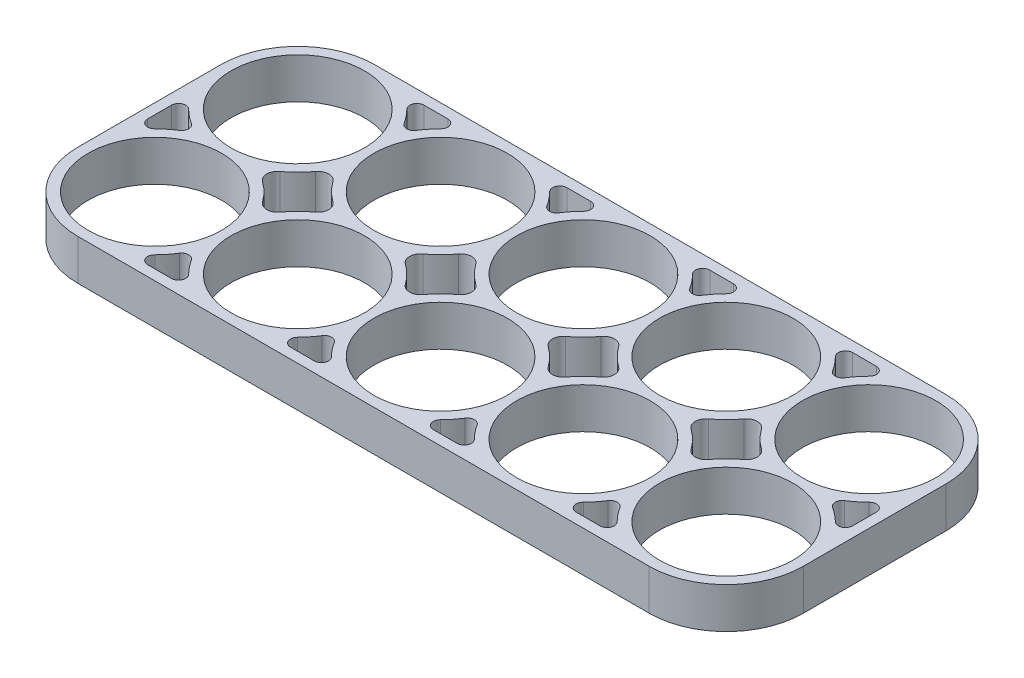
ISO-10303-21;
HEADER;
FILE_DESCRIPTION(('STEP AP214'),'2;1');
FILE_NAME('part.step','',(''),(''),'','','');
FILE_SCHEMA(('AUTOMOTIVE_DESIGN { 1 0 10303 214 1 1 1 1 }'));
ENDSEC;
DATA;
#1=APPLICATION_CONTEXT('core data for automotive mechanical design processes');
#2=APPLICATION_PROTOCOL_DEFINITION('international standard','automotive_design',2000,#1);
#3=PRODUCT_CONTEXT('',#1,'mechanical');
#4=PRODUCT('Part','Part','',(#3));
#5=PRODUCT_RELATED_PRODUCT_CATEGORY('part','',(#4));
#6=PRODUCT_DEFINITION_FORMATION('','',#4);
#7=PRODUCT_DEFINITION_CONTEXT('part definition',#1,'design');
#8=PRODUCT_DEFINITION('design','',#6,#7);
#9=PRODUCT_DEFINITION_SHAPE('','',#8);
#10=(LENGTH_UNIT() NAMED_UNIT(*) SI_UNIT(.MILLI.,.METRE.));
#11=(NAMED_UNIT(*) PLANE_ANGLE_UNIT() SI_UNIT($,.RADIAN.));
#12=(NAMED_UNIT(*) SI_UNIT($,.STERADIAN.) SOLID_ANGLE_UNIT());
#13=UNCERTAINTY_MEASURE_WITH_UNIT(LENGTH_MEASURE(1.E-05),#10,'distance_accuracy_value','');
#14=(GEOMETRIC_REPRESENTATION_CONTEXT(3) GLOBAL_UNCERTAINTY_ASSIGNED_CONTEXT((#13)) GLOBAL_UNIT_ASSIGNED_CONTEXT((#10,
#11,#12)) REPRESENTATION_CONTEXT('',''));
#15=CARTESIAN_POINT('',(0.,0.,0.));
#16=DIRECTION('',(0.,0.,1.));
#17=DIRECTION('',(1.,0.,0.));
#18=AXIS2_PLACEMENT_3D('',#15,#16,#17);
#19=CARTESIAN_POINT('',(-40.,5.7,-10.));
#20=DIRECTION('',(0.,1.,0.));
#21=DIRECTION('',(0.,0.,1.));
#22=AXIS2_PLACEMENT_3D('',#19,#20,#21);
#23=PLANE('',#22);
#24=CARTESIAN_POINT('',(-20.,5.7,10.));
#25=DIRECTION('',(0.,1.,0.));
#26=DIRECTION('',(0.,0.,1.));
#27=AXIS2_PLACEMENT_3D('',#24,#25,#26);
#28=CIRCLE('',#27,9.35);
#29=CARTESIAN_POINT('',(-20.,5.7,19.35));
#30=VERTEX_POINT('',#29);
#31=EDGE_CURVE('E1356',#30,#30,#28,.T.);
#32=ORIENTED_EDGE('',*,*,#31,.F.);
#33=EDGE_LOOP('',(#32));
#34=FACE_BOUND('',#33,.T.);
#35=CARTESIAN_POINT('',(20.,5.7,10.));
#36=DIRECTION('',(0.,1.,0.));
#37=DIRECTION('',(0.,0.,1.));
#38=AXIS2_PLACEMENT_3D('',#35,#36,#37);
#39=CIRCLE('',#38,9.35);
#40=CARTESIAN_POINT('',(20.,5.7,19.35));
#41=VERTEX_POINT('',#40);
#42=EDGE_CURVE('E1368',#41,#41,#39,.T.);
#43=ORIENTED_EDGE('',*,*,#42,.F.);
#44=EDGE_LOOP('',(#43));
#45=FACE_BOUND('',#44,.T.);
#46=CARTESIAN_POINT('',(40.,5.7,-10.));
#47=DIRECTION('',(0.,1.,0.));
#48=DIRECTION('',(0.,0.,1.));
#49=AXIS2_PLACEMENT_3D('',#46,#47,#48);
#50=CIRCLE('',#49,9.35);
#51=CARTESIAN_POINT('',(40.,5.7,-0.649999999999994));
#52=VERTEX_POINT('',#51);
#53=EDGE_CURVE('E1380',#52,#52,#50,.T.);
#54=ORIENTED_EDGE('',*,*,#53,.F.);
#55=EDGE_LOOP('',(#54));
#56=FACE_BOUND('',#55,.T.);
#57=CARTESIAN_POINT('',(0.,5.7,-10.));
#58=DIRECTION('',(0.,1.,0.));
#59=DIRECTION('',(0.,0.,1.));
#60=AXIS2_PLACEMENT_3D('',#57,#58,#59);
#61=CIRCLE('',#60,9.35);
#62=CARTESIAN_POINT('',(0.,5.7,-0.649999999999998));
#63=VERTEX_POINT('',#62);
#64=EDGE_CURVE('E1392',#63,#63,#61,.T.);
#65=ORIENTED_EDGE('',*,*,#64,.F.);
#66=EDGE_LOOP('',(#65));
#67=FACE_BOUND('',#66,.T.);
#68=CARTESIAN_POINT('',(-40.,5.7,-10.));
#69=DIRECTION('',(0.,1.,0.));
#70=DIRECTION('',(0.,0.,1.));
#71=AXIS2_PLACEMENT_3D('',#68,#69,#70);
#72=CIRCLE('',#71,9.35);
#73=CARTESIAN_POINT('',(-40.,5.7,-0.650000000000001));
#74=VERTEX_POINT('',#73);
#75=EDGE_CURVE('E1404',#74,#74,#72,.T.);
#76=ORIENTED_EDGE('',*,*,#75,.F.);
#77=EDGE_LOOP('',(#76));
#78=FACE_BOUND('',#77,.T.);
#79=CARTESIAN_POINT('',(-40.,5.7,-10.));
#80=DIRECTION('',(0.,1.,0.));
#81=DIRECTION('',(0.,0.,1.));
#82=AXIS2_PLACEMENT_3D('',#79,#80,#81);
#83=CIRCLE('',#82,10.8);
#84=CARTESIAN_POINT('',(-40.,5.7,-20.8));
#85=VERTEX_POINT('',#84);
#86=CARTESIAN_POINT('',(-50.8,5.7,-9.99999999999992));
#87=VERTEX_POINT('',#86);
#88=EDGE_CURVE('E1410',#85,#87,#83,.T.);
#89=ORIENTED_EDGE('',*,*,#88,.T.);
#90=DIRECTION('',(0.,0.,1.));
#91=VECTOR('',#90,1.);
#92=CARTESIAN_POINT('',(-50.8,5.7,-9.99999999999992));
#93=LINE('',#92,#91);
#94=CARTESIAN_POINT('',(-50.8,5.7,10.0000000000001));
#95=VERTEX_POINT('',#94);
#96=EDGE_CURVE('E1413',#87,#95,#93,.T.);
#97=ORIENTED_EDGE('',*,*,#96,.T.);
#98=CARTESIAN_POINT('',(-40.,5.7,10.));
#99=DIRECTION('',(0.,1.,0.));
#100=DIRECTION('',(0.,0.,1.));
#101=AXIS2_PLACEMENT_3D('',#98,#99,#100);
#102=CIRCLE('',#101,10.8);
#103=CARTESIAN_POINT('',(-39.9999999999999,5.7,20.8));
#104=VERTEX_POINT('',#103);
#105=EDGE_CURVE('E1416',#95,#104,#102,.T.);
#106=ORIENTED_EDGE('',*,*,#105,.T.);
#107=DIRECTION('',(1.,0.,0.));
#108=VECTOR('',#107,1.);
#109=CARTESIAN_POINT('',(-39.9999999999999,5.7,20.8));
#110=LINE('',#109,#108);
#111=CARTESIAN_POINT('',(40.0000000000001,5.7,20.8));
#112=VERTEX_POINT('',#111);
#113=EDGE_CURVE('E1418',#104,#112,#110,.T.);
#114=ORIENTED_EDGE('',*,*,#113,.T.);
#115=CARTESIAN_POINT('',(40.,5.7,10.));
#116=DIRECTION('',(0.,1.,0.));
#117=DIRECTION('',(0.,0.,1.));
#118=AXIS2_PLACEMENT_3D('',#115,#116,#117);
#119=CIRCLE('',#118,10.8);
#120=CARTESIAN_POINT('',(50.8,5.7,10.));
#121=VERTEX_POINT('',#120);
#122=EDGE_CURVE('E1420',#112,#121,#119,.T.);
#123=ORIENTED_EDGE('',*,*,#122,.T.);
#124=DIRECTION('',(0.,0.,-1.));
#125=VECTOR('',#124,1.);
#126=CARTESIAN_POINT('',(50.8,5.7,-10.));
#127=LINE('',#126,#125);
#128=CARTESIAN_POINT('',(50.8,5.7,-10.));
#129=VERTEX_POINT('',#128);
#130=EDGE_CURVE('E1422',#121,#129,#127,.T.);
#131=ORIENTED_EDGE('',*,*,#130,.T.);
#132=CARTESIAN_POINT('',(40.,5.7,-10.));
#133=DIRECTION('',(0.,1.,0.));
#134=DIRECTION('',(0.,0.,1.));
#135=AXIS2_PLACEMENT_3D('',#132,#133,#134);
#136=CIRCLE('',#135,10.8);
#137=CARTESIAN_POINT('',(40.,5.7,-20.8));
#138=VERTEX_POINT('',#137);
#139=EDGE_CURVE('E1424',#129,#138,#136,.T.);
#140=ORIENTED_EDGE('',*,*,#139,.T.);
#141=DIRECTION('',(-1.,0.,0.));
#142=VECTOR('',#141,1.);
#143=CARTESIAN_POINT('',(-40.,5.7,-20.8));
#144=LINE('',#143,#142);
#145=EDGE_CURVE('E1426',#138,#85,#144,.T.);
#146=ORIENTED_EDGE('',*,*,#145,.T.);
#147=EDGE_LOOP('',(#89,#97,#106,#114,#123,#131,#140,#146));
#148=FACE_BOUND('',#147,.T.);
#149=CARTESIAN_POINT('',(-20.,5.7,-10.));
#150=DIRECTION('',(0.,1.,0.));
#151=DIRECTION('',(0.,0.,1.));
#152=AXIS2_PLACEMENT_3D('',#149,#150,#151);
#153=CIRCLE('',#152,9.35);
#154=CARTESIAN_POINT('',(-20.,5.7,-0.649999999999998));
#155=VERTEX_POINT('',#154);
#156=EDGE_CURVE('E1398',#155,#155,#153,.T.);
#157=ORIENTED_EDGE('',*,*,#156,.F.);
#158=EDGE_LOOP('',(#157));
#159=FACE_BOUND('',#158,.T.);
#160=CARTESIAN_POINT('',(20.,5.7,-10.));
#161=DIRECTION('',(0.,1.,0.));
#162=DIRECTION('',(0.,0.,1.));
#163=AXIS2_PLACEMENT_3D('',#160,#161,#162);
#164=CIRCLE('',#163,9.35);
#165=CARTESIAN_POINT('',(20.,5.7,-0.649999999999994));
#166=VERTEX_POINT('',#165);
#167=EDGE_CURVE('E1386',#166,#166,#164,.T.);
#168=ORIENTED_EDGE('',*,*,#167,.F.);
#169=EDGE_LOOP('',(#168));
#170=FACE_BOUND('',#169,.T.);
#171=CARTESIAN_POINT('',(40.,5.7,10.));
#172=DIRECTION('',(0.,1.,0.));
#173=DIRECTION('',(0.,0.,1.));
#174=AXIS2_PLACEMENT_3D('',#171,#172,#173);
#175=CIRCLE('',#174,9.35);
#176=CARTESIAN_POINT('',(40.,5.7,19.35));
#177=VERTEX_POINT('',#176);
#178=EDGE_CURVE('E1374',#177,#177,#175,.T.);
#179=ORIENTED_EDGE('',*,*,#178,.F.);
#180=EDGE_LOOP('',(#179));
#181=FACE_BOUND('',#180,.T.);
#182=CARTESIAN_POINT('',(0.,5.7,10.));
#183=DIRECTION('',(0.,1.,0.));
#184=DIRECTION('',(0.,0.,1.));
#185=AXIS2_PLACEMENT_3D('',#182,#183,#184);
#186=CIRCLE('',#185,9.35);
#187=CARTESIAN_POINT('',(0.,5.7,19.35));
#188=VERTEX_POINT('',#187);
#189=EDGE_CURVE('E1362',#188,#188,#186,.T.);
#190=ORIENTED_EDGE('',*,*,#189,.F.);
#191=EDGE_LOOP('',(#190));
#192=FACE_BOUND('',#191,.T.);
#193=CARTESIAN_POINT('',(-40.,5.7,10.));
#194=DIRECTION('',(0.,1.,0.));
#195=DIRECTION('',(0.,0.,1.));
#196=AXIS2_PLACEMENT_3D('',#193,#194,#195);
#197=CIRCLE('',#196,9.35);
#198=CARTESIAN_POINT('',(-40.,5.7,19.35));
#199=VERTEX_POINT('',#198);
#200=EDGE_CURVE('E1350',#199,#199,#197,.T.);
#201=ORIENTED_EDGE('',*,*,#200,.F.);
#202=EDGE_LOOP('',(#201));
#203=FACE_BOUND('',#202,.T.);
#204=CARTESIAN_POINT('',(40.,5.7,10.));
#205=DIRECTION('',(0.,-1.,0.));
#206=DIRECTION('',(0.,0.,1.));
#207=AXIS2_PLACEMENT_3D('',#204,#205,#206);
#208=CIRCLE('',#207,10.8);
#209=CARTESIAN_POINT('',(45.7333208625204,5.7,0.847457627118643));
#210=VERTEX_POINT('',#209);
#211=CARTESIAN_POINT('',(47.6423728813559,5.7,2.36887054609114));
#212=VERTEX_POINT('',#211);
#213=EDGE_CURVE('E1307',#210,#212,#208,.T.);
#214=ORIENTED_EDGE('',*,*,#213,.F.);
#215=CARTESIAN_POINT('',(46.2641839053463,5.7,0.));
#216=DIRECTION('',(0.,1.,0.));
#217=DIRECTION('',(0.,0.,-1.));
#218=AXIS2_PLACEMENT_3D('',#215,#216,#217);
#219=CIRCLE('',#218,0.999999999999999);
#220=CARTESIAN_POINT('',(45.7333208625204,5.7,-0.847457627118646));
#221=VERTEX_POINT('',#220);
#222=EDGE_CURVE('E1305',#221,#210,#219,.T.);
#223=ORIENTED_EDGE('',*,*,#222,.F.);
#224=CARTESIAN_POINT('',(40.,5.7,-10.));
#225=DIRECTION('',(0.,-1.,0.));
#226=DIRECTION('',(0.,0.,1.));
#227=AXIS2_PLACEMENT_3D('',#224,#225,#226);
#228=CIRCLE('',#227,10.8);
#229=CARTESIAN_POINT('',(47.6423728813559,5.7,-2.36887054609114));
#230=VERTEX_POINT('',#229);
#231=EDGE_CURVE('E1317',#230,#221,#228,.T.);
#232=ORIENTED_EDGE('',*,*,#231,.F.);
#233=CARTESIAN_POINT('',(48.35,5.7,-1.66228448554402));
#234=DIRECTION('',(0.,1.,0.));
#235=DIRECTION('',(0.,0.,1.));
#236=AXIS2_PLACEMENT_3D('',#233,#234,#235);
#237=CIRCLE('',#236,1.);
#238=CARTESIAN_POINT('',(49.35,5.7,-1.66228448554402));
#239=VERTEX_POINT('',#238);
#240=EDGE_CURVE('E1314',#239,#230,#237,.T.);
#241=ORIENTED_EDGE('',*,*,#240,.F.);
#242=DIRECTION('',(0.,0.,-1.));
#243=VECTOR('',#242,1.);
#244=CARTESIAN_POINT('',(49.35,5.7,-1.66228448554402));
#245=LINE('',#244,#243);
#246=CARTESIAN_POINT('',(49.35,5.7,1.66228448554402));
#247=VERTEX_POINT('',#246);
#248=EDGE_CURVE('E1312',#247,#239,#245,.T.);
#249=ORIENTED_EDGE('',*,*,#248,.F.);
#250=CARTESIAN_POINT('',(48.35,5.7,1.66228448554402));
#251=DIRECTION('',(0.,1.,0.));
#252=DIRECTION('',(0.,0.,1.));
#253=AXIS2_PLACEMENT_3D('',#250,#251,#252);
#254=CIRCLE('',#253,1.);
#255=EDGE_CURVE('E1310',#212,#247,#254,.T.);
#256=ORIENTED_EDGE('',*,*,#255,.F.);
#257=EDGE_LOOP('',(#214,#223,#232,#241,#249,#256));
#258=FACE_BOUND('',#257,.T.);
#259=CARTESIAN_POINT('',(-40.,5.7,10.));
#260=DIRECTION('',(0.,-1.,0.));
#261=DIRECTION('',(0.,0.,1.));
#262=AXIS2_PLACEMENT_3D('',#259,#260,#261);
#263=CIRCLE('',#262,10.8);
#264=CARTESIAN_POINT('',(-47.6423728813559,5.7,2.36887054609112));
#265=VERTEX_POINT('',#264);
#266=CARTESIAN_POINT('',(-45.7333208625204,5.7,0.847457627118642));
#267=VERTEX_POINT('',#266);
#268=EDGE_CURVE('E1262',#265,#267,#263,.T.);
#269=ORIENTED_EDGE('',*,*,#268,.F.);
#270=CARTESIAN_POINT('',(-48.35,5.7,1.66228448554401));
#271=DIRECTION('',(0.,1.,0.));
#272=DIRECTION('',(0.,0.,1.));
#273=AXIS2_PLACEMENT_3D('',#270,#271,#272);
#274=CIRCLE('',#273,1.);
#275=CARTESIAN_POINT('',(-49.35,5.7,1.66228448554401));
#276=VERTEX_POINT('',#275);
#277=EDGE_CURVE('E1260',#276,#265,#274,.T.);
#278=ORIENTED_EDGE('',*,*,#277,.F.);
#279=DIRECTION('',(0.,0.,1.));
#280=VECTOR('',#279,1.);
#281=CARTESIAN_POINT('',(-49.35,5.7,-1.66228448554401));
#282=LINE('',#281,#280);
#283=CARTESIAN_POINT('',(-49.35,5.7,-1.66228448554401));
#284=VERTEX_POINT('',#283);
#285=EDGE_CURVE('E1272',#284,#276,#282,.T.);
#286=ORIENTED_EDGE('',*,*,#285,.F.);
#287=CARTESIAN_POINT('',(-48.35,5.7,-1.66228448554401));
#288=DIRECTION('',(0.,1.,0.));
#289=DIRECTION('',(0.,0.,1.));
#290=AXIS2_PLACEMENT_3D('',#287,#288,#289);
#291=CIRCLE('',#290,1.);
#292=CARTESIAN_POINT('',(-47.6423728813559,5.7,-2.36887054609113));
#293=VERTEX_POINT('',#292);
#294=EDGE_CURVE('E1269',#293,#284,#291,.T.);
#295=ORIENTED_EDGE('',*,*,#294,.F.);
#296=CARTESIAN_POINT('',(-40.,5.7,-10.));
#297=DIRECTION('',(0.,-1.,0.));
#298=DIRECTION('',(0.,0.,1.));
#299=AXIS2_PLACEMENT_3D('',#296,#297,#298);
#300=CIRCLE('',#299,10.8);
#301=CARTESIAN_POINT('',(-45.7333208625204,5.7,-0.847457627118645));
#302=VERTEX_POINT('',#301);
#303=EDGE_CURVE('E1267',#302,#293,#300,.T.);
#304=ORIENTED_EDGE('',*,*,#303,.F.);
#305=CARTESIAN_POINT('',(-46.2641839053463,5.7,0.));
#306=DIRECTION('',(0.,1.,0.));
#307=DIRECTION('',(0.,0.,1.));
#308=AXIS2_PLACEMENT_3D('',#305,#306,#307);
#309=CIRCLE('',#308,0.999999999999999);
#310=EDGE_CURVE('E1265',#267,#302,#309,.T.);
#311=ORIENTED_EDGE('',*,*,#310,.F.);
#312=EDGE_LOOP('',(#269,#278,#286,#295,#304,#311));
#313=FACE_BOUND('',#312,.T.);
#314=CARTESIAN_POINT('',(0.,5.7,10.));
#315=DIRECTION('',(0.,-1.,0.));
#316=DIRECTION('',(0.,0.,1.));
#317=AXIS2_PLACEMENT_3D('',#314,#315,#316);
#318=CIRCLE('',#317,10.8);
#319=CARTESIAN_POINT('',(-7.63112945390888,5.7,17.6423728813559));
#320=VERTEX_POINT('',#319);
#321=CARTESIAN_POINT('',(-9.15254237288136,5.7,15.7333208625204));
#322=VERTEX_POINT('',#321);
#323=EDGE_CURVE('E1217',#320,#322,#318,.T.);
#324=ORIENTED_EDGE('',*,*,#323,.F.);
#325=CARTESIAN_POINT('',(-8.33771551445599,5.7,18.35));
#326=DIRECTION('',(0.,1.,0.));
#327=DIRECTION('',(0.,0.,1.));
#328=AXIS2_PLACEMENT_3D('',#325,#326,#327);
#329=CIRCLE('',#328,1.);
#330=CARTESIAN_POINT('',(-8.33771551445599,5.7,19.35));
#331=VERTEX_POINT('',#330);
#332=EDGE_CURVE('E1215',#331,#320,#329,.T.);
#333=ORIENTED_EDGE('',*,*,#332,.F.);
#334=DIRECTION('',(1.,0.,0.));
#335=VECTOR('',#334,1.);
#336=CARTESIAN_POINT('',(-11.662284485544,5.7,19.35));
#337=LINE('',#336,#335);
#338=CARTESIAN_POINT('',(-11.662284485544,5.7,19.35));
#339=VERTEX_POINT('',#338);
#340=EDGE_CURVE('E1227',#339,#331,#337,.T.);
#341=ORIENTED_EDGE('',*,*,#340,.F.);
#342=CARTESIAN_POINT('',(-11.662284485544,5.7,18.35));
#343=DIRECTION('',(0.,1.,0.));
#344=DIRECTION('',(0.,0.,-1.));
#345=AXIS2_PLACEMENT_3D('',#342,#343,#344);
#346=CIRCLE('',#345,1.);
#347=CARTESIAN_POINT('',(-12.3688705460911,5.7,17.6423728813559));
#348=VERTEX_POINT('',#347);
#349=EDGE_CURVE('E1224',#348,#339,#346,.T.);
#350=ORIENTED_EDGE('',*,*,#349,.F.);
#351=CARTESIAN_POINT('',(-20.,5.7,10.));
#352=DIRECTION('',(0.,-1.,0.));
#353=DIRECTION('',(0.,0.,1.));
#354=AXIS2_PLACEMENT_3D('',#351,#352,#353);
#355=CIRCLE('',#354,10.8);
#356=CARTESIAN_POINT('',(-10.8474576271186,5.7,15.7333208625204));
#357=VERTEX_POINT('',#356);
#358=EDGE_CURVE('E1222',#357,#348,#355,.T.);
#359=ORIENTED_EDGE('',*,*,#358,.F.);
#360=CARTESIAN_POINT('',(-10.,5.7,16.2641839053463));
#361=DIRECTION('',(0.,1.,0.));
#362=DIRECTION('',(0.,0.,1.));
#363=AXIS2_PLACEMENT_3D('',#360,#361,#362);
#364=CIRCLE('',#363,0.999999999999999);
#365=EDGE_CURVE('E1220',#322,#357,#364,.T.);
#366=ORIENTED_EDGE('',*,*,#365,.F.);
#367=EDGE_LOOP('',(#324,#333,#341,#350,#359,#366));
#368=FACE_BOUND('',#367,.T.);
#369=CARTESIAN_POINT('',(-40.,5.7,10.));
#370=DIRECTION('',(0.,-1.,0.));
#371=DIRECTION('',(0.,0.,1.));
#372=AXIS2_PLACEMENT_3D('',#369,#370,#371);
#373=CIRCLE('',#372,10.8);
#374=CARTESIAN_POINT('',(-30.8474576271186,5.7,15.7333208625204));
#375=VERTEX_POINT('',#374);
#376=CARTESIAN_POINT('',(-32.3688705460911,5.7,17.6423728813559));
#377=VERTEX_POINT('',#376);
#378=EDGE_CURVE('E1172',#375,#377,#373,.T.);
#379=ORIENTED_EDGE('',*,*,#378,.F.);
#380=CARTESIAN_POINT('',(-30.,5.7,16.2641839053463));
#381=DIRECTION('',(0.,1.,0.));
#382=DIRECTION('',(0.,0.,1.));
#383=AXIS2_PLACEMENT_3D('',#380,#381,#382);
#384=CIRCLE('',#383,1.);
#385=CARTESIAN_POINT('',(-29.1525423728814,5.7,15.7333208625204));
#386=VERTEX_POINT('',#385);
#387=EDGE_CURVE('E1170',#386,#375,#384,.T.);
#388=ORIENTED_EDGE('',*,*,#387,.F.);
#389=CARTESIAN_POINT('',(-20.,5.7,10.));
#390=DIRECTION('',(0.,-1.,0.));
#391=DIRECTION('',(0.,0.,1.));
#392=AXIS2_PLACEMENT_3D('',#389,#390,#391);
#393=CIRCLE('',#392,10.8);
#394=CARTESIAN_POINT('',(-27.6311294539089,5.7,17.6423728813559));
#395=VERTEX_POINT('',#394);
#396=EDGE_CURVE('E1182',#395,#386,#393,.T.);
#397=ORIENTED_EDGE('',*,*,#396,.F.);
#398=CARTESIAN_POINT('',(-28.337715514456,5.7,18.35));
#399=DIRECTION('',(0.,1.,0.));
#400=DIRECTION('',(0.,0.,1.));
#401=AXIS2_PLACEMENT_3D('',#398,#399,#400);
#402=CIRCLE('',#401,1.);
#403=CARTESIAN_POINT('',(-28.337715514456,5.7,19.35));
#404=VERTEX_POINT('',#403);
#405=EDGE_CURVE('E1179',#404,#395,#402,.T.);
#406=ORIENTED_EDGE('',*,*,#405,.F.);
#407=DIRECTION('',(1.,0.,0.));
#408=VECTOR('',#407,1.);
#409=CARTESIAN_POINT('',(-31.662284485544,5.7,19.35));
#410=LINE('',#409,#408);
#411=CARTESIAN_POINT('',(-31.662284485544,5.7,19.35));
#412=VERTEX_POINT('',#411);
#413=EDGE_CURVE('E1177',#412,#404,#410,.T.);
#414=ORIENTED_EDGE('',*,*,#413,.F.);
#415=CARTESIAN_POINT('',(-31.662284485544,5.7,18.35));
#416=DIRECTION('',(0.,1.,0.));
#417=DIRECTION('',(0.,0.,-1.));
#418=AXIS2_PLACEMENT_3D('',#415,#416,#417);
#419=CIRCLE('',#418,1.);
#420=EDGE_CURVE('E1175',#377,#412,#419,.T.);
#421=ORIENTED_EDGE('',*,*,#420,.F.);
#422=EDGE_LOOP('',(#379,#388,#397,#406,#414,#421));
#423=FACE_BOUND('',#422,.T.);
#424=DIRECTION('',(1.,0.,0.));
#425=VECTOR('',#424,1.);
#426=CARTESIAN_POINT('',(28.337715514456,5.7,19.35));
#427=LINE('',#426,#425);
#428=CARTESIAN_POINT('',(28.337715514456,5.7,19.35));
#429=VERTEX_POINT('',#428);
#430=CARTESIAN_POINT('',(31.662284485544,5.7,19.35));
#431=VERTEX_POINT('',#430);
#432=EDGE_CURVE('E1127',#429,#431,#427,.T.);
#433=ORIENTED_EDGE('',*,*,#432,.F.);
#434=CARTESIAN_POINT('',(28.337715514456,5.7,18.35));
#435=DIRECTION('',(0.,1.,0.));
#436=DIRECTION('',(0.,0.,-1.));
#437=AXIS2_PLACEMENT_3D('',#434,#435,#436);
#438=CIRCLE('',#437,0.999999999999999);
#439=CARTESIAN_POINT('',(27.6311294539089,5.7,17.6423728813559));
#440=VERTEX_POINT('',#439);
#441=EDGE_CURVE('E1125',#440,#429,#438,.T.);
#442=ORIENTED_EDGE('',*,*,#441,.F.);
#443=CARTESIAN_POINT('',(20.,5.7,10.));
#444=DIRECTION('',(0.,-1.,0.));
#445=DIRECTION('',(0.,0.,1.));
#446=AXIS2_PLACEMENT_3D('',#443,#444,#445);
#447=CIRCLE('',#446,10.8);
#448=CARTESIAN_POINT('',(29.1525423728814,5.7,15.7333208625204));
#449=VERTEX_POINT('',#448);
#450=EDGE_CURVE('E1137',#449,#440,#447,.T.);
#451=ORIENTED_EDGE('',*,*,#450,.F.);
#452=CARTESIAN_POINT('',(30.,5.7,16.2641839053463));
#453=DIRECTION('',(0.,1.,0.));
#454=DIRECTION('',(0.,0.,-1.));
#455=AXIS2_PLACEMENT_3D('',#452,#453,#454);
#456=CIRCLE('',#455,1.);
#457=CARTESIAN_POINT('',(30.8474576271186,5.7,15.7333208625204));
#458=VERTEX_POINT('',#457);
#459=EDGE_CURVE('E1134',#458,#449,#456,.T.);
#460=ORIENTED_EDGE('',*,*,#459,.F.);
#461=CARTESIAN_POINT('',(40.,5.7,10.));
#462=DIRECTION('',(0.,-1.,0.));
#463=DIRECTION('',(0.,0.,1.));
#464=AXIS2_PLACEMENT_3D('',#461,#462,#463);
#465=CIRCLE('',#464,10.8);
#466=CARTESIAN_POINT('',(32.3688705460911,5.7,17.6423728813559));
#467=VERTEX_POINT('',#466);
#468=EDGE_CURVE('E1132',#467,#458,#465,.T.);
#469=ORIENTED_EDGE('',*,*,#468,.F.);
#470=CARTESIAN_POINT('',(31.662284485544,5.7,18.35));
#471=DIRECTION('',(0.,1.,0.));
#472=DIRECTION('',(0.,0.,1.));
#473=AXIS2_PLACEMENT_3D('',#470,#471,#472);
#474=CIRCLE('',#473,1.);
#475=EDGE_CURVE('E1130',#431,#467,#474,.T.);
#476=ORIENTED_EDGE('',*,*,#475,.F.);
#477=EDGE_LOOP('',(#433,#442,#451,#460,#469,#476));
#478=FACE_BOUND('',#477,.T.);
#479=DIRECTION('',(1.,0.,0.));
#480=VECTOR('',#479,1.);
#481=CARTESIAN_POINT('',(8.33771551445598,5.7,19.35));
#482=LINE('',#481,#480);
#483=CARTESIAN_POINT('',(8.33771551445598,5.7,19.35));
#484=VERTEX_POINT('',#483);
#485=CARTESIAN_POINT('',(11.662284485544,5.7,19.35));
#486=VERTEX_POINT('',#485);
#487=EDGE_CURVE('E1082',#484,#486,#482,.T.);
#488=ORIENTED_EDGE('',*,*,#487,.F.);
#489=CARTESIAN_POINT('',(8.33771551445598,5.7,18.35));
#490=DIRECTION('',(0.,1.,0.));
#491=DIRECTION('',(0.,0.,-1.));
#492=AXIS2_PLACEMENT_3D('',#489,#490,#491);
#493=CIRCLE('',#492,0.999999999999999);
#494=CARTESIAN_POINT('',(7.63112945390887,5.7,17.6423728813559));
#495=VERTEX_POINT('',#494);
#496=EDGE_CURVE('E1080',#495,#484,#493,.T.);
#497=ORIENTED_EDGE('',*,*,#496,.F.);
#498=CARTESIAN_POINT('',(0.,5.7,10.));
#499=DIRECTION('',(0.,-1.,0.));
#500=DIRECTION('',(0.,0.,1.));
#501=AXIS2_PLACEMENT_3D('',#498,#499,#500);
#502=CIRCLE('',#501,10.8);
#503=CARTESIAN_POINT('',(9.15254237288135,5.7,15.7333208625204));
#504=VERTEX_POINT('',#503);
#505=EDGE_CURVE('E1092',#504,#495,#502,.T.);
#506=ORIENTED_EDGE('',*,*,#505,.F.);
#507=CARTESIAN_POINT('',(10.,5.7,16.2641839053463));
#508=DIRECTION('',(0.,1.,0.));
#509=DIRECTION('',(0.,0.,-1.));
#510=AXIS2_PLACEMENT_3D('',#507,#508,#509);
#511=CIRCLE('',#510,0.999999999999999);
#512=CARTESIAN_POINT('',(10.8474576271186,5.7,15.7333208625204));
#513=VERTEX_POINT('',#512);
#514=EDGE_CURVE('E1089',#513,#504,#511,.T.);
#515=ORIENTED_EDGE('',*,*,#514,.F.);
#516=CARTESIAN_POINT('',(20.,5.7,10.));
#517=DIRECTION('',(0.,-1.,0.));
#518=DIRECTION('',(0.,0.,1.));
#519=AXIS2_PLACEMENT_3D('',#516,#517,#518);
#520=CIRCLE('',#519,10.8);
#521=CARTESIAN_POINT('',(12.3688705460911,5.7,17.6423728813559));
#522=VERTEX_POINT('',#521);
#523=EDGE_CURVE('E1087',#522,#513,#520,.T.);
#524=ORIENTED_EDGE('',*,*,#523,.F.);
#525=CARTESIAN_POINT('',(11.662284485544,5.7,18.35));
#526=DIRECTION('',(0.,1.,0.));
#527=DIRECTION('',(0.,0.,1.));
#528=AXIS2_PLACEMENT_3D('',#525,#526,#527);
#529=CIRCLE('',#528,1.);
#530=EDGE_CURVE('E1085',#486,#522,#529,.T.);
#531=ORIENTED_EDGE('',*,*,#530,.F.);
#532=EDGE_LOOP('',(#488,#497,#506,#515,#524,#531));
#533=FACE_BOUND('',#532,.T.);
#534=CARTESIAN_POINT('',(40.,5.7,-10.));
#535=DIRECTION('',(0.,-1.,0.));
#536=DIRECTION('',(0.,0.,1.));
#537=AXIS2_PLACEMENT_3D('',#534,#535,#536);
#538=CIRCLE('',#537,10.8);
#539=CARTESIAN_POINT('',(30.8474576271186,5.7,-15.7333208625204));
#540=VERTEX_POINT('',#539);
#541=CARTESIAN_POINT('',(32.3688705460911,5.7,-17.6423728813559));
#542=VERTEX_POINT('',#541);
#543=EDGE_CURVE('E1037',#540,#542,#538,.T.);
#544=ORIENTED_EDGE('',*,*,#543,.F.);
#545=CARTESIAN_POINT('',(30.,5.7,-16.2641839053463));
#546=DIRECTION('',(0.,1.,0.));
#547=DIRECTION('',(0.,0.,1.));
#548=AXIS2_PLACEMENT_3D('',#545,#546,#547);
#549=CIRCLE('',#548,1.);
#550=CARTESIAN_POINT('',(29.1525423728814,5.7,-15.7333208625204));
#551=VERTEX_POINT('',#550);
#552=EDGE_CURVE('E1035',#551,#540,#549,.T.);
#553=ORIENTED_EDGE('',*,*,#552,.F.);
#554=CARTESIAN_POINT('',(20.,5.7,-10.));
#555=DIRECTION('',(0.,-1.,0.));
#556=DIRECTION('',(0.,0.,1.));
#557=AXIS2_PLACEMENT_3D('',#554,#555,#556);
#558=CIRCLE('',#557,10.8);
#559=CARTESIAN_POINT('',(27.6311294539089,5.7,-17.6423728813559));
#560=VERTEX_POINT('',#559);
#561=EDGE_CURVE('E1047',#560,#551,#558,.T.);
#562=ORIENTED_EDGE('',*,*,#561,.F.);
#563=CARTESIAN_POINT('',(28.337715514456,5.7,-18.35));
#564=DIRECTION('',(0.,1.,0.));
#565=DIRECTION('',(0.,0.,-1.));
#566=AXIS2_PLACEMENT_3D('',#563,#564,#565);
#567=CIRCLE('',#566,1.);
#568=CARTESIAN_POINT('',(28.337715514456,5.7,-19.35));
#569=VERTEX_POINT('',#568);
#570=EDGE_CURVE('E1044',#569,#560,#567,.T.);
#571=ORIENTED_EDGE('',*,*,#570,.F.);
#572=DIRECTION('',(-1.,0.,0.));
#573=VECTOR('',#572,1.);
#574=CARTESIAN_POINT('',(28.337715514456,5.7,-19.35));
#575=LINE('',#574,#573);
#576=CARTESIAN_POINT('',(31.662284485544,5.7,-19.35));
#577=VERTEX_POINT('',#576);
#578=EDGE_CURVE('E1042',#577,#569,#575,.T.);
#579=ORIENTED_EDGE('',*,*,#578,.F.);
#580=CARTESIAN_POINT('',(31.662284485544,5.7,-18.35));
#581=DIRECTION('',(0.,1.,0.));
#582=DIRECTION('',(0.,0.,1.));
#583=AXIS2_PLACEMENT_3D('',#580,#581,#582);
#584=CIRCLE('',#583,1.);
#585=EDGE_CURVE('E1040',#542,#577,#584,.T.);
#586=ORIENTED_EDGE('',*,*,#585,.F.);
#587=EDGE_LOOP('',(#544,#553,#562,#571,#579,#586));
#588=FACE_BOUND('',#587,.T.);
#589=CARTESIAN_POINT('',(20.,5.7,-10.));
#590=DIRECTION('',(0.,-1.,0.));
#591=DIRECTION('',(0.,0.,1.));
#592=AXIS2_PLACEMENT_3D('',#589,#590,#591);
#593=CIRCLE('',#592,10.8);
#594=CARTESIAN_POINT('',(10.8474576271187,5.7,-15.7333208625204));
#595=VERTEX_POINT('',#594);
#596=CARTESIAN_POINT('',(12.3688705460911,5.7,-17.6423728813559));
#597=VERTEX_POINT('',#596);
#598=EDGE_CURVE('E992',#595,#597,#593,.T.);
#599=ORIENTED_EDGE('',*,*,#598,.F.);
#600=CARTESIAN_POINT('',(10.,5.7,-16.2641839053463));
#601=DIRECTION('',(0.,1.,0.));
#602=DIRECTION('',(0.,0.,1.));
#603=AXIS2_PLACEMENT_3D('',#600,#601,#602);
#604=CIRCLE('',#603,1.);
#605=CARTESIAN_POINT('',(9.15254237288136,5.7,-15.7333208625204));
#606=VERTEX_POINT('',#605);
#607=EDGE_CURVE('E990',#606,#595,#604,.T.);
#608=ORIENTED_EDGE('',*,*,#607,.F.);
#609=CARTESIAN_POINT('',(0.,5.7,-10.));
#610=DIRECTION('',(0.,-1.,0.));
#611=DIRECTION('',(0.,0.,1.));
#612=AXIS2_PLACEMENT_3D('',#609,#610,#611);
#613=CIRCLE('',#612,10.8);
#614=CARTESIAN_POINT('',(7.63112945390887,5.7,-17.6423728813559));
#615=VERTEX_POINT('',#614);
#616=EDGE_CURVE('E1002',#615,#606,#613,.T.);
#617=ORIENTED_EDGE('',*,*,#616,.F.);
#618=CARTESIAN_POINT('',(8.33771551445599,5.7,-18.35));
#619=DIRECTION('',(0.,1.,0.));
#620=DIRECTION('',(0.,0.,-1.));
#621=AXIS2_PLACEMENT_3D('',#618,#619,#620);
#622=CIRCLE('',#621,1.);
#623=CARTESIAN_POINT('',(8.33771551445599,5.7,-19.35));
#624=VERTEX_POINT('',#623);
#625=EDGE_CURVE('E999',#624,#615,#622,.T.);
#626=ORIENTED_EDGE('',*,*,#625,.F.);
#627=DIRECTION('',(-1.,0.,0.));
#628=VECTOR('',#627,1.);
#629=CARTESIAN_POINT('',(8.33771551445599,5.7,-19.35));
#630=LINE('',#629,#628);
#631=CARTESIAN_POINT('',(11.662284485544,5.7,-19.35));
#632=VERTEX_POINT('',#631);
#633=EDGE_CURVE('E997',#632,#624,#630,.T.);
#634=ORIENTED_EDGE('',*,*,#633,.F.);
#635=CARTESIAN_POINT('',(11.662284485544,5.7,-18.35));
#636=DIRECTION('',(0.,1.,0.));
#637=DIRECTION('',(0.,0.,1.));
#638=AXIS2_PLACEMENT_3D('',#635,#636,#637);
#639=CIRCLE('',#638,0.999999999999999);
#640=EDGE_CURVE('E995',#597,#632,#639,.T.);
#641=ORIENTED_EDGE('',*,*,#640,.F.);
#642=EDGE_LOOP('',(#599,#608,#617,#626,#634,#641));
#643=FACE_BOUND('',#642,.T.);
#644=CARTESIAN_POINT('',(0.,5.7,-10.));
#645=DIRECTION('',(0.,-1.,0.));
#646=DIRECTION('',(0.,0.,1.));
#647=AXIS2_PLACEMENT_3D('',#644,#645,#646);
#648=CIRCLE('',#647,10.8);
#649=CARTESIAN_POINT('',(-9.15254237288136,5.7,-15.7333208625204));
#650=VERTEX_POINT('',#649);
#651=CARTESIAN_POINT('',(-7.63112945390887,5.7,-17.6423728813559));
#652=VERTEX_POINT('',#651);
#653=EDGE_CURVE('E947',#650,#652,#648,.T.);
#654=ORIENTED_EDGE('',*,*,#653,.F.);
#655=CARTESIAN_POINT('',(-10.,5.7,-16.2641839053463));
#656=DIRECTION('',(0.,1.,0.));
#657=DIRECTION('',(0.,0.,1.));
#658=AXIS2_PLACEMENT_3D('',#655,#656,#657);
#659=CIRCLE('',#658,1.);
#660=CARTESIAN_POINT('',(-10.8474576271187,5.7,-15.7333208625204));
#661=VERTEX_POINT('',#660);
#662=EDGE_CURVE('E945',#661,#650,#659,.T.);
#663=ORIENTED_EDGE('',*,*,#662,.F.);
#664=CARTESIAN_POINT('',(-20.,5.7,-10.));
#665=DIRECTION('',(0.,-1.,0.));
#666=DIRECTION('',(0.,0.,1.));
#667=AXIS2_PLACEMENT_3D('',#664,#665,#666);
#668=CIRCLE('',#667,10.8);
#669=CARTESIAN_POINT('',(-12.3688705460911,5.7,-17.6423728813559));
#670=VERTEX_POINT('',#669);
#671=EDGE_CURVE('E957',#670,#661,#668,.T.);
#672=ORIENTED_EDGE('',*,*,#671,.F.);
#673=CARTESIAN_POINT('',(-11.662284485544,5.7,-18.35));
#674=DIRECTION('',(0.,1.,0.));
#675=DIRECTION('',(0.,0.,-1.));
#676=AXIS2_PLACEMENT_3D('',#673,#674,#675);
#677=CIRCLE('',#676,1.);
#678=CARTESIAN_POINT('',(-11.662284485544,5.7,-19.35));
#679=VERTEX_POINT('',#678);
#680=EDGE_CURVE('E954',#679,#670,#677,.T.);
#681=ORIENTED_EDGE('',*,*,#680,.F.);
#682=DIRECTION('',(-1.,0.,0.));
#683=VECTOR('',#682,1.);
#684=CARTESIAN_POINT('',(-11.662284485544,5.7,-19.35));
#685=LINE('',#684,#683);
#686=CARTESIAN_POINT('',(-8.33771551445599,5.7,-19.35));
#687=VERTEX_POINT('',#686);
#688=EDGE_CURVE('E952',#687,#679,#685,.T.);
#689=ORIENTED_EDGE('',*,*,#688,.F.);
#690=CARTESIAN_POINT('',(-8.33771551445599,5.7,-18.35));
#691=DIRECTION('',(0.,1.,0.));
#692=DIRECTION('',(0.,0.,1.));
#693=AXIS2_PLACEMENT_3D('',#690,#691,#692);
#694=CIRCLE('',#693,1.);
#695=EDGE_CURVE('E950',#652,#687,#694,.T.);
#696=ORIENTED_EDGE('',*,*,#695,.F.);
#697=EDGE_LOOP('',(#654,#663,#672,#681,#689,#696));
#698=FACE_BOUND('',#697,.T.);
#699=CARTESIAN_POINT('',(-20.,5.7,-10.));
#700=DIRECTION('',(0.,-1.,0.));
#701=DIRECTION('',(0.,0.,1.));
#702=AXIS2_PLACEMENT_3D('',#699,#700,#701);
#703=CIRCLE('',#702,10.8);
#704=CARTESIAN_POINT('',(-29.1525423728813,5.7,-15.7333208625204));
#705=VERTEX_POINT('',#704);
#706=CARTESIAN_POINT('',(-27.6311294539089,5.7,-17.6423728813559));
#707=VERTEX_POINT('',#706);
#708=EDGE_CURVE('E902',#705,#707,#703,.T.);
#709=ORIENTED_EDGE('',*,*,#708,.F.);
#710=CARTESIAN_POINT('',(-30.,5.7,-16.2641839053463));
#711=DIRECTION('',(0.,1.,0.));
#712=DIRECTION('',(0.,0.,1.));
#713=AXIS2_PLACEMENT_3D('',#710,#711,#712);
#714=CIRCLE('',#713,1.);
#715=CARTESIAN_POINT('',(-30.8474576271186,5.7,-15.7333208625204));
#716=VERTEX_POINT('',#715);
#717=EDGE_CURVE('E900',#716,#705,#714,.T.);
#718=ORIENTED_EDGE('',*,*,#717,.F.);
#719=CARTESIAN_POINT('',(-40.,5.7,-10.));
#720=DIRECTION('',(0.,-1.,0.));
#721=DIRECTION('',(0.,0.,1.));
#722=AXIS2_PLACEMENT_3D('',#719,#720,#721);
#723=CIRCLE('',#722,10.8);
#724=CARTESIAN_POINT('',(-32.3688705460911,5.7,-17.6423728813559));
#725=VERTEX_POINT('',#724);
#726=EDGE_CURVE('E912',#725,#716,#723,.T.);
#727=ORIENTED_EDGE('',*,*,#726,.F.);
#728=CARTESIAN_POINT('',(-31.662284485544,5.7,-18.35));
#729=DIRECTION('',(0.,1.,0.));
#730=DIRECTION('',(0.,0.,1.));
#731=AXIS2_PLACEMENT_3D('',#728,#729,#730);
#732=CIRCLE('',#731,1.);
#733=CARTESIAN_POINT('',(-31.662284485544,5.7,-19.35));
#734=VERTEX_POINT('',#733);
#735=EDGE_CURVE('E909',#734,#725,#732,.T.);
#736=ORIENTED_EDGE('',*,*,#735,.F.);
#737=DIRECTION('',(-1.,0.,0.));
#738=VECTOR('',#737,1.);
#739=CARTESIAN_POINT('',(-31.662284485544,5.7,-19.35));
#740=LINE('',#739,#738);
#741=CARTESIAN_POINT('',(-28.337715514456,5.7,-19.35));
#742=VERTEX_POINT('',#741);
#743=EDGE_CURVE('E907',#742,#734,#740,.T.);
#744=ORIENTED_EDGE('',*,*,#743,.F.);
#745=CARTESIAN_POINT('',(-28.337715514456,5.7,-18.35));
#746=DIRECTION('',(0.,1.,0.));
#747=DIRECTION('',(0.,0.,1.));
#748=AXIS2_PLACEMENT_3D('',#745,#746,#747);
#749=CIRCLE('',#748,1.);
#750=EDGE_CURVE('E905',#707,#742,#749,.T.);
#751=ORIENTED_EDGE('',*,*,#750,.F.);
#752=EDGE_LOOP('',(#709,#718,#727,#736,#744,#751));
#753=FACE_BOUND('',#752,.T.);
#754=CARTESIAN_POINT('',(40.,5.7,10.));
#755=DIRECTION('',(0.,-1.,0.));
#756=DIRECTION('',(0.,0.,1.));
#757=AXIS2_PLACEMENT_3D('',#754,#755,#756);
#758=CIRCLE('',#757,10.8000000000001);
#759=CARTESIAN_POINT('',(31.2195121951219,5.7,3.71167479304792));
#760=VERTEX_POINT('',#759);
#761=CARTESIAN_POINT('',(33.711674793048,5.7,1.21951219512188));
#762=VERTEX_POINT('',#761);
#763=EDGE_CURVE('E843',#760,#762,#758,.T.);
#764=ORIENTED_EDGE('',*,*,#763,.F.);
#765=CARTESIAN_POINT('',(30.,5.7,2.83829629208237));
#766=DIRECTION('',(0.,1.,0.));
#767=DIRECTION('',(0.,0.,1.));
#768=AXIS2_PLACEMENT_3D('',#765,#766,#767);
#769=CIRCLE('',#768,1.5);
#770=CARTESIAN_POINT('',(28.7804878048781,5.7,3.71167479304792));
#771=VERTEX_POINT('',#770);
#772=EDGE_CURVE('E841',#771,#760,#769,.T.);
#773=ORIENTED_EDGE('',*,*,#772,.F.);
#774=CARTESIAN_POINT('',(20.,5.7,10.));
#775=DIRECTION('',(0.,-1.,0.));
#776=DIRECTION('',(0.,0.,1.));
#777=AXIS2_PLACEMENT_3D('',#774,#775,#776);
#778=CIRCLE('',#777,10.8000000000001);
#779=CARTESIAN_POINT('',(26.288325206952,5.7,1.21951219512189));
#780=VERTEX_POINT('',#779);
#781=EDGE_CURVE('E857',#780,#771,#778,.T.);
#782=ORIENTED_EDGE('',*,*,#781,.F.);
#783=CARTESIAN_POINT('',(27.1617037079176,5.7,0.));
#784=DIRECTION('',(0.,1.,0.));
#785=DIRECTION('',(0.,0.,-1.));
#786=AXIS2_PLACEMENT_3D('',#783,#784,#785);
#787=CIRCLE('',#786,1.5);
#788=CARTESIAN_POINT('',(26.288325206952,5.7,-1.21951219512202));
#789=VERTEX_POINT('',#788);
#790=EDGE_CURVE('E854',#789,#780,#787,.T.);
#791=ORIENTED_EDGE('',*,*,#790,.F.);
#792=CARTESIAN_POINT('',(20.,5.7,-10.));
#793=DIRECTION('',(0.,-1.,0.));
#794=DIRECTION('',(0.,0.,1.));
#795=AXIS2_PLACEMENT_3D('',#792,#793,#794);
#796=CIRCLE('',#795,10.7999999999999);
#797=CARTESIAN_POINT('',(28.780487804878,5.7,-3.71167479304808));
#798=VERTEX_POINT('',#797);
#799=EDGE_CURVE('E852',#798,#789,#796,.T.);
#800=ORIENTED_EDGE('',*,*,#799,.F.);
#801=CARTESIAN_POINT('',(30.,5.7,-2.83829629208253));
#802=DIRECTION('',(0.,1.,0.));
#803=DIRECTION('',(0.,0.,1.));
#804=AXIS2_PLACEMENT_3D('',#801,#802,#803);
#805=CIRCLE('',#804,1.5);
#806=CARTESIAN_POINT('',(31.219512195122,5.7,-3.71167479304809));
#807=VERTEX_POINT('',#806);
#808=EDGE_CURVE('E850',#807,#798,#805,.T.);
#809=ORIENTED_EDGE('',*,*,#808,.F.);
#810=CARTESIAN_POINT('',(40.,5.7,-10.));
#811=DIRECTION('',(0.,-1.,0.));
#812=DIRECTION('',(0.,0.,1.));
#813=AXIS2_PLACEMENT_3D('',#810,#811,#812);
#814=CIRCLE('',#813,10.7999999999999);
#815=CARTESIAN_POINT('',(33.711674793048,5.7,-1.21951219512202));
#816=VERTEX_POINT('',#815);
#817=EDGE_CURVE('E848',#816,#807,#814,.T.);
#818=ORIENTED_EDGE('',*,*,#817,.F.);
#819=CARTESIAN_POINT('',(32.8382962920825,5.7,0.));
#820=DIRECTION('',(0.,1.,0.));
#821=DIRECTION('',(0.,0.,1.));
#822=AXIS2_PLACEMENT_3D('',#819,#820,#821);
#823=CIRCLE('',#822,1.5);
#824=EDGE_CURVE('E846',#762,#816,#823,.T.);
#825=ORIENTED_EDGE('',*,*,#824,.F.);
#826=EDGE_LOOP('',(#764,#773,#782,#791,#800,#809,#818,#825));
#827=FACE_BOUND('',#826,.T.);
#828=CARTESIAN_POINT('',(20.,5.7,10.));
#829=DIRECTION('',(0.,-1.,0.));
#830=DIRECTION('',(0.,0.,1.));
#831=AXIS2_PLACEMENT_3D('',#828,#829,#830);
#832=CIRCLE('',#831,10.8000000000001);
#833=CARTESIAN_POINT('',(11.2195121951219,5.7,3.71167479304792));
#834=VERTEX_POINT('',#833);
#835=CARTESIAN_POINT('',(13.711674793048,5.7,1.21951219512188));
#836=VERTEX_POINT('',#835);
#837=EDGE_CURVE('E784',#834,#836,#832,.T.);
#838=ORIENTED_EDGE('',*,*,#837,.F.);
#839=CARTESIAN_POINT('',(10.,5.7,2.83829629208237));
#840=DIRECTION('',(0.,1.,0.));
#841=DIRECTION('',(0.,0.,1.));
#842=AXIS2_PLACEMENT_3D('',#839,#840,#841);
#843=CIRCLE('',#842,1.5);
#844=CARTESIAN_POINT('',(8.78048780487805,5.7,3.71167479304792));
#845=VERTEX_POINT('',#844);
#846=EDGE_CURVE('E782',#845,#834,#843,.T.);
#847=ORIENTED_EDGE('',*,*,#846,.F.);
#848=CARTESIAN_POINT('',(0.,5.7,10.));
#849=DIRECTION('',(0.,-1.,0.));
#850=DIRECTION('',(0.,0.,1.));
#851=AXIS2_PLACEMENT_3D('',#848,#849,#850);
#852=CIRCLE('',#851,10.8000000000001);
#853=CARTESIAN_POINT('',(6.288325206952,5.7,1.21951219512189));
#854=VERTEX_POINT('',#853);
#855=EDGE_CURVE('E798',#854,#845,#852,.T.);
#856=ORIENTED_EDGE('',*,*,#855,.F.);
#857=CARTESIAN_POINT('',(7.16170370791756,5.7,0.));
#858=DIRECTION('',(0.,1.,0.));
#859=DIRECTION('',(0.,0.,-1.));
#860=AXIS2_PLACEMENT_3D('',#857,#858,#859);
#861=CIRCLE('',#860,1.5);
#862=CARTESIAN_POINT('',(6.288325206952,5.7,-1.21951219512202));
#863=VERTEX_POINT('',#862);
#864=EDGE_CURVE('E795',#863,#854,#861,.T.);
#865=ORIENTED_EDGE('',*,*,#864,.F.);
#866=CARTESIAN_POINT('',(0.,5.7,-10.));
#867=DIRECTION('',(0.,-1.,0.));
#868=DIRECTION('',(0.,0.,1.));
#869=AXIS2_PLACEMENT_3D('',#866,#867,#868);
#870=CIRCLE('',#869,10.7999999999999);
#871=CARTESIAN_POINT('',(8.78048780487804,5.7,-3.71167479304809));
#872=VERTEX_POINT('',#871);
#873=EDGE_CURVE('E793',#872,#863,#870,.T.);
#874=ORIENTED_EDGE('',*,*,#873,.F.);
#875=CARTESIAN_POINT('',(10.,5.7,-2.83829629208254));
#876=DIRECTION('',(0.,1.,0.));
#877=DIRECTION('',(0.,0.,-1.));
#878=AXIS2_PLACEMENT_3D('',#875,#876,#877);
#879=CIRCLE('',#878,1.5);
#880=CARTESIAN_POINT('',(11.219512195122,5.7,-3.71167479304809));
#881=VERTEX_POINT('',#880);
#882=EDGE_CURVE('E791',#881,#872,#879,.T.);
#883=ORIENTED_EDGE('',*,*,#882,.F.);
#884=CARTESIAN_POINT('',(20.,5.7,-10.));
#885=DIRECTION('',(0.,-1.,0.));
#886=DIRECTION('',(0.,0.,1.));
#887=AXIS2_PLACEMENT_3D('',#884,#885,#886);
#888=CIRCLE('',#887,10.7999999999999);
#889=CARTESIAN_POINT('',(13.711674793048,5.7,-1.21951219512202));
#890=VERTEX_POINT('',#889);
#891=EDGE_CURVE('E789',#890,#881,#888,.T.);
#892=ORIENTED_EDGE('',*,*,#891,.F.);
#893=CARTESIAN_POINT('',(12.8382962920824,5.7,0.));
#894=DIRECTION('',(0.,1.,0.));
#895=DIRECTION('',(0.,0.,1.));
#896=AXIS2_PLACEMENT_3D('',#893,#894,#895);
#897=CIRCLE('',#896,1.5);
#898=EDGE_CURVE('E787',#836,#890,#897,.T.);
#899=ORIENTED_EDGE('',*,*,#898,.F.);
#900=EDGE_LOOP('',(#838,#847,#856,#865,#874,#883,#892,#899));
#901=FACE_BOUND('',#900,.T.);
#902=CARTESIAN_POINT('',(0.,5.7,-10.));
#903=DIRECTION('',(0.,-1.,0.));
#904=DIRECTION('',(0.,0.,1.));
#905=AXIS2_PLACEMENT_3D('',#902,#903,#904);
#906=CIRCLE('',#905,10.7999999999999);
#907=CARTESIAN_POINT('',(-6.28832520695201,5.7,-1.21951219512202));
#908=VERTEX_POINT('',#907);
#909=CARTESIAN_POINT('',(-8.78048780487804,5.7,-3.71167479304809));
#910=VERTEX_POINT('',#909);
#911=EDGE_CURVE('E725',#908,#910,#906,.T.);
#912=ORIENTED_EDGE('',*,*,#911,.F.);
#913=CARTESIAN_POINT('',(-7.16170370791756,5.7,0.));
#914=DIRECTION('',(0.,1.,0.));
#915=DIRECTION('',(0.,0.,1.));
#916=AXIS2_PLACEMENT_3D('',#913,#914,#915);
#917=CIRCLE('',#916,1.5);
#918=CARTESIAN_POINT('',(-6.288325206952,5.7,1.21951219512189));
#919=VERTEX_POINT('',#918);
#920=EDGE_CURVE('E723',#919,#908,#917,.T.);
#921=ORIENTED_EDGE('',*,*,#920,.F.);
#922=CARTESIAN_POINT('',(0.,5.7,10.));
#923=DIRECTION('',(0.,-1.,0.));
#924=DIRECTION('',(0.,0.,1.));
#925=AXIS2_PLACEMENT_3D('',#922,#923,#924);
#926=CIRCLE('',#925,10.8000000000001);
#927=CARTESIAN_POINT('',(-8.78048780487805,5.7,3.71167479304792));
#928=VERTEX_POINT('',#927);
#929=EDGE_CURVE('E739',#928,#919,#926,.T.);
#930=ORIENTED_EDGE('',*,*,#929,.F.);
#931=CARTESIAN_POINT('',(-10.,5.7,2.83829629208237));
#932=DIRECTION('',(0.,1.,0.));
#933=DIRECTION('',(0.,0.,-1.));
#934=AXIS2_PLACEMENT_3D('',#931,#932,#933);
#935=CIRCLE('',#934,1.5);
#936=CARTESIAN_POINT('',(-11.219512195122,5.7,3.71167479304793));
#937=VERTEX_POINT('',#936);
#938=EDGE_CURVE('E736',#937,#928,#935,.T.);
#939=ORIENTED_EDGE('',*,*,#938,.F.);
#940=CARTESIAN_POINT('',(-20.,5.7,10.));
#941=DIRECTION('',(0.,-1.,0.));
#942=DIRECTION('',(0.,0.,1.));
#943=AXIS2_PLACEMENT_3D('',#940,#941,#942);
#944=CIRCLE('',#943,10.8000000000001);
#945=CARTESIAN_POINT('',(-13.711674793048,5.7,1.21951219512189));
#946=VERTEX_POINT('',#945);
#947=EDGE_CURVE('E734',#946,#937,#944,.T.);
#948=ORIENTED_EDGE('',*,*,#947,.F.);
#949=CARTESIAN_POINT('',(-12.8382962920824,5.7,0.));
#950=DIRECTION('',(0.,1.,0.));
#951=DIRECTION('',(0.,0.,-1.));
#952=AXIS2_PLACEMENT_3D('',#949,#950,#951);
#953=CIRCLE('',#952,1.5);
#954=CARTESIAN_POINT('',(-13.711674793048,5.7,-1.21951219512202));
#955=VERTEX_POINT('',#954);
#956=EDGE_CURVE('E732',#955,#946,#953,.T.);
#957=ORIENTED_EDGE('',*,*,#956,.F.);
#958=CARTESIAN_POINT('',(-20.,5.7,-10.));
#959=DIRECTION('',(0.,-1.,0.));
#960=DIRECTION('',(0.,0.,1.));
#961=AXIS2_PLACEMENT_3D('',#958,#959,#960);
#962=CIRCLE('',#961,10.7999999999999);
#963=CARTESIAN_POINT('',(-11.219512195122,5.7,-3.71167479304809));
#964=VERTEX_POINT('',#963);
#965=EDGE_CURVE('E730',#964,#955,#962,.T.);
#966=ORIENTED_EDGE('',*,*,#965,.F.);
#967=CARTESIAN_POINT('',(-10.,5.7,-2.83829629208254));
#968=DIRECTION('',(0.,1.,0.));
#969=DIRECTION('',(0.,0.,1.));
#970=AXIS2_PLACEMENT_3D('',#967,#968,#969);
#971=CIRCLE('',#970,1.5);
#972=EDGE_CURVE('E728',#910,#964,#971,.T.);
#973=ORIENTED_EDGE('',*,*,#972,.F.);
#974=EDGE_LOOP('',(#912,#921,#930,#939,#948,#957,#966,#973));
#975=FACE_BOUND('',#974,.T.);
#976=CARTESIAN_POINT('',(-20.,5.7,10.));
#977=DIRECTION('',(0.,-1.,0.));
#978=DIRECTION('',(0.,0.,1.));
#979=AXIS2_PLACEMENT_3D('',#976,#977,#978);
#980=CIRCLE('',#979,10.8000000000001);
#981=CARTESIAN_POINT('',(-28.7804878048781,5.7,3.71167479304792));
#982=VERTEX_POINT('',#981);
#983=CARTESIAN_POINT('',(-26.288325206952,5.7,1.21951219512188));
#984=VERTEX_POINT('',#983);
#985=EDGE_CURVE('E666',#982,#984,#980,.T.);
#986=ORIENTED_EDGE('',*,*,#985,.F.);
#987=CARTESIAN_POINT('',(-30.,5.7,2.83829629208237));
#988=DIRECTION('',(0.,1.,0.));
#989=DIRECTION('',(0.,0.,1.));
#990=AXIS2_PLACEMENT_3D('',#987,#988,#989);
#991=CIRCLE('',#990,1.5);
#992=CARTESIAN_POINT('',(-31.2195121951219,5.7,3.71167479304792));
#993=VERTEX_POINT('',#992);
#994=EDGE_CURVE('E658',#993,#982,#991,.T.);
#995=ORIENTED_EDGE('',*,*,#994,.F.);
#996=CARTESIAN_POINT('',(-40.,5.7,10.));
#997=DIRECTION('',(0.,-1.,0.));
#998=DIRECTION('',(0.,0.,1.));
#999=AXIS2_PLACEMENT_3D('',#996,#997,#998);
#1000=CIRCLE('',#999,10.8000000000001);
#1001=CARTESIAN_POINT('',(-33.711674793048,5.7,1.21951219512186));
#1002=VERTEX_POINT('',#1001);
#1003=EDGE_CURVE('E691',#1002,#993,#1000,.T.);
#1004=ORIENTED_EDGE('',*,*,#1003,.F.);
#1005=CARTESIAN_POINT('',(-32.8382962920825,5.7,-1.0842021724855E-13));
#1006=DIRECTION('',(0.,1.,0.));
#1007=DIRECTION('',(0.,0.,-1.));
#1008=AXIS2_PLACEMENT_3D('',#1005,#1006,#1007);
#1009=CIRCLE('',#1008,1.5);
#1010=CARTESIAN_POINT('',(-33.711674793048,5.7,-1.21951219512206));
#1011=VERTEX_POINT('',#1010);
#1012=EDGE_CURVE('E689',#1011,#1002,#1009,.T.);
#1013=ORIENTED_EDGE('',*,*,#1012,.F.);
#1014=CARTESIAN_POINT('',(-40.,5.7,-10.));
#1015=DIRECTION('',(0.,-1.,0.));
#1016=DIRECTION('',(0.,0.,1.));
#1017=AXIS2_PLACEMENT_3D('',#1014,#1015,#1016);
#1018=CIRCLE('',#1017,10.7999999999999);
#1019=CARTESIAN_POINT('',(-31.219512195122,5.7,-3.71167479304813));
#1020=VERTEX_POINT('',#1019);
#1021=EDGE_CURVE('E687',#1020,#1011,#1018,.T.);
#1022=ORIENTED_EDGE('',*,*,#1021,.F.);
#1023=CARTESIAN_POINT('',(-30.,5.7,-2.83829629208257));
#1024=DIRECTION('',(0.,1.,0.));
#1025=DIRECTION('',(0.,0.,1.));
#1026=AXIS2_PLACEMENT_3D('',#1023,#1024,#1025);
#1027=CIRCLE('',#1026,1.5);
#1028=CARTESIAN_POINT('',(-28.7804878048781,5.7,-3.71167479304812));
#1029=VERTEX_POINT('',#1028);
#1030=EDGE_CURVE('E685',#1029,#1020,#1027,.T.);
#1031=ORIENTED_EDGE('',*,*,#1030,.F.);
#1032=CARTESIAN_POINT('',(-20.,5.7,-10.));
#1033=DIRECTION('',(0.,-1.,0.));
#1034=DIRECTION('',(0.,0.,1.));
#1035=AXIS2_PLACEMENT_3D('',#1032,#1033,#1034);
#1036=CIRCLE('',#1035,10.7999999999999);
#1037=CARTESIAN_POINT('',(-26.288325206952,5.7,-1.21951219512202));
#1038=VERTEX_POINT('',#1037);
#1039=EDGE_CURVE('E681',#1038,#1029,#1036,.T.);
#1040=ORIENTED_EDGE('',*,*,#1039,.F.);
#1041=CARTESIAN_POINT('',(-27.1617037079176,5.7,0.));
#1042=DIRECTION('',(0.,1.,0.));
#1043=DIRECTION('',(0.,0.,1.));
#1044=AXIS2_PLACEMENT_3D('',#1041,#1042,#1043);
#1045=CIRCLE('',#1044,1.5);
#1046=EDGE_CURVE('E679',#984,#1038,#1045,.T.);
#1047=ORIENTED_EDGE('',*,*,#1046,.F.);
#1048=EDGE_LOOP('',(#986,#995,#1004,#1013,#1022,#1031,#1040,#1047));
#1049=FACE_BOUND('',#1048,.T.);
#1050=ADVANCED_FACE('F41',(#34,#45,#56,#67,#78,#148,#159,#170,#181,#192,#203,#258,#313,#368,
#423,#478,#533,#588,#643,#698,#753,#827,#901,#975,#1049),#23,.T.);
#1051=CARTESIAN_POINT('',(-40.,0.,-10.));
#1052=DIRECTION('',(0.,1.,0.));
#1053=DIRECTION('',(0.,0.,1.));
#1054=AXIS2_PLACEMENT_3D('',#1051,#1052,#1053);
#1055=PLANE('',#1054);
#1056=CARTESIAN_POINT('',(-7.16170370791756,0.,0.));
#1057=DIRECTION('',(0.,1.,0.));
#1058=DIRECTION('',(0.,0.,1.));
#1059=AXIS2_PLACEMENT_3D('',#1056,#1057,#1058);
#1060=CIRCLE('',#1059,1.5);
#1061=CARTESIAN_POINT('',(-6.288325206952,0.,1.21951219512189));
#1062=VERTEX_POINT('',#1061);
#1063=CARTESIAN_POINT('',(-6.28832520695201,0.,-1.21951219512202));
#1064=VERTEX_POINT('',#1063);
#1065=EDGE_CURVE('E674',#1062,#1064,#1060,.T.);
#1066=ORIENTED_EDGE('',*,*,#1065,.T.);
#1067=CARTESIAN_POINT('',(0.,0.,-10.));
#1068=DIRECTION('',(0.,-1.,0.));
#1069=DIRECTION('',(0.,0.,1.));
#1070=AXIS2_PLACEMENT_3D('',#1067,#1068,#1069);
#1071=CIRCLE('',#1070,10.7999999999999);
#1072=CARTESIAN_POINT('',(-8.78048780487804,0.,-3.71167479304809));
#1073=VERTEX_POINT('',#1072);
#1074=EDGE_CURVE('E744',#1064,#1073,#1071,.T.);
#1075=ORIENTED_EDGE('',*,*,#1074,.T.);
#1076=CARTESIAN_POINT('',(-10.,0.,-2.83829629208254));
#1077=DIRECTION('',(0.,1.,0.));
#1078=DIRECTION('',(0.,0.,1.));
#1079=AXIS2_PLACEMENT_3D('',#1076,#1077,#1078);
#1080=CIRCLE('',#1079,1.5);
#1081=CARTESIAN_POINT('',(-11.219512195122,0.,-3.71167479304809));
#1082=VERTEX_POINT('',#1081);
#1083=EDGE_CURVE('E747',#1073,#1082,#1080,.T.);
#1084=ORIENTED_EDGE('',*,*,#1083,.T.);
#1085=CARTESIAN_POINT('',(-20.,0.,-10.));
#1086=DIRECTION('',(0.,-1.,0.));
#1087=DIRECTION('',(0.,0.,1.));
#1088=AXIS2_PLACEMENT_3D('',#1085,#1086,#1087);
#1089=CIRCLE('',#1088,10.7999999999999);
#1090=CARTESIAN_POINT('',(-13.711674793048,0.,-1.21951219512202));
#1091=VERTEX_POINT('',#1090);
#1092=EDGE_CURVE('E750',#1082,#1091,#1089,.T.);
#1093=ORIENTED_EDGE('',*,*,#1092,.T.);
#1094=CARTESIAN_POINT('',(-12.8382962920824,0.,0.));
#1095=DIRECTION('',(0.,1.,0.));
#1096=DIRECTION('',(0.,0.,-1.));
#1097=AXIS2_PLACEMENT_3D('',#1094,#1095,#1096);
#1098=CIRCLE('',#1097,1.5);
#1099=CARTESIAN_POINT('',(-13.711674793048,0.,1.21951219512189));
#1100=VERTEX_POINT('',#1099);
#1101=EDGE_CURVE('E753',#1091,#1100,#1098,.T.);
#1102=ORIENTED_EDGE('',*,*,#1101,.T.);
#1103=CARTESIAN_POINT('',(-20.,0.,10.));
#1104=DIRECTION('',(0.,-1.,0.));
#1105=DIRECTION('',(0.,0.,1.));
#1106=AXIS2_PLACEMENT_3D('',#1103,#1104,#1105);
#1107=CIRCLE('',#1106,10.8000000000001);
#1108=CARTESIAN_POINT('',(-11.219512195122,0.,3.71167479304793));
#1109=VERTEX_POINT('',#1108);
#1110=EDGE_CURVE('E756',#1100,#1109,#1107,.T.);
#1111=ORIENTED_EDGE('',*,*,#1110,.T.);
#1112=CARTESIAN_POINT('',(-10.,0.,2.83829629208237));
#1113=DIRECTION('',(0.,1.,0.));
#1114=DIRECTION('',(0.,0.,-1.));
#1115=AXIS2_PLACEMENT_3D('',#1112,#1113,#1114);
#1116=CIRCLE('',#1115,1.5);
#1117=CARTESIAN_POINT('',(-8.78048780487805,0.,3.71167479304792));
#1118=VERTEX_POINT('',#1117);
#1119=EDGE_CURVE('E759',#1109,#1118,#1116,.T.);
#1120=ORIENTED_EDGE('',*,*,#1119,.T.);
#1121=CARTESIAN_POINT('',(0.,0.,10.));
#1122=DIRECTION('',(0.,-1.,0.));
#1123=DIRECTION('',(0.,0.,1.));
#1124=AXIS2_PLACEMENT_3D('',#1121,#1122,#1123);
#1125=CIRCLE('',#1124,10.8000000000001);
#1126=EDGE_CURVE('E726',#1118,#1062,#1125,.T.);
#1127=ORIENTED_EDGE('',*,*,#1126,.T.);
#1128=EDGE_LOOP('',(#1066,#1075,#1084,#1093,#1102,#1111,#1120,#1127));
#1129=FACE_BOUND('',#1128,.T.);
#1130=CARTESIAN_POINT('',(30.,0.,2.83829629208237));
#1131=DIRECTION('',(0.,1.,0.));
#1132=DIRECTION('',(0.,0.,1.));
#1133=AXIS2_PLACEMENT_3D('',#1130,#1131,#1132);
#1134=CIRCLE('',#1133,1.5);
#1135=CARTESIAN_POINT('',(28.7804878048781,0.,3.71167479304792));
#1136=VERTEX_POINT('',#1135);
#1137=CARTESIAN_POINT('',(31.2195121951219,0.,3.71167479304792));
#1138=VERTEX_POINT('',#1137);
#1139=EDGE_CURVE('E840',#1136,#1138,#1134,.T.);
#1140=ORIENTED_EDGE('',*,*,#1139,.T.);
#1141=CARTESIAN_POINT('',(40.,0.,10.));
#1142=DIRECTION('',(0.,-1.,0.));
#1143=DIRECTION('',(0.,0.,1.));
#1144=AXIS2_PLACEMENT_3D('',#1141,#1142,#1143);
#1145=CIRCLE('',#1144,10.8000000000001);
#1146=CARTESIAN_POINT('',(33.711674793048,0.,1.21951219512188));
#1147=VERTEX_POINT('',#1146);
#1148=EDGE_CURVE('E862',#1138,#1147,#1145,.T.);
#1149=ORIENTED_EDGE('',*,*,#1148,.T.);
#1150=CARTESIAN_POINT('',(32.8382962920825,0.,0.));
#1151=DIRECTION('',(0.,1.,0.));
#1152=DIRECTION('',(0.,0.,1.));
#1153=AXIS2_PLACEMENT_3D('',#1150,#1151,#1152);
#1154=CIRCLE('',#1153,1.5);
#1155=CARTESIAN_POINT('',(33.711674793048,0.,-1.21951219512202));
#1156=VERTEX_POINT('',#1155);
#1157=EDGE_CURVE('E865',#1147,#1156,#1154,.T.);
#1158=ORIENTED_EDGE('',*,*,#1157,.T.);
#1159=CARTESIAN_POINT('',(40.,0.,-10.));
#1160=DIRECTION('',(0.,-1.,0.));
#1161=DIRECTION('',(0.,0.,1.));
#1162=AXIS2_PLACEMENT_3D('',#1159,#1160,#1161);
#1163=CIRCLE('',#1162,10.7999999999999);
#1164=CARTESIAN_POINT('',(31.219512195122,0.,-3.71167479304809));
#1165=VERTEX_POINT('',#1164);
#1166=EDGE_CURVE('E868',#1156,#1165,#1163,.T.);
#1167=ORIENTED_EDGE('',*,*,#1166,.T.);
#1168=CARTESIAN_POINT('',(30.,0.,-2.83829629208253));
#1169=DIRECTION('',(0.,1.,0.));
#1170=DIRECTION('',(0.,0.,1.));
#1171=AXIS2_PLACEMENT_3D('',#1168,#1169,#1170);
#1172=CIRCLE('',#1171,1.5);
#1173=CARTESIAN_POINT('',(28.780487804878,0.,-3.71167479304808));
#1174=VERTEX_POINT('',#1173);
#1175=EDGE_CURVE('E871',#1165,#1174,#1172,.T.);
#1176=ORIENTED_EDGE('',*,*,#1175,.T.);
#1177=CARTESIAN_POINT('',(20.,0.,-10.));
#1178=DIRECTION('',(0.,-1.,0.));
#1179=DIRECTION('',(0.,0.,1.));
#1180=AXIS2_PLACEMENT_3D('',#1177,#1178,#1179);
#1181=CIRCLE('',#1180,10.7999999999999);
#1182=CARTESIAN_POINT('',(26.288325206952,0.,-1.21951219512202));
#1183=VERTEX_POINT('',#1182);
#1184=EDGE_CURVE('E874',#1174,#1183,#1181,.T.);
#1185=ORIENTED_EDGE('',*,*,#1184,.T.);
#1186=CARTESIAN_POINT('',(27.1617037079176,0.,0.));
#1187=DIRECTION('',(0.,1.,0.));
#1188=DIRECTION('',(0.,0.,-1.));
#1189=AXIS2_PLACEMENT_3D('',#1186,#1187,#1188);
#1190=CIRCLE('',#1189,1.5);
#1191=CARTESIAN_POINT('',(26.288325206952,0.,1.21951219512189));
#1192=VERTEX_POINT('',#1191);
#1193=EDGE_CURVE('E877',#1183,#1192,#1190,.T.);
#1194=ORIENTED_EDGE('',*,*,#1193,.T.);
#1195=CARTESIAN_POINT('',(20.,0.,10.));
#1196=DIRECTION('',(0.,-1.,0.));
#1197=DIRECTION('',(0.,0.,1.));
#1198=AXIS2_PLACEMENT_3D('',#1195,#1196,#1197);
#1199=CIRCLE('',#1198,10.8000000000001);
#1200=EDGE_CURVE('E844',#1192,#1136,#1199,.T.);
#1201=ORIENTED_EDGE('',*,*,#1200,.T.);
#1202=EDGE_LOOP('',(#1140,#1149,#1158,#1167,#1176,#1185,#1194,#1201));
#1203=FACE_BOUND('',#1202,.T.);
#1204=CARTESIAN_POINT('',(-10.,0.,-16.2641839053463));
#1205=DIRECTION('',(0.,1.,0.));
#1206=DIRECTION('',(0.,0.,1.));
#1207=AXIS2_PLACEMENT_3D('',#1204,#1205,#1206);
#1208=CIRCLE('',#1207,1.);
#1209=CARTESIAN_POINT('',(-10.8474576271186,0.,-15.7333208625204));
#1210=VERTEX_POINT('',#1209);
#1211=CARTESIAN_POINT('',(-9.15254237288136,0.,-15.7333208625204));
#1212=VERTEX_POINT('',#1211);
#1213=EDGE_CURVE('E944',#1210,#1212,#1208,.T.);
#1214=ORIENTED_EDGE('',*,*,#1213,.T.);
#1215=CARTESIAN_POINT('',(0.,0.,-10.));
#1216=DIRECTION('',(0.,-1.,0.));
#1217=DIRECTION('',(0.,0.,1.));
#1218=AXIS2_PLACEMENT_3D('',#1215,#1216,#1217);
#1219=CIRCLE('',#1218,10.8);
#1220=CARTESIAN_POINT('',(-7.63112945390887,0.,-17.6423728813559));
#1221=VERTEX_POINT('',#1220);
#1222=EDGE_CURVE('E962',#1212,#1221,#1219,.T.);
#1223=ORIENTED_EDGE('',*,*,#1222,.T.);
#1224=CARTESIAN_POINT('',(-8.33771551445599,0.,-18.35));
#1225=DIRECTION('',(0.,1.,0.));
#1226=DIRECTION('',(0.,0.,1.));
#1227=AXIS2_PLACEMENT_3D('',#1224,#1225,#1226);
#1228=CIRCLE('',#1227,1.);
#1229=CARTESIAN_POINT('',(-8.33771551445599,0.,-19.35));
#1230=VERTEX_POINT('',#1229);
#1231=EDGE_CURVE('E965',#1221,#1230,#1228,.T.);
#1232=ORIENTED_EDGE('',*,*,#1231,.T.);
#1233=DIRECTION('',(-1.,0.,0.));
#1234=VECTOR('',#1233,1.);
#1235=CARTESIAN_POINT('',(-11.662284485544,0.,-19.35));
#1236=LINE('',#1235,#1234);
#1237=CARTESIAN_POINT('',(-11.662284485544,0.,-19.35));
#1238=VERTEX_POINT('',#1237);
#1239=EDGE_CURVE('E968',#1230,#1238,#1236,.T.);
#1240=ORIENTED_EDGE('',*,*,#1239,.T.);
#1241=CARTESIAN_POINT('',(-11.662284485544,0.,-18.35));
#1242=DIRECTION('',(0.,1.,0.));
#1243=DIRECTION('',(0.,0.,-1.));
#1244=AXIS2_PLACEMENT_3D('',#1241,#1242,#1243);
#1245=CIRCLE('',#1244,1.);
#1246=CARTESIAN_POINT('',(-12.3688705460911,0.,-17.6423728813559));
#1247=VERTEX_POINT('',#1246);
#1248=EDGE_CURVE('E971',#1238,#1247,#1245,.T.);
#1249=ORIENTED_EDGE('',*,*,#1248,.T.);
#1250=CARTESIAN_POINT('',(-20.,0.,-10.));
#1251=DIRECTION('',(0.,-1.,0.));
#1252=DIRECTION('',(0.,0.,1.));
#1253=AXIS2_PLACEMENT_3D('',#1250,#1251,#1252);
#1254=CIRCLE('',#1253,10.8);
#1255=EDGE_CURVE('E948',#1247,#1210,#1254,.T.);
#1256=ORIENTED_EDGE('',*,*,#1255,.T.);
#1257=EDGE_LOOP('',(#1214,#1223,#1232,#1240,#1249,#1256));
#1258=FACE_BOUND('',#1257,.T.);
#1259=CARTESIAN_POINT('',(30.,0.,-16.2641839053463));
#1260=DIRECTION('',(0.,1.,0.));
#1261=DIRECTION('',(0.,0.,1.));
#1262=AXIS2_PLACEMENT_3D('',#1259,#1260,#1261);
#1263=CIRCLE('',#1262,1.);
#1264=CARTESIAN_POINT('',(29.1525423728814,0.,-15.7333208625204));
#1265=VERTEX_POINT('',#1264);
#1266=CARTESIAN_POINT('',(30.8474576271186,0.,-15.7333208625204));
#1267=VERTEX_POINT('',#1266);
#1268=EDGE_CURVE('E1034',#1265,#1267,#1263,.T.);
#1269=ORIENTED_EDGE('',*,*,#1268,.T.);
#1270=CARTESIAN_POINT('',(40.,0.,-10.));
#1271=DIRECTION('',(0.,-1.,0.));
#1272=DIRECTION('',(0.,0.,1.));
#1273=AXIS2_PLACEMENT_3D('',#1270,#1271,#1272);
#1274=CIRCLE('',#1273,10.8);
#1275=CARTESIAN_POINT('',(32.3688705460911,0.,-17.6423728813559));
#1276=VERTEX_POINT('',#1275);
#1277=EDGE_CURVE('E1052',#1267,#1276,#1274,.T.);
#1278=ORIENTED_EDGE('',*,*,#1277,.T.);
#1279=CARTESIAN_POINT('',(31.662284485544,0.,-18.35));
#1280=DIRECTION('',(0.,1.,0.));
#1281=DIRECTION('',(0.,0.,1.));
#1282=AXIS2_PLACEMENT_3D('',#1279,#1280,#1281);
#1283=CIRCLE('',#1282,1.);
#1284=CARTESIAN_POINT('',(31.662284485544,0.,-19.35));
#1285=VERTEX_POINT('',#1284);
#1286=EDGE_CURVE('E1055',#1276,#1285,#1283,.T.);
#1287=ORIENTED_EDGE('',*,*,#1286,.T.);
#1288=DIRECTION('',(-1.,0.,0.));
#1289=VECTOR('',#1288,1.);
#1290=CARTESIAN_POINT('',(28.337715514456,0.,-19.35));
#1291=LINE('',#1290,#1289);
#1292=CARTESIAN_POINT('',(28.337715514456,0.,-19.35));
#1293=VERTEX_POINT('',#1292);
#1294=EDGE_CURVE('E1058',#1285,#1293,#1291,.T.);
#1295=ORIENTED_EDGE('',*,*,#1294,.T.);
#1296=CARTESIAN_POINT('',(28.337715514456,0.,-18.35));
#1297=DIRECTION('',(0.,1.,0.));
#1298=DIRECTION('',(0.,0.,-1.));
#1299=AXIS2_PLACEMENT_3D('',#1296,#1297,#1298);
#1300=CIRCLE('',#1299,1.);
#1301=CARTESIAN_POINT('',(27.6311294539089,0.,-17.6423728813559));
#1302=VERTEX_POINT('',#1301);
#1303=EDGE_CURVE('E1061',#1293,#1302,#1300,.T.);
#1304=ORIENTED_EDGE('',*,*,#1303,.T.);
#1305=CARTESIAN_POINT('',(20.,0.,-10.));
#1306=DIRECTION('',(0.,-1.,0.));
#1307=DIRECTION('',(0.,0.,1.));
#1308=AXIS2_PLACEMENT_3D('',#1305,#1306,#1307);
#1309=CIRCLE('',#1308,10.8);
#1310=EDGE_CURVE('E1038',#1302,#1265,#1309,.T.);
#1311=ORIENTED_EDGE('',*,*,#1310,.T.);
#1312=EDGE_LOOP('',(#1269,#1278,#1287,#1295,#1304,#1311));
#1313=FACE_BOUND('',#1312,.T.);
#1314=CARTESIAN_POINT('',(28.337715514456,0.,18.35));
#1315=DIRECTION('',(0.,1.,0.));
#1316=DIRECTION('',(0.,0.,-1.));
#1317=AXIS2_PLACEMENT_3D('',#1314,#1315,#1316);
#1318=CIRCLE('',#1317,0.999999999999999);
#1319=CARTESIAN_POINT('',(27.6311294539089,0.,17.6423728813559));
#1320=VERTEX_POINT('',#1319);
#1321=CARTESIAN_POINT('',(28.337715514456,0.,19.35));
#1322=VERTEX_POINT('',#1321);
#1323=EDGE_CURVE('E1124',#1320,#1322,#1318,.T.);
#1324=ORIENTED_EDGE('',*,*,#1323,.T.);
#1325=DIRECTION('',(1.,0.,0.));
#1326=VECTOR('',#1325,1.);
#1327=CARTESIAN_POINT('',(28.337715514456,0.,19.35));
#1328=LINE('',#1327,#1326);
#1329=CARTESIAN_POINT('',(31.662284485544,0.,19.35));
#1330=VERTEX_POINT('',#1329);
#1331=EDGE_CURVE('E1142',#1322,#1330,#1328,.T.);
#1332=ORIENTED_EDGE('',*,*,#1331,.T.);
#1333=CARTESIAN_POINT('',(31.662284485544,0.,18.35));
#1334=DIRECTION('',(0.,1.,0.));
#1335=DIRECTION('',(0.,0.,1.));
#1336=AXIS2_PLACEMENT_3D('',#1333,#1334,#1335);
#1337=CIRCLE('',#1336,1.);
#1338=CARTESIAN_POINT('',(32.3688705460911,0.,17.6423728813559));
#1339=VERTEX_POINT('',#1338);
#1340=EDGE_CURVE('E1145',#1330,#1339,#1337,.T.);
#1341=ORIENTED_EDGE('',*,*,#1340,.T.);
#1342=CARTESIAN_POINT('',(40.,0.,10.));
#1343=DIRECTION('',(0.,-1.,0.));
#1344=DIRECTION('',(0.,0.,1.));
#1345=AXIS2_PLACEMENT_3D('',#1342,#1343,#1344);
#1346=CIRCLE('',#1345,10.8);
#1347=CARTESIAN_POINT('',(30.8474576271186,0.,15.7333208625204));
#1348=VERTEX_POINT('',#1347);
#1349=EDGE_CURVE('E1148',#1339,#1348,#1346,.T.);
#1350=ORIENTED_EDGE('',*,*,#1349,.T.);
#1351=CARTESIAN_POINT('',(30.,0.,16.2641839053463));
#1352=DIRECTION('',(0.,1.,0.));
#1353=DIRECTION('',(0.,0.,-1.));
#1354=AXIS2_PLACEMENT_3D('',#1351,#1352,#1353);
#1355=CIRCLE('',#1354,1.);
#1356=CARTESIAN_POINT('',(29.1525423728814,0.,15.7333208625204));
#1357=VERTEX_POINT('',#1356);
#1358=EDGE_CURVE('E1151',#1348,#1357,#1355,.T.);
#1359=ORIENTED_EDGE('',*,*,#1358,.T.);
#1360=CARTESIAN_POINT('',(20.,0.,10.));
#1361=DIRECTION('',(0.,-1.,0.));
#1362=DIRECTION('',(0.,0.,1.));
#1363=AXIS2_PLACEMENT_3D('',#1360,#1361,#1362);
#1364=CIRCLE('',#1363,10.8);
#1365=EDGE_CURVE('E1128',#1357,#1320,#1364,.T.);
#1366=ORIENTED_EDGE('',*,*,#1365,.T.);
#1367=EDGE_LOOP('',(#1324,#1332,#1341,#1350,#1359,#1366));
#1368=FACE_BOUND('',#1367,.T.);
#1369=CARTESIAN_POINT('',(-8.33771551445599,0.,18.35));
#1370=DIRECTION('',(0.,1.,0.));
#1371=DIRECTION('',(0.,0.,1.));
#1372=AXIS2_PLACEMENT_3D('',#1369,#1370,#1371);
#1373=CIRCLE('',#1372,1.);
#1374=CARTESIAN_POINT('',(-8.33771551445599,0.,19.35));
#1375=VERTEX_POINT('',#1374);
#1376=CARTESIAN_POINT('',(-7.63112945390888,0.,17.6423728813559));
#1377=VERTEX_POINT('',#1376);
#1378=EDGE_CURVE('E1214',#1375,#1377,#1373,.T.);
#1379=ORIENTED_EDGE('',*,*,#1378,.T.);
#1380=CARTESIAN_POINT('',(0.,0.,10.));
#1381=DIRECTION('',(0.,-1.,0.));
#1382=DIRECTION('',(0.,0.,1.));
#1383=AXIS2_PLACEMENT_3D('',#1380,#1381,#1382);
#1384=CIRCLE('',#1383,10.8);
#1385=CARTESIAN_POINT('',(-9.15254237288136,0.,15.7333208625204));
#1386=VERTEX_POINT('',#1385);
#1387=EDGE_CURVE('E1232',#1377,#1386,#1384,.T.);
#1388=ORIENTED_EDGE('',*,*,#1387,.T.);
#1389=CARTESIAN_POINT('',(-10.,0.,16.2641839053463));
#1390=DIRECTION('',(0.,1.,0.));
#1391=DIRECTION('',(0.,0.,1.));
#1392=AXIS2_PLACEMENT_3D('',#1389,#1390,#1391);
#1393=CIRCLE('',#1392,0.999999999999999);
#1394=CARTESIAN_POINT('',(-10.8474576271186,0.,15.7333208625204));
#1395=VERTEX_POINT('',#1394);
#1396=EDGE_CURVE('E1235',#1386,#1395,#1393,.T.);
#1397=ORIENTED_EDGE('',*,*,#1396,.T.);
#1398=CARTESIAN_POINT('',(-20.,0.,10.));
#1399=DIRECTION('',(0.,-1.,0.));
#1400=DIRECTION('',(0.,0.,1.));
#1401=AXIS2_PLACEMENT_3D('',#1398,#1399,#1400);
#1402=CIRCLE('',#1401,10.8);
#1403=CARTESIAN_POINT('',(-12.3688705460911,0.,17.6423728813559));
#1404=VERTEX_POINT('',#1403);
#1405=EDGE_CURVE('E1238',#1395,#1404,#1402,.T.);
#1406=ORIENTED_EDGE('',*,*,#1405,.T.);
#1407=CARTESIAN_POINT('',(-11.662284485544,0.,18.35));
#1408=DIRECTION('',(0.,1.,0.));
#1409=DIRECTION('',(0.,0.,-1.));
#1410=AXIS2_PLACEMENT_3D('',#1407,#1408,#1409);
#1411=CIRCLE('',#1410,1.);
#1412=CARTESIAN_POINT('',(-11.662284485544,0.,19.35));
#1413=VERTEX_POINT('',#1412);
#1414=EDGE_CURVE('E1241',#1404,#1413,#1411,.T.);
#1415=ORIENTED_EDGE('',*,*,#1414,.T.);
#1416=DIRECTION('',(1.,0.,0.));
#1417=VECTOR('',#1416,1.);
#1418=CARTESIAN_POINT('',(-11.662284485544,0.,19.35));
#1419=LINE('',#1418,#1417);
#1420=EDGE_CURVE('E1218',#1413,#1375,#1419,.T.);
#1421=ORIENTED_EDGE('',*,*,#1420,.T.);
#1422=EDGE_LOOP('',(#1379,#1388,#1397,#1406,#1415,#1421));
#1423=FACE_BOUND('',#1422,.T.);
#1424=CARTESIAN_POINT('',(46.2641839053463,0.,0.));
#1425=DIRECTION('',(0.,1.,0.));
#1426=DIRECTION('',(0.,0.,-1.));
#1427=AXIS2_PLACEMENT_3D('',#1424,#1425,#1426);
#1428=CIRCLE('',#1427,0.999999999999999);
#1429=CARTESIAN_POINT('',(45.7333208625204,0.,-0.847457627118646));
#1430=VERTEX_POINT('',#1429);
#1431=CARTESIAN_POINT('',(45.7333208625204,0.,0.847457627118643));
#1432=VERTEX_POINT('',#1431);
#1433=EDGE_CURVE('E1304',#1430,#1432,#1428,.T.);
#1434=ORIENTED_EDGE('',*,*,#1433,.T.);
#1435=CARTESIAN_POINT('',(40.,0.,10.));
#1436=DIRECTION('',(0.,-1.,0.));
#1437=DIRECTION('',(0.,0.,1.));
#1438=AXIS2_PLACEMENT_3D('',#1435,#1436,#1437);
#1439=CIRCLE('',#1438,10.8);
#1440=CARTESIAN_POINT('',(47.6423728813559,0.,2.36887054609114));
#1441=VERTEX_POINT('',#1440);
#1442=EDGE_CURVE('E1322',#1432,#1441,#1439,.T.);
#1443=ORIENTED_EDGE('',*,*,#1442,.T.);
#1444=CARTESIAN_POINT('',(48.35,0.,1.66228448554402));
#1445=DIRECTION('',(0.,1.,0.));
#1446=DIRECTION('',(0.,0.,1.));
#1447=AXIS2_PLACEMENT_3D('',#1444,#1445,#1446);
#1448=CIRCLE('',#1447,1.);
#1449=CARTESIAN_POINT('',(49.35,0.,1.66228448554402));
#1450=VERTEX_POINT('',#1449);
#1451=EDGE_CURVE('E1325',#1441,#1450,#1448,.T.);
#1452=ORIENTED_EDGE('',*,*,#1451,.T.);
#1453=DIRECTION('',(0.,0.,-1.));
#1454=VECTOR('',#1453,1.);
#1455=CARTESIAN_POINT('',(49.35,0.,-1.66228448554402));
#1456=LINE('',#1455,#1454);
#1457=CARTESIAN_POINT('',(49.35,0.,-1.66228448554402));
#1458=VERTEX_POINT('',#1457);
#1459=EDGE_CURVE('E1328',#1450,#1458,#1456,.T.);
#1460=ORIENTED_EDGE('',*,*,#1459,.T.);
#1461=CARTESIAN_POINT('',(48.35,0.,-1.66228448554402));
#1462=DIRECTION('',(0.,1.,0.));
#1463=DIRECTION('',(0.,0.,1.));
#1464=AXIS2_PLACEMENT_3D('',#1461,#1462,#1463);
#1465=CIRCLE('',#1464,1.);
#1466=CARTESIAN_POINT('',(47.6423728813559,0.,-2.36887054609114));
#1467=VERTEX_POINT('',#1466);
#1468=EDGE_CURVE('E1331',#1458,#1467,#1465,.T.);
#1469=ORIENTED_EDGE('',*,*,#1468,.T.);
#1470=CARTESIAN_POINT('',(40.,0.,-10.));
#1471=DIRECTION('',(0.,-1.,0.));
#1472=DIRECTION('',(0.,0.,1.));
#1473=AXIS2_PLACEMENT_3D('',#1470,#1471,#1472);
#1474=CIRCLE('',#1473,10.8);
#1475=EDGE_CURVE('E1308',#1467,#1430,#1474,.T.);
#1476=ORIENTED_EDGE('',*,*,#1475,.T.);
#1477=EDGE_LOOP('',(#1434,#1443,#1452,#1460,#1469,#1476));
#1478=FACE_BOUND('',#1477,.T.);
#1479=CARTESIAN_POINT('',(-40.,0.,-10.));
#1480=DIRECTION('',(0.,1.,0.));
#1481=DIRECTION('',(0.,0.,1.));
#1482=AXIS2_PLACEMENT_3D('',#1479,#1480,#1481);
#1483=CIRCLE('',#1482,10.8);
#1484=CARTESIAN_POINT('',(-40.,0.,-20.8));
#1485=VERTEX_POINT('',#1484);
#1486=CARTESIAN_POINT('',(-50.8,0.,-9.99999999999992));
#1487=VERTEX_POINT('',#1486);
#1488=EDGE_CURVE('E1407',#1485,#1487,#1483,.T.);
#1489=ORIENTED_EDGE('',*,*,#1488,.F.);
#1490=DIRECTION('',(-1.,0.,0.));
#1491=VECTOR('',#1490,1.);
#1492=CARTESIAN_POINT('',(-40.,0.,-20.8));
#1493=LINE('',#1492,#1491);
#1494=CARTESIAN_POINT('',(40.,0.,-20.8));
#1495=VERTEX_POINT('',#1494);
#1496=EDGE_CURVE('E1414',#1495,#1485,#1493,.T.);
#1497=ORIENTED_EDGE('',*,*,#1496,.F.);
#1498=CARTESIAN_POINT('',(40.,0.,-10.));
#1499=DIRECTION('',(0.,1.,0.));
#1500=DIRECTION('',(0.,0.,1.));
#1501=AXIS2_PLACEMENT_3D('',#1498,#1499,#1500);
#1502=CIRCLE('',#1501,10.8);
#1503=CARTESIAN_POINT('',(50.8,0.,-10.));
#1504=VERTEX_POINT('',#1503);
#1505=EDGE_CURVE('E1441',#1504,#1495,#1502,.T.);
#1506=ORIENTED_EDGE('',*,*,#1505,.F.);
#1507=DIRECTION('',(0.,0.,-1.));
#1508=VECTOR('',#1507,1.);
#1509=CARTESIAN_POINT('',(50.8,0.,-10.));
#1510=LINE('',#1509,#1508);
#1511=CARTESIAN_POINT('',(50.8,0.,10.));
#1512=VERTEX_POINT('',#1511);
#1513=EDGE_CURVE('E1439',#1512,#1504,#1510,.T.);
#1514=ORIENTED_EDGE('',*,*,#1513,.F.);
#1515=CARTESIAN_POINT('',(40.,0.,10.));
#1516=DIRECTION('',(0.,1.,0.));
#1517=DIRECTION('',(0.,0.,1.));
#1518=AXIS2_PLACEMENT_3D('',#1515,#1516,#1517);
#1519=CIRCLE('',#1518,10.8);
#1520=CARTESIAN_POINT('',(40.0000000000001,0.,20.8));
#1521=VERTEX_POINT('',#1520);
#1522=EDGE_CURVE('E1437',#1521,#1512,#1519,.T.);
#1523=ORIENTED_EDGE('',*,*,#1522,.F.);
#1524=DIRECTION('',(1.,0.,0.));
#1525=VECTOR('',#1524,1.);
#1526=CARTESIAN_POINT('',(-39.9999999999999,0.,20.8));
#1527=LINE('',#1526,#1525);
#1528=CARTESIAN_POINT('',(-39.9999999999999,0.,20.8));
#1529=VERTEX_POINT('',#1528);
#1530=EDGE_CURVE('E1435',#1529,#1521,#1527,.T.);
#1531=ORIENTED_EDGE('',*,*,#1530,.F.);
#1532=CARTESIAN_POINT('',(-40.,0.,10.));
#1533=DIRECTION('',(0.,1.,0.));
#1534=DIRECTION('',(0.,0.,1.));
#1535=AXIS2_PLACEMENT_3D('',#1532,#1533,#1534);
#1536=CIRCLE('',#1535,10.8);
#1537=CARTESIAN_POINT('',(-50.8,0.,10.0000000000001));
#1538=VERTEX_POINT('',#1537);
#1539=EDGE_CURVE('E1433',#1538,#1529,#1536,.T.);
#1540=ORIENTED_EDGE('',*,*,#1539,.F.);
#1541=DIRECTION('',(0.,0.,1.));
#1542=VECTOR('',#1541,1.);
#1543=CARTESIAN_POINT('',(-50.8,0.,-9.99999999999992));
#1544=LINE('',#1543,#1542);
#1545=EDGE_CURVE('E1431',#1487,#1538,#1544,.T.);
#1546=ORIENTED_EDGE('',*,*,#1545,.F.);
#1547=EDGE_LOOP('',(#1489,#1497,#1506,#1514,#1523,#1531,#1540,#1546));
#1548=FACE_BOUND('',#1547,.T.);
#1549=CARTESIAN_POINT('',(-40.,0.,-10.));
#1550=DIRECTION('',(0.,1.,0.));
#1551=DIRECTION('',(0.,0.,1.));
#1552=AXIS2_PLACEMENT_3D('',#1549,#1550,#1551);
#1553=CIRCLE('',#1552,9.35);
#1554=CARTESIAN_POINT('',(-40.,0.,-0.650000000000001));
#1555=VERTEX_POINT('',#1554);
#1556=EDGE_CURVE('E1401',#1555,#1555,#1553,.T.);
#1557=ORIENTED_EDGE('',*,*,#1556,.T.);
#1558=EDGE_LOOP('',(#1557));
#1559=FACE_BOUND('',#1558,.T.);
#1560=CARTESIAN_POINT('',(-20.,0.,-10.));
#1561=DIRECTION('',(0.,1.,0.));
#1562=DIRECTION('',(0.,0.,1.));
#1563=AXIS2_PLACEMENT_3D('',#1560,#1561,#1562);
#1564=CIRCLE('',#1563,9.35);
#1565=CARTESIAN_POINT('',(-20.,0.,-0.649999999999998));
#1566=VERTEX_POINT('',#1565);
#1567=EDGE_CURVE('E1395',#1566,#1566,#1564,.T.);
#1568=ORIENTED_EDGE('',*,*,#1567,.T.);
#1569=EDGE_LOOP('',(#1568));
#1570=FACE_BOUND('',#1569,.T.);
#1571=CARTESIAN_POINT('',(0.,0.,-10.));
#1572=DIRECTION('',(0.,1.,0.));
#1573=DIRECTION('',(0.,0.,1.));
#1574=AXIS2_PLACEMENT_3D('',#1571,#1572,#1573);
#1575=CIRCLE('',#1574,9.35);
#1576=CARTESIAN_POINT('',(0.,0.,-0.649999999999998));
#1577=VERTEX_POINT('',#1576);
#1578=EDGE_CURVE('E1389',#1577,#1577,#1575,.T.);
#1579=ORIENTED_EDGE('',*,*,#1578,.T.);
#1580=EDGE_LOOP('',(#1579));
#1581=FACE_BOUND('',#1580,.T.);
#1582=CARTESIAN_POINT('',(20.,0.,-10.));
#1583=DIRECTION('',(0.,1.,0.));
#1584=DIRECTION('',(0.,0.,1.));
#1585=AXIS2_PLACEMENT_3D('',#1582,#1583,#1584);
#1586=CIRCLE('',#1585,9.35);
#1587=CARTESIAN_POINT('',(20.,0.,-0.649999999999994));
#1588=VERTEX_POINT('',#1587);
#1589=EDGE_CURVE('E1383',#1588,#1588,#1586,.T.);
#1590=ORIENTED_EDGE('',*,*,#1589,.T.);
#1591=EDGE_LOOP('',(#1590));
#1592=FACE_BOUND('',#1591,.T.);
#1593=CARTESIAN_POINT('',(40.,0.,-10.));
#1594=DIRECTION('',(0.,1.,0.));
#1595=DIRECTION('',(0.,0.,1.));
#1596=AXIS2_PLACEMENT_3D('',#1593,#1594,#1595);
#1597=CIRCLE('',#1596,9.35);
#1598=CARTESIAN_POINT('',(40.,0.,-0.649999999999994));
#1599=VERTEX_POINT('',#1598);
#1600=EDGE_CURVE('E1377',#1599,#1599,#1597,.T.);
#1601=ORIENTED_EDGE('',*,*,#1600,.T.);
#1602=EDGE_LOOP('',(#1601));
#1603=FACE_BOUND('',#1602,.T.);
#1604=CARTESIAN_POINT('',(40.,0.,10.));
#1605=DIRECTION('',(0.,1.,0.));
#1606=DIRECTION('',(0.,0.,1.));
#1607=AXIS2_PLACEMENT_3D('',#1604,#1605,#1606);
#1608=CIRCLE('',#1607,9.35);
#1609=CARTESIAN_POINT('',(40.,0.,19.35));
#1610=VERTEX_POINT('',#1609);
#1611=EDGE_CURVE('E1371',#1610,#1610,#1608,.T.);
#1612=ORIENTED_EDGE('',*,*,#1611,.T.);
#1613=EDGE_LOOP('',(#1612));
#1614=FACE_BOUND('',#1613,.T.);
#1615=CARTESIAN_POINT('',(20.,0.,10.));
#1616=DIRECTION('',(0.,1.,0.));
#1617=DIRECTION('',(0.,0.,1.));
#1618=AXIS2_PLACEMENT_3D('',#1615,#1616,#1617);
#1619=CIRCLE('',#1618,9.35);
#1620=CARTESIAN_POINT('',(20.,0.,19.35));
#1621=VERTEX_POINT('',#1620);
#1622=EDGE_CURVE('E1365',#1621,#1621,#1619,.T.);
#1623=ORIENTED_EDGE('',*,*,#1622,.T.);
#1624=EDGE_LOOP('',(#1623));
#1625=FACE_BOUND('',#1624,.T.);
#1626=CARTESIAN_POINT('',(0.,0.,10.));
#1627=DIRECTION('',(0.,1.,0.));
#1628=DIRECTION('',(0.,0.,1.));
#1629=AXIS2_PLACEMENT_3D('',#1626,#1627,#1628);
#1630=CIRCLE('',#1629,9.35);
#1631=CARTESIAN_POINT('',(0.,0.,19.35));
#1632=VERTEX_POINT('',#1631);
#1633=EDGE_CURVE('E1359',#1632,#1632,#1630,.T.);
#1634=ORIENTED_EDGE('',*,*,#1633,.T.);
#1635=EDGE_LOOP('',(#1634));
#1636=FACE_BOUND('',#1635,.T.);
#1637=CARTESIAN_POINT('',(-20.,0.,10.));
#1638=DIRECTION('',(0.,1.,0.));
#1639=DIRECTION('',(0.,0.,1.));
#1640=AXIS2_PLACEMENT_3D('',#1637,#1638,#1639);
#1641=CIRCLE('',#1640,9.35);
#1642=CARTESIAN_POINT('',(-20.,0.,19.35));
#1643=VERTEX_POINT('',#1642);
#1644=EDGE_CURVE('E1353',#1643,#1643,#1641,.T.);
#1645=ORIENTED_EDGE('',*,*,#1644,.T.);
#1646=EDGE_LOOP('',(#1645));
#1647=FACE_BOUND('',#1646,.T.);
#1648=CARTESIAN_POINT('',(-40.,0.,10.));
#1649=DIRECTION('',(0.,1.,0.));
#1650=DIRECTION('',(0.,0.,1.));
#1651=AXIS2_PLACEMENT_3D('',#1648,#1649,#1650);
#1652=CIRCLE('',#1651,9.35);
#1653=CARTESIAN_POINT('',(-40.,0.,19.35));
#1654=VERTEX_POINT('',#1653);
#1655=EDGE_CURVE('E1349',#1654,#1654,#1652,.T.);
#1656=ORIENTED_EDGE('',*,*,#1655,.T.);
#1657=EDGE_LOOP('',(#1656));
#1658=FACE_BOUND('',#1657,.T.);
#1659=CARTESIAN_POINT('',(-48.35,0.,1.66228448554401));
#1660=DIRECTION('',(0.,1.,0.));
#1661=DIRECTION('',(0.,0.,1.));
#1662=AXIS2_PLACEMENT_3D('',#1659,#1660,#1661);
#1663=CIRCLE('',#1662,1.);
#1664=CARTESIAN_POINT('',(-49.35,0.,1.66228448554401));
#1665=VERTEX_POINT('',#1664);
#1666=CARTESIAN_POINT('',(-47.6423728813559,0.,2.36887054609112));
#1667=VERTEX_POINT('',#1666);
#1668=EDGE_CURVE('E1259',#1665,#1667,#1663,.T.);
#1669=ORIENTED_EDGE('',*,*,#1668,.T.);
#1670=CARTESIAN_POINT('',(-40.,0.,10.));
#1671=DIRECTION('',(0.,-1.,0.));
#1672=DIRECTION('',(0.,0.,1.));
#1673=AXIS2_PLACEMENT_3D('',#1670,#1671,#1672);
#1674=CIRCLE('',#1673,10.8);
#1675=CARTESIAN_POINT('',(-45.7333208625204,0.,0.847457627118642));
#1676=VERTEX_POINT('',#1675);
#1677=EDGE_CURVE('E1277',#1667,#1676,#1674,.T.);
#1678=ORIENTED_EDGE('',*,*,#1677,.T.);
#1679=CARTESIAN_POINT('',(-46.2641839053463,0.,0.));
#1680=DIRECTION('',(0.,1.,0.));
#1681=DIRECTION('',(0.,0.,1.));
#1682=AXIS2_PLACEMENT_3D('',#1679,#1680,#1681);
#1683=CIRCLE('',#1682,0.999999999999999);
#1684=CARTESIAN_POINT('',(-45.7333208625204,0.,-0.847457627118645));
#1685=VERTEX_POINT('',#1684);
#1686=EDGE_CURVE('E1280',#1676,#1685,#1683,.T.);
#1687=ORIENTED_EDGE('',*,*,#1686,.T.);
#1688=CARTESIAN_POINT('',(-40.,0.,-10.));
#1689=DIRECTION('',(0.,-1.,0.));
#1690=DIRECTION('',(0.,0.,1.));
#1691=AXIS2_PLACEMENT_3D('',#1688,#1689,#1690);
#1692=CIRCLE('',#1691,10.8);
#1693=CARTESIAN_POINT('',(-47.6423728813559,0.,-2.36887054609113));
#1694=VERTEX_POINT('',#1693);
#1695=EDGE_CURVE('E1283',#1685,#1694,#1692,.T.);
#1696=ORIENTED_EDGE('',*,*,#1695,.T.);
#1697=CARTESIAN_POINT('',(-48.35,0.,-1.66228448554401));
#1698=DIRECTION('',(0.,1.,0.));
#1699=DIRECTION('',(0.,0.,1.));
#1700=AXIS2_PLACEMENT_3D('',#1697,#1698,#1699);
#1701=CIRCLE('',#1700,1.);
#1702=CARTESIAN_POINT('',(-49.35,0.,-1.66228448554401));
#1703=VERTEX_POINT('',#1702);
#1704=EDGE_CURVE('E1286',#1694,#1703,#1701,.T.);
#1705=ORIENTED_EDGE('',*,*,#1704,.T.);
#1706=DIRECTION('',(0.,0.,1.));
#1707=VECTOR('',#1706,1.);
#1708=CARTESIAN_POINT('',(-49.35,0.,-1.66228448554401));
#1709=LINE('',#1708,#1707);
#1710=EDGE_CURVE('E1263',#1703,#1665,#1709,.T.);
#1711=ORIENTED_EDGE('',*,*,#1710,.T.);
#1712=EDGE_LOOP('',(#1669,#1678,#1687,#1696,#1705,#1711));
#1713=FACE_BOUND('',#1712,.T.);
#1714=CARTESIAN_POINT('',(-30.,0.,16.2641839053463));
#1715=DIRECTION('',(0.,1.,0.));
#1716=DIRECTION('',(0.,0.,1.));
#1717=AXIS2_PLACEMENT_3D('',#1714,#1715,#1716);
#1718=CIRCLE('',#1717,1.);
#1719=CARTESIAN_POINT('',(-29.1525423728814,0.,15.7333208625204));
#1720=VERTEX_POINT('',#1719);
#1721=CARTESIAN_POINT('',(-30.8474576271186,0.,15.7333208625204));
#1722=VERTEX_POINT('',#1721);
#1723=EDGE_CURVE('E1169',#1720,#1722,#1718,.T.);
#1724=ORIENTED_EDGE('',*,*,#1723,.T.);
#1725=CARTESIAN_POINT('',(-40.,0.,10.));
#1726=DIRECTION('',(0.,-1.,0.));
#1727=DIRECTION('',(0.,0.,1.));
#1728=AXIS2_PLACEMENT_3D('',#1725,#1726,#1727);
#1729=CIRCLE('',#1728,10.8);
#1730=CARTESIAN_POINT('',(-32.3688705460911,0.,17.6423728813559));
#1731=VERTEX_POINT('',#1730);
#1732=EDGE_CURVE('E1187',#1722,#1731,#1729,.T.);
#1733=ORIENTED_EDGE('',*,*,#1732,.T.);
#1734=CARTESIAN_POINT('',(-31.662284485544,0.,18.35));
#1735=DIRECTION('',(0.,1.,0.));
#1736=DIRECTION('',(0.,0.,-1.));
#1737=AXIS2_PLACEMENT_3D('',#1734,#1735,#1736);
#1738=CIRCLE('',#1737,1.);
#1739=CARTESIAN_POINT('',(-31.662284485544,0.,19.35));
#1740=VERTEX_POINT('',#1739);
#1741=EDGE_CURVE('E1190',#1731,#1740,#1738,.T.);
#1742=ORIENTED_EDGE('',*,*,#1741,.T.);
#1743=DIRECTION('',(1.,0.,0.));
#1744=VECTOR('',#1743,1.);
#1745=CARTESIAN_POINT('',(-31.662284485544,0.,19.35));
#1746=LINE('',#1745,#1744);
#1747=CARTESIAN_POINT('',(-28.337715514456,0.,19.35));
#1748=VERTEX_POINT('',#1747);
#1749=EDGE_CURVE('E1193',#1740,#1748,#1746,.T.);
#1750=ORIENTED_EDGE('',*,*,#1749,.T.);
#1751=CARTESIAN_POINT('',(-28.337715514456,0.,18.35));
#1752=DIRECTION('',(0.,1.,0.));
#1753=DIRECTION('',(0.,0.,1.));
#1754=AXIS2_PLACEMENT_3D('',#1751,#1752,#1753);
#1755=CIRCLE('',#1754,1.);
#1756=CARTESIAN_POINT('',(-27.6311294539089,0.,17.6423728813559));
#1757=VERTEX_POINT('',#1756);
#1758=EDGE_CURVE('E1196',#1748,#1757,#1755,.T.);
#1759=ORIENTED_EDGE('',*,*,#1758,.T.);
#1760=CARTESIAN_POINT('',(-20.,0.,10.));
#1761=DIRECTION('',(0.,-1.,0.));
#1762=DIRECTION('',(0.,0.,1.));
#1763=AXIS2_PLACEMENT_3D('',#1760,#1761,#1762);
#1764=CIRCLE('',#1763,10.8);
#1765=EDGE_CURVE('E1173',#1757,#1720,#1764,.T.);
#1766=ORIENTED_EDGE('',*,*,#1765,.T.);
#1767=EDGE_LOOP('',(#1724,#1733,#1742,#1750,#1759,#1766));
#1768=FACE_BOUND('',#1767,.T.);
#1769=CARTESIAN_POINT('',(8.33771551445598,0.,18.35));
#1770=DIRECTION('',(0.,1.,0.));
#1771=DIRECTION('',(0.,0.,-1.));
#1772=AXIS2_PLACEMENT_3D('',#1769,#1770,#1771);
#1773=CIRCLE('',#1772,0.999999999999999);
#1774=CARTESIAN_POINT('',(7.63112945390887,0.,17.6423728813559));
#1775=VERTEX_POINT('',#1774);
#1776=CARTESIAN_POINT('',(8.33771551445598,0.,19.35));
#1777=VERTEX_POINT('',#1776);
#1778=EDGE_CURVE('E1079',#1775,#1777,#1773,.T.);
#1779=ORIENTED_EDGE('',*,*,#1778,.T.);
#1780=DIRECTION('',(1.,0.,0.));
#1781=VECTOR('',#1780,1.);
#1782=CARTESIAN_POINT('',(8.33771551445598,0.,19.35));
#1783=LINE('',#1782,#1781);
#1784=CARTESIAN_POINT('',(11.662284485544,0.,19.35));
#1785=VERTEX_POINT('',#1784);
#1786=EDGE_CURVE('E1097',#1777,#1785,#1783,.T.);
#1787=ORIENTED_EDGE('',*,*,#1786,.T.);
#1788=CARTESIAN_POINT('',(11.662284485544,0.,18.35));
#1789=DIRECTION('',(0.,1.,0.));
#1790=DIRECTION('',(0.,0.,1.));
#1791=AXIS2_PLACEMENT_3D('',#1788,#1789,#1790);
#1792=CIRCLE('',#1791,1.);
#1793=CARTESIAN_POINT('',(12.3688705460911,0.,17.6423728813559));
#1794=VERTEX_POINT('',#1793);
#1795=EDGE_CURVE('E1100',#1785,#1794,#1792,.T.);
#1796=ORIENTED_EDGE('',*,*,#1795,.T.);
#1797=CARTESIAN_POINT('',(20.,0.,10.));
#1798=DIRECTION('',(0.,-1.,0.));
#1799=DIRECTION('',(0.,0.,1.));
#1800=AXIS2_PLACEMENT_3D('',#1797,#1798,#1799);
#1801=CIRCLE('',#1800,10.8);
#1802=CARTESIAN_POINT('',(10.8474576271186,0.,15.7333208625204));
#1803=VERTEX_POINT('',#1802);
#1804=EDGE_CURVE('E1103',#1794,#1803,#1801,.T.);
#1805=ORIENTED_EDGE('',*,*,#1804,.T.);
#1806=CARTESIAN_POINT('',(10.,0.,16.2641839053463));
#1807=DIRECTION('',(0.,1.,0.));
#1808=DIRECTION('',(0.,0.,-1.));
#1809=AXIS2_PLACEMENT_3D('',#1806,#1807,#1808);
#1810=CIRCLE('',#1809,0.999999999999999);
#1811=CARTESIAN_POINT('',(9.15254237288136,0.,15.7333208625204));
#1812=VERTEX_POINT('',#1811);
#1813=EDGE_CURVE('E1106',#1803,#1812,#1810,.T.);
#1814=ORIENTED_EDGE('',*,*,#1813,.T.);
#1815=CARTESIAN_POINT('',(0.,0.,10.));
#1816=DIRECTION('',(0.,-1.,0.));
#1817=DIRECTION('',(0.,0.,1.));
#1818=AXIS2_PLACEMENT_3D('',#1815,#1816,#1817);
#1819=CIRCLE('',#1818,10.8);
#1820=EDGE_CURVE('E1083',#1812,#1775,#1819,.T.);
#1821=ORIENTED_EDGE('',*,*,#1820,.T.);
#1822=EDGE_LOOP('',(#1779,#1787,#1796,#1805,#1814,#1821));
#1823=FACE_BOUND('',#1822,.T.);
#1824=CARTESIAN_POINT('',(10.,0.,-16.2641839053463));
#1825=DIRECTION('',(0.,1.,0.));
#1826=DIRECTION('',(0.,0.,1.));
#1827=AXIS2_PLACEMENT_3D('',#1824,#1825,#1826);
#1828=CIRCLE('',#1827,1.);
#1829=CARTESIAN_POINT('',(9.15254237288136,0.,-15.7333208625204));
#1830=VERTEX_POINT('',#1829);
#1831=CARTESIAN_POINT('',(10.8474576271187,0.,-15.7333208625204));
#1832=VERTEX_POINT('',#1831);
#1833=EDGE_CURVE('E989',#1830,#1832,#1828,.T.);
#1834=ORIENTED_EDGE('',*,*,#1833,.T.);
#1835=CARTESIAN_POINT('',(20.,0.,-10.));
#1836=DIRECTION('',(0.,-1.,0.));
#1837=DIRECTION('',(0.,0.,1.));
#1838=AXIS2_PLACEMENT_3D('',#1835,#1836,#1837);
#1839=CIRCLE('',#1838,10.8);
#1840=CARTESIAN_POINT('',(12.3688705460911,0.,-17.6423728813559));
#1841=VERTEX_POINT('',#1840);
#1842=EDGE_CURVE('E1007',#1832,#1841,#1839,.T.);
#1843=ORIENTED_EDGE('',*,*,#1842,.T.);
#1844=CARTESIAN_POINT('',(11.662284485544,0.,-18.35));
#1845=DIRECTION('',(0.,1.,0.));
#1846=DIRECTION('',(0.,0.,1.));
#1847=AXIS2_PLACEMENT_3D('',#1844,#1845,#1846);
#1848=CIRCLE('',#1847,0.999999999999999);
#1849=CARTESIAN_POINT('',(11.662284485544,0.,-19.35));
#1850=VERTEX_POINT('',#1849);
#1851=EDGE_CURVE('E1010',#1841,#1850,#1848,.T.);
#1852=ORIENTED_EDGE('',*,*,#1851,.T.);
#1853=DIRECTION('',(-1.,0.,0.));
#1854=VECTOR('',#1853,1.);
#1855=CARTESIAN_POINT('',(8.33771551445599,0.,-19.35));
#1856=LINE('',#1855,#1854);
#1857=CARTESIAN_POINT('',(8.33771551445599,0.,-19.35));
#1858=VERTEX_POINT('',#1857);
#1859=EDGE_CURVE('E1013',#1850,#1858,#1856,.T.);
#1860=ORIENTED_EDGE('',*,*,#1859,.T.);
#1861=CARTESIAN_POINT('',(8.33771551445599,0.,-18.35));
#1862=DIRECTION('',(0.,1.,0.));
#1863=DIRECTION('',(0.,0.,-1.));
#1864=AXIS2_PLACEMENT_3D('',#1861,#1862,#1863);
#1865=CIRCLE('',#1864,1.);
#1866=CARTESIAN_POINT('',(7.63112945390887,0.,-17.6423728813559));
#1867=VERTEX_POINT('',#1866);
#1868=EDGE_CURVE('E1016',#1858,#1867,#1865,.T.);
#1869=ORIENTED_EDGE('',*,*,#1868,.T.);
#1870=CARTESIAN_POINT('',(0.,0.,-10.));
#1871=DIRECTION('',(0.,-1.,0.));
#1872=DIRECTION('',(0.,0.,1.));
#1873=AXIS2_PLACEMENT_3D('',#1870,#1871,#1872);
#1874=CIRCLE('',#1873,10.8);
#1875=EDGE_CURVE('E993',#1867,#1830,#1874,.T.);
#1876=ORIENTED_EDGE('',*,*,#1875,.T.);
#1877=EDGE_LOOP('',(#1834,#1843,#1852,#1860,#1869,#1876));
#1878=FACE_BOUND('',#1877,.T.);
#1879=CARTESIAN_POINT('',(-30.,0.,-16.2641839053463));
#1880=DIRECTION('',(0.,1.,0.));
#1881=DIRECTION('',(0.,0.,1.));
#1882=AXIS2_PLACEMENT_3D('',#1879,#1880,#1881);
#1883=CIRCLE('',#1882,1.);
#1884=CARTESIAN_POINT('',(-30.8474576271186,0.,-15.7333208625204));
#1885=VERTEX_POINT('',#1884);
#1886=CARTESIAN_POINT('',(-29.1525423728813,0.,-15.7333208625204));
#1887=VERTEX_POINT('',#1886);
#1888=EDGE_CURVE('E899',#1885,#1887,#1883,.T.);
#1889=ORIENTED_EDGE('',*,*,#1888,.T.);
#1890=CARTESIAN_POINT('',(-20.,0.,-10.));
#1891=DIRECTION('',(0.,-1.,0.));
#1892=DIRECTION('',(0.,0.,1.));
#1893=AXIS2_PLACEMENT_3D('',#1890,#1891,#1892);
#1894=CIRCLE('',#1893,10.8);
#1895=CARTESIAN_POINT('',(-27.6311294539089,0.,-17.6423728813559));
#1896=VERTEX_POINT('',#1895);
#1897=EDGE_CURVE('E917',#1887,#1896,#1894,.T.);
#1898=ORIENTED_EDGE('',*,*,#1897,.T.);
#1899=CARTESIAN_POINT('',(-28.337715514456,0.,-18.35));
#1900=DIRECTION('',(0.,1.,0.));
#1901=DIRECTION('',(0.,0.,1.));
#1902=AXIS2_PLACEMENT_3D('',#1899,#1900,#1901);
#1903=CIRCLE('',#1902,1.);
#1904=CARTESIAN_POINT('',(-28.337715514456,0.,-19.35));
#1905=VERTEX_POINT('',#1904);
#1906=EDGE_CURVE('E920',#1896,#1905,#1903,.T.);
#1907=ORIENTED_EDGE('',*,*,#1906,.T.);
#1908=DIRECTION('',(-1.,0.,0.));
#1909=VECTOR('',#1908,1.);
#1910=CARTESIAN_POINT('',(-31.662284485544,0.,-19.35));
#1911=LINE('',#1910,#1909);
#1912=CARTESIAN_POINT('',(-31.662284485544,0.,-19.35));
#1913=VERTEX_POINT('',#1912);
#1914=EDGE_CURVE('E923',#1905,#1913,#1911,.T.);
#1915=ORIENTED_EDGE('',*,*,#1914,.T.);
#1916=CARTESIAN_POINT('',(-31.662284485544,0.,-18.35));
#1917=DIRECTION('',(0.,1.,0.));
#1918=DIRECTION('',(0.,0.,1.));
#1919=AXIS2_PLACEMENT_3D('',#1916,#1917,#1918);
#1920=CIRCLE('',#1919,1.);
#1921=CARTESIAN_POINT('',(-32.3688705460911,0.,-17.6423728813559));
#1922=VERTEX_POINT('',#1921);
#1923=EDGE_CURVE('E926',#1913,#1922,#1920,.T.);
#1924=ORIENTED_EDGE('',*,*,#1923,.T.);
#1925=CARTESIAN_POINT('',(-40.,0.,-10.));
#1926=DIRECTION('',(0.,-1.,0.));
#1927=DIRECTION('',(0.,0.,1.));
#1928=AXIS2_PLACEMENT_3D('',#1925,#1926,#1927);
#1929=CIRCLE('',#1928,10.8);
#1930=EDGE_CURVE('E903',#1922,#1885,#1929,.T.);
#1931=ORIENTED_EDGE('',*,*,#1930,.T.);
#1932=EDGE_LOOP('',(#1889,#1898,#1907,#1915,#1924,#1931));
#1933=FACE_BOUND('',#1932,.T.);
#1934=CARTESIAN_POINT('',(10.,0.,2.83829629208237));
#1935=DIRECTION('',(0.,1.,0.));
#1936=DIRECTION('',(0.,0.,1.));
#1937=AXIS2_PLACEMENT_3D('',#1934,#1935,#1936);
#1938=CIRCLE('',#1937,1.5);
#1939=CARTESIAN_POINT('',(8.78048780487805,0.,3.71167479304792));
#1940=VERTEX_POINT('',#1939);
#1941=CARTESIAN_POINT('',(11.2195121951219,0.,3.71167479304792));
#1942=VERTEX_POINT('',#1941);
#1943=EDGE_CURVE('E781',#1940,#1942,#1938,.T.);
#1944=ORIENTED_EDGE('',*,*,#1943,.T.);
#1945=CARTESIAN_POINT('',(20.,0.,10.));
#1946=DIRECTION('',(0.,-1.,0.));
#1947=DIRECTION('',(0.,0.,1.));
#1948=AXIS2_PLACEMENT_3D('',#1945,#1946,#1947);
#1949=CIRCLE('',#1948,10.8000000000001);
#1950=CARTESIAN_POINT('',(13.711674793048,0.,1.21951219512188));
#1951=VERTEX_POINT('',#1950);
#1952=EDGE_CURVE('E803',#1942,#1951,#1949,.T.);
#1953=ORIENTED_EDGE('',*,*,#1952,.T.);
#1954=CARTESIAN_POINT('',(12.8382962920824,0.,0.));
#1955=DIRECTION('',(0.,1.,0.));
#1956=DIRECTION('',(0.,0.,1.));
#1957=AXIS2_PLACEMENT_3D('',#1954,#1955,#1956);
#1958=CIRCLE('',#1957,1.5);
#1959=CARTESIAN_POINT('',(13.711674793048,0.,-1.21951219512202));
#1960=VERTEX_POINT('',#1959);
#1961=EDGE_CURVE('E806',#1951,#1960,#1958,.T.);
#1962=ORIENTED_EDGE('',*,*,#1961,.T.);
#1963=CARTESIAN_POINT('',(20.,0.,-10.));
#1964=DIRECTION('',(0.,-1.,0.));
#1965=DIRECTION('',(0.,0.,1.));
#1966=AXIS2_PLACEMENT_3D('',#1963,#1964,#1965);
#1967=CIRCLE('',#1966,10.7999999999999);
#1968=CARTESIAN_POINT('',(11.219512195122,0.,-3.71167479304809));
#1969=VERTEX_POINT('',#1968);
#1970=EDGE_CURVE('E809',#1960,#1969,#1967,.T.);
#1971=ORIENTED_EDGE('',*,*,#1970,.T.);
#1972=CARTESIAN_POINT('',(10.,0.,-2.83829629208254));
#1973=DIRECTION('',(0.,1.,0.));
#1974=DIRECTION('',(0.,0.,-1.));
#1975=AXIS2_PLACEMENT_3D('',#1972,#1973,#1974);
#1976=CIRCLE('',#1975,1.5);
#1977=CARTESIAN_POINT('',(8.78048780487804,0.,-3.71167479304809));
#1978=VERTEX_POINT('',#1977);
#1979=EDGE_CURVE('E812',#1969,#1978,#1976,.T.);
#1980=ORIENTED_EDGE('',*,*,#1979,.T.);
#1981=CARTESIAN_POINT('',(0.,0.,-10.));
#1982=DIRECTION('',(0.,-1.,0.));
#1983=DIRECTION('',(0.,0.,1.));
#1984=AXIS2_PLACEMENT_3D('',#1981,#1982,#1983);
#1985=CIRCLE('',#1984,10.7999999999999);
#1986=CARTESIAN_POINT('',(6.288325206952,0.,-1.21951219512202));
#1987=VERTEX_POINT('',#1986);
#1988=EDGE_CURVE('E815',#1978,#1987,#1985,.T.);
#1989=ORIENTED_EDGE('',*,*,#1988,.T.);
#1990=CARTESIAN_POINT('',(7.16170370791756,0.,0.));
#1991=DIRECTION('',(0.,1.,0.));
#1992=DIRECTION('',(0.,0.,-1.));
#1993=AXIS2_PLACEMENT_3D('',#1990,#1991,#1992);
#1994=CIRCLE('',#1993,1.5);
#1995=CARTESIAN_POINT('',(6.288325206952,0.,1.21951219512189));
#1996=VERTEX_POINT('',#1995);
#1997=EDGE_CURVE('E818',#1987,#1996,#1994,.T.);
#1998=ORIENTED_EDGE('',*,*,#1997,.T.);
#1999=CARTESIAN_POINT('',(0.,0.,10.));
#2000=DIRECTION('',(0.,-1.,0.));
#2001=DIRECTION('',(0.,0.,1.));
#2002=AXIS2_PLACEMENT_3D('',#1999,#2000,#2001);
#2003=CIRCLE('',#2002,10.8000000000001);
#2004=EDGE_CURVE('E785',#1996,#1940,#2003,.T.);
#2005=ORIENTED_EDGE('',*,*,#2004,.T.);
#2006=EDGE_LOOP('',(#1944,#1953,#1962,#1971,#1980,#1989,#1998,#2005));
#2007=FACE_BOUND('',#2006,.T.);
#2008=CARTESIAN_POINT('',(-30.,0.,2.83829629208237));
#2009=DIRECTION('',(0.,1.,0.));
#2010=DIRECTION('',(0.,0.,1.));
#2011=AXIS2_PLACEMENT_3D('',#2008,#2009,#2010);
#2012=CIRCLE('',#2011,1.5);
#2013=CARTESIAN_POINT('',(-31.2195121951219,0.,3.71167479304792));
#2014=VERTEX_POINT('',#2013);
#2015=CARTESIAN_POINT('',(-28.7804878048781,0.,3.71167479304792));
#2016=VERTEX_POINT('',#2015);
#2017=EDGE_CURVE('E64',#2014,#2016,#2012,.T.);
#2018=ORIENTED_EDGE('',*,*,#2017,.T.);
#2019=CARTESIAN_POINT('',(-20.,0.,10.));
#2020=DIRECTION('',(0.,-1.,0.));
#2021=DIRECTION('',(0.,0.,1.));
#2022=AXIS2_PLACEMENT_3D('',#2019,#2020,#2021);
#2023=CIRCLE('',#2022,10.8000000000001);
#2024=CARTESIAN_POINT('',(-26.288325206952,0.,1.21951219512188));
#2025=VERTEX_POINT('',#2024);
#2026=EDGE_CURVE('E673',#2016,#2025,#2023,.T.);
#2027=ORIENTED_EDGE('',*,*,#2026,.T.);
#2028=CARTESIAN_POINT('',(-27.1617037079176,0.,0.));
#2029=DIRECTION('',(0.,1.,0.));
#2030=DIRECTION('',(0.,0.,1.));
#2031=AXIS2_PLACEMENT_3D('',#2028,#2029,#2030);
#2032=CIRCLE('',#2031,1.5);
#2033=CARTESIAN_POINT('',(-26.288325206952,0.,-1.21951219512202));
#2034=VERTEX_POINT('',#2033);
#2035=EDGE_CURVE('E695',#2025,#2034,#2032,.T.);
#2036=ORIENTED_EDGE('',*,*,#2035,.T.);
#2037=CARTESIAN_POINT('',(-20.,0.,-10.));
#2038=DIRECTION('',(0.,-1.,0.));
#2039=DIRECTION('',(0.,0.,1.));
#2040=AXIS2_PLACEMENT_3D('',#2037,#2038,#2039);
#2041=CIRCLE('',#2040,10.7999999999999);
#2042=CARTESIAN_POINT('',(-28.7804878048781,0.,-3.71167479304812));
#2043=VERTEX_POINT('',#2042);
#2044=EDGE_CURVE('E698',#2034,#2043,#2041,.T.);
#2045=ORIENTED_EDGE('',*,*,#2044,.T.);
#2046=CARTESIAN_POINT('',(-30.,0.,-2.83829629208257));
#2047=DIRECTION('',(0.,1.,0.));
#2048=DIRECTION('',(0.,0.,1.));
#2049=AXIS2_PLACEMENT_3D('',#2046,#2047,#2048);
#2050=CIRCLE('',#2049,1.5);
#2051=CARTESIAN_POINT('',(-31.219512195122,0.,-3.71167479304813));
#2052=VERTEX_POINT('',#2051);
#2053=EDGE_CURVE('E701',#2043,#2052,#2050,.T.);
#2054=ORIENTED_EDGE('',*,*,#2053,.T.);
#2055=CARTESIAN_POINT('',(-40.,0.,-10.));
#2056=DIRECTION('',(0.,-1.,0.));
#2057=DIRECTION('',(0.,0.,1.));
#2058=AXIS2_PLACEMENT_3D('',#2055,#2056,#2057);
#2059=CIRCLE('',#2058,10.7999999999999);
#2060=CARTESIAN_POINT('',(-33.711674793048,0.,-1.21951219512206));
#2061=VERTEX_POINT('',#2060);
#2062=EDGE_CURVE('E704',#2052,#2061,#2059,.T.);
#2063=ORIENTED_EDGE('',*,*,#2062,.T.);
#2064=CARTESIAN_POINT('',(-32.8382962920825,0.,-1.0842021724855E-13));
#2065=DIRECTION('',(0.,1.,0.));
#2066=DIRECTION('',(0.,0.,-1.));
#2067=AXIS2_PLACEMENT_3D('',#2064,#2065,#2066);
#2068=CIRCLE('',#2067,1.5);
#2069=CARTESIAN_POINT('',(-33.711674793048,0.,1.21951219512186));
#2070=VERTEX_POINT('',#2069);
#2071=EDGE_CURVE('E707',#2061,#2070,#2068,.T.);
#2072=ORIENTED_EDGE('',*,*,#2071,.T.);
#2073=CARTESIAN_POINT('',(-40.,0.,10.));
#2074=DIRECTION('',(0.,-1.,0.));
#2075=DIRECTION('',(0.,0.,1.));
#2076=AXIS2_PLACEMENT_3D('',#2073,#2074,#2075);
#2077=CIRCLE('',#2076,10.8000000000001);
#2078=EDGE_CURVE('E667',#2070,#2014,#2077,.T.);
#2079=ORIENTED_EDGE('',*,*,#2078,.T.);
#2080=EDGE_LOOP('',(#2018,#2027,#2036,#2045,#2054,#2063,#2072,#2079));
#2081=FACE_BOUND('',#2080,.T.);
#2082=ADVANCED_FACE('F1471',(#1129,#1203,#1258,#1313,#1368,#1423,#1478,#1548,#1559,#1570,#1581,
#1592,#1603,#1614,#1625,#1636,#1647,#1658,#1713,#1768,#1823,#1878,#1933,#2007,#2081),#1055,.F.);
#2083=CARTESIAN_POINT('',(-40.,5.7,-10.));
#2084=DIRECTION('',(0.,-1.,0.));
#2085=DIRECTION('',(0.,0.,-1.));
#2086=AXIS2_PLACEMENT_3D('',#2083,#2084,#2085);
#2087=CYLINDRICAL_SURFACE('',#2086,10.8);
#2088=ORIENTED_EDGE('',*,*,#1488,.T.);
#2089=DIRECTION('',(0.,-1.,0.));
#2090=VECTOR('',#2089,1.);
#2091=CARTESIAN_POINT('',(-50.8,5.7,-9.99999999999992));
#2092=LINE('',#2091,#2090);
#2093=EDGE_CURVE('E11',#87,#1487,#2092,.T.);
#2094=ORIENTED_EDGE('',*,*,#2093,.F.);
#2095=ORIENTED_EDGE('',*,*,#88,.F.);
#2096=DIRECTION('',(0.,-1.,0.));
#2097=VECTOR('',#2096,1.);
#2098=CARTESIAN_POINT('',(-40.,5.7,-20.8));
#2099=LINE('',#2098,#2097);
#2100=EDGE_CURVE('E1428',#85,#1485,#2099,.T.);
#2101=ORIENTED_EDGE('',*,*,#2100,.T.);
#2102=EDGE_LOOP('',(#2088,#2094,#2095,#2101));
#2103=FACE_BOUND('',#2102,.T.);
#2104=ADVANCED_FACE('F43',(#2103),#2087,.T.);
#2105=CARTESIAN_POINT('',(-50.8,5.7,-9.99999999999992));
#2106=DIRECTION('',(1.,0.,0.));
#2107=DIRECTION('',(0.,0.,-1.));
#2108=AXIS2_PLACEMENT_3D('',#2105,#2106,#2107);
#2109=PLANE('',#2108);
#2110=ORIENTED_EDGE('',*,*,#1545,.T.);
#2111=DIRECTION('',(0.,-1.,0.));
#2112=VECTOR('',#2111,1.);
#2113=CARTESIAN_POINT('',(-50.8,5.7,10.0000000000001));
#2114=LINE('',#2113,#2112);
#2115=EDGE_CURVE('E49',#95,#1538,#2114,.T.);
#2116=ORIENTED_EDGE('',*,*,#2115,.F.);
#2117=ORIENTED_EDGE('',*,*,#96,.F.);
#2118=ORIENTED_EDGE('',*,*,#2093,.T.);
#2119=EDGE_LOOP('',(#2110,#2116,#2117,#2118));
#2120=FACE_BOUND('',#2119,.T.);
#2121=ADVANCED_FACE('F1489',(#2120),#2109,.F.);
#2122=CARTESIAN_POINT('',(-40.,5.7,10.));
#2123=DIRECTION('',(0.,-1.,0.));
#2124=DIRECTION('',(0.,0.,-1.));
#2125=AXIS2_PLACEMENT_3D('',#2122,#2123,#2124);
#2126=CYLINDRICAL_SURFACE('',#2125,10.8);
#2127=ORIENTED_EDGE('',*,*,#1539,.T.);
#2128=DIRECTION('',(0.,-1.,0.));
#2129=VECTOR('',#2128,1.);
#2130=CARTESIAN_POINT('',(-39.9999999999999,5.7,20.8));
#2131=LINE('',#2130,#2129);
#2132=EDGE_CURVE('E1458',#104,#1529,#2131,.T.);
#2133=ORIENTED_EDGE('',*,*,#2132,.F.);
#2134=ORIENTED_EDGE('',*,*,#105,.F.);
#2135=ORIENTED_EDGE('',*,*,#2115,.T.);
#2136=EDGE_LOOP('',(#2127,#2133,#2134,#2135));
#2137=FACE_BOUND('',#2136,.T.);
#2138=ADVANCED_FACE('F1465',(#2137),#2126,.T.);
#2139=CARTESIAN_POINT('',(-39.9999999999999,5.7,20.8));
#2140=DIRECTION('',(0.,0.,-1.));
#2141=DIRECTION('',(-1.,0.,0.));
#2142=AXIS2_PLACEMENT_3D('',#2139,#2140,#2141);
#2143=PLANE('',#2142);
#2144=ORIENTED_EDGE('',*,*,#1530,.T.);
#2145=DIRECTION('',(0.,-1.,0.));
#2146=VECTOR('',#2145,1.);
#2147=CARTESIAN_POINT('',(40.0000000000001,5.7,20.8));
#2148=LINE('',#2147,#2146);
#2149=EDGE_CURVE('E1455',#112,#1521,#2148,.T.);
#2150=ORIENTED_EDGE('',*,*,#2149,.F.);
#2151=ORIENTED_EDGE('',*,*,#113,.F.);
#2152=ORIENTED_EDGE('',*,*,#2132,.T.);
#2153=EDGE_LOOP('',(#2144,#2150,#2151,#2152));
#2154=FACE_BOUND('',#2153,.T.);
#2155=ADVANCED_FACE('F1477',(#2154),#2143,.F.);
#2156=CARTESIAN_POINT('',(40.,5.7,10.));
#2157=DIRECTION('',(0.,-1.,0.));
#2158=DIRECTION('',(0.,0.,-1.));
#2159=AXIS2_PLACEMENT_3D('',#2156,#2157,#2158);
#2160=CYLINDRICAL_SURFACE('',#2159,10.8);
#2161=ORIENTED_EDGE('',*,*,#1522,.T.);
#2162=DIRECTION('',(0.,-1.,0.));
#2163=VECTOR('',#2162,1.);
#2164=CARTESIAN_POINT('',(50.8,5.7,10.));
#2165=LINE('',#2164,#2163);
#2166=EDGE_CURVE('E1452',#121,#1512,#2165,.T.);
#2167=ORIENTED_EDGE('',*,*,#2166,.F.);
#2168=ORIENTED_EDGE('',*,*,#122,.F.);
#2169=ORIENTED_EDGE('',*,*,#2149,.T.);
#2170=EDGE_LOOP('',(#2161,#2167,#2168,#2169));
#2171=FACE_BOUND('',#2170,.T.);
#2172=ADVANCED_FACE('F1481',(#2171),#2160,.T.);
#2173=CARTESIAN_POINT('',(50.8,5.7,-10.));
#2174=DIRECTION('',(-1.,0.,0.));
#2175=DIRECTION('',(0.,0.,1.));
#2176=AXIS2_PLACEMENT_3D('',#2173,#2174,#2175);
#2177=PLANE('',#2176);
#2178=ORIENTED_EDGE('',*,*,#1513,.T.);
#2179=DIRECTION('',(0.,-1.,0.));
#2180=VECTOR('',#2179,1.);
#2181=CARTESIAN_POINT('',(50.8,5.7,-10.));
#2182=LINE('',#2181,#2180);
#2183=EDGE_CURVE('E1449',#129,#1504,#2182,.T.);
#2184=ORIENTED_EDGE('',*,*,#2183,.F.);
#2185=ORIENTED_EDGE('',*,*,#130,.F.);
#2186=ORIENTED_EDGE('',*,*,#2166,.T.);
#2187=EDGE_LOOP('',(#2178,#2184,#2185,#2186));
#2188=FACE_BOUND('',#2187,.T.);
#2189=ADVANCED_FACE('F1502',(#2188),#2177,.F.);
#2190=CARTESIAN_POINT('',(40.,5.7,-10.));
#2191=DIRECTION('',(0.,-1.,0.));
#2192=DIRECTION('',(0.,0.,-1.));
#2193=AXIS2_PLACEMENT_3D('',#2190,#2191,#2192);
#2194=CYLINDRICAL_SURFACE('',#2193,10.8);
#2195=ORIENTED_EDGE('',*,*,#1505,.T.);
#2196=DIRECTION('',(0.,-1.,0.));
#2197=VECTOR('',#2196,1.);
#2198=CARTESIAN_POINT('',(40.,5.7,-20.8));
#2199=LINE('',#2198,#2197);
#2200=EDGE_CURVE('E1446',#138,#1495,#2199,.T.);
#2201=ORIENTED_EDGE('',*,*,#2200,.F.);
#2202=ORIENTED_EDGE('',*,*,#139,.F.);
#2203=ORIENTED_EDGE('',*,*,#2183,.T.);
#2204=EDGE_LOOP('',(#2195,#2201,#2202,#2203));
#2205=FACE_BOUND('',#2204,.T.);
#2206=ADVANCED_FACE('F1500',(#2205),#2194,.T.);
#2207=CARTESIAN_POINT('',(-40.,5.7,-20.8));
#2208=DIRECTION('',(0.,0.,1.));
#2209=DIRECTION('',(1.,0.,0.));
#2210=AXIS2_PLACEMENT_3D('',#2207,#2208,#2209);
#2211=PLANE('',#2210);
#2212=ORIENTED_EDGE('',*,*,#1496,.T.);
#2213=ORIENTED_EDGE('',*,*,#2100,.F.);
#2214=ORIENTED_EDGE('',*,*,#145,.F.);
#2215=ORIENTED_EDGE('',*,*,#2200,.T.);
#2216=EDGE_LOOP('',(#2212,#2213,#2214,#2215));
#2217=FACE_BOUND('',#2216,.T.);
#2218=ADVANCED_FACE('F1495',(#2217),#2211,.F.);
#2219=CARTESIAN_POINT('',(-40.,5.7,-10.));
#2220=DIRECTION('',(0.,-1.,0.));
#2221=DIRECTION('',(0.,0.,-1.));
#2222=AXIS2_PLACEMENT_3D('',#2219,#2220,#2221);
#2223=CYLINDRICAL_SURFACE('',#2222,9.35);
#2224=ORIENTED_EDGE('',*,*,#75,.T.);
#2225=EDGE_LOOP('',(#2224));
#2226=FACE_BOUND('',#2225,.T.);
#2227=ORIENTED_EDGE('',*,*,#1556,.F.);
#2228=EDGE_LOOP('',(#2227));
#2229=FACE_BOUND('',#2228,.T.);
#2230=ADVANCED_FACE('F1522',(#2226,#2229),#2223,.F.);
#2231=CARTESIAN_POINT('',(-20.,5.7,-10.));
#2232=DIRECTION('',(0.,-1.,0.));
#2233=DIRECTION('',(0.,0.,-1.));
#2234=AXIS2_PLACEMENT_3D('',#2231,#2232,#2233);
#2235=CYLINDRICAL_SURFACE('',#2234,9.35);
#2236=ORIENTED_EDGE('',*,*,#156,.T.);
#2237=EDGE_LOOP('',(#2236));
#2238=FACE_BOUND('',#2237,.T.);
#2239=ORIENTED_EDGE('',*,*,#1567,.F.);
#2240=EDGE_LOOP('',(#2239));
#2241=FACE_BOUND('',#2240,.T.);
#2242=ADVANCED_FACE('F1529',(#2238,#2241),#2235,.F.);
#2243=CARTESIAN_POINT('',(0.,5.7,-10.));
#2244=DIRECTION('',(0.,-1.,0.));
#2245=DIRECTION('',(0.,0.,-1.));
#2246=AXIS2_PLACEMENT_3D('',#2243,#2244,#2245);
#2247=CYLINDRICAL_SURFACE('',#2246,9.35);
#2248=ORIENTED_EDGE('',*,*,#64,.T.);
#2249=EDGE_LOOP('',(#2248));
#2250=FACE_BOUND('',#2249,.T.);
#2251=ORIENTED_EDGE('',*,*,#1578,.F.);
#2252=EDGE_LOOP('',(#2251));
#2253=FACE_BOUND('',#2252,.T.);
#2254=ADVANCED_FACE('F1534',(#2250,#2253),#2247,.F.);
#2255=CARTESIAN_POINT('',(20.,5.7,-10.));
#2256=DIRECTION('',(0.,-1.,0.));
#2257=DIRECTION('',(0.,0.,-1.));
#2258=AXIS2_PLACEMENT_3D('',#2255,#2256,#2257);
#2259=CYLINDRICAL_SURFACE('',#2258,9.35);
#2260=ORIENTED_EDGE('',*,*,#167,.T.);
#2261=EDGE_LOOP('',(#2260));
#2262=FACE_BOUND('',#2261,.T.);
#2263=ORIENTED_EDGE('',*,*,#1589,.F.);
#2264=EDGE_LOOP('',(#2263));
#2265=FACE_BOUND('',#2264,.T.);
#2266=ADVANCED_FACE('F1958',(#2262,#2265),#2259,.F.);
#2267=CARTESIAN_POINT('',(40.,5.7,-10.));
#2268=DIRECTION('',(0.,-1.,0.));
#2269=DIRECTION('',(0.,0.,-1.));
#2270=AXIS2_PLACEMENT_3D('',#2267,#2268,#2269);
#2271=CYLINDRICAL_SURFACE('',#2270,9.35);
#2272=ORIENTED_EDGE('',*,*,#53,.T.);
#2273=EDGE_LOOP('',(#2272));
#2274=FACE_BOUND('',#2273,.T.);
#2275=ORIENTED_EDGE('',*,*,#1600,.F.);
#2276=EDGE_LOOP('',(#2275));
#2277=FACE_BOUND('',#2276,.T.);
#2278=ADVANCED_FACE('F1954',(#2274,#2277),#2271,.F.);
#2279=CARTESIAN_POINT('',(40.,5.7,10.));
#2280=DIRECTION('',(0.,-1.,0.));
#2281=DIRECTION('',(0.,0.,-1.));
#2282=AXIS2_PLACEMENT_3D('',#2279,#2280,#2281);
#2283=CYLINDRICAL_SURFACE('',#2282,9.35);
#2284=ORIENTED_EDGE('',*,*,#178,.T.);
#2285=EDGE_LOOP('',(#2284));
#2286=FACE_BOUND('',#2285,.T.);
#2287=ORIENTED_EDGE('',*,*,#1611,.F.);
#2288=EDGE_LOOP('',(#2287));
#2289=FACE_BOUND('',#2288,.T.);
#2290=ADVANCED_FACE('F1950',(#2286,#2289),#2283,.F.);
#2291=CARTESIAN_POINT('',(20.,5.7,10.));
#2292=DIRECTION('',(0.,-1.,0.));
#2293=DIRECTION('',(0.,0.,-1.));
#2294=AXIS2_PLACEMENT_3D('',#2291,#2292,#2293);
#2295=CYLINDRICAL_SURFACE('',#2294,9.35);
#2296=ORIENTED_EDGE('',*,*,#42,.T.);
#2297=EDGE_LOOP('',(#2296));
#2298=FACE_BOUND('',#2297,.T.);
#2299=ORIENTED_EDGE('',*,*,#1622,.F.);
#2300=EDGE_LOOP('',(#2299));
#2301=FACE_BOUND('',#2300,.T.);
#2302=ADVANCED_FACE('F1946',(#2298,#2301),#2295,.F.);
#2303=CARTESIAN_POINT('',(0.,5.7,10.));
#2304=DIRECTION('',(0.,-1.,0.));
#2305=DIRECTION('',(0.,0.,-1.));
#2306=AXIS2_PLACEMENT_3D('',#2303,#2304,#2305);
#2307=CYLINDRICAL_SURFACE('',#2306,9.35);
#2308=ORIENTED_EDGE('',*,*,#189,.T.);
#2309=EDGE_LOOP('',(#2308));
#2310=FACE_BOUND('',#2309,.T.);
#2311=ORIENTED_EDGE('',*,*,#1633,.F.);
#2312=EDGE_LOOP('',(#2311));
#2313=FACE_BOUND('',#2312,.T.);
#2314=ADVANCED_FACE('F1942',(#2310,#2313),#2307,.F.);
#2315=CARTESIAN_POINT('',(-20.,5.7,10.));
#2316=DIRECTION('',(0.,-1.,0.));
#2317=DIRECTION('',(0.,0.,-1.));
#2318=AXIS2_PLACEMENT_3D('',#2315,#2316,#2317);
#2319=CYLINDRICAL_SURFACE('',#2318,9.35);
#2320=ORIENTED_EDGE('',*,*,#31,.T.);
#2321=EDGE_LOOP('',(#2320));
#2322=FACE_BOUND('',#2321,.T.);
#2323=ORIENTED_EDGE('',*,*,#1644,.F.);
#2324=EDGE_LOOP('',(#2323));
#2325=FACE_BOUND('',#2324,.T.);
#2326=ADVANCED_FACE('F1938',(#2322,#2325),#2319,.F.);
#2327=CARTESIAN_POINT('',(-40.,5.7,10.));
#2328=DIRECTION('',(0.,-1.,0.));
#2329=DIRECTION('',(0.,0.,-1.));
#2330=AXIS2_PLACEMENT_3D('',#2327,#2328,#2329);
#2331=CYLINDRICAL_SURFACE('',#2330,9.35);
#2332=ORIENTED_EDGE('',*,*,#200,.T.);
#2333=EDGE_LOOP('',(#2332));
#2334=FACE_BOUND('',#2333,.T.);
#2335=ORIENTED_EDGE('',*,*,#1655,.F.);
#2336=EDGE_LOOP('',(#2335));
#2337=FACE_BOUND('',#2336,.T.);
#2338=ADVANCED_FACE('F1934',(#2334,#2337),#2331,.F.);
#2339=CARTESIAN_POINT('',(46.2641839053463,5.7,0.));
#2340=DIRECTION('',(0.,-1.,0.));
#2341=DIRECTION('',(0.,0.,-1.));
#2342=AXIS2_PLACEMENT_3D('',#2339,#2340,#2341);
#2343=CYLINDRICAL_SURFACE('',#2342,0.999999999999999);
#2344=ORIENTED_EDGE('',*,*,#1433,.F.);
#2345=DIRECTION('',(0.,-1.,0.));
#2346=VECTOR('',#2345,1.);
#2347=CARTESIAN_POINT('',(45.7333208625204,5.7,-0.847457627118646));
#2348=LINE('',#2347,#2346);
#2349=EDGE_CURVE('E1319',#221,#1430,#2348,.T.);
#2350=ORIENTED_EDGE('',*,*,#2349,.F.);
#2351=ORIENTED_EDGE('',*,*,#222,.T.);
#2352=DIRECTION('',(0.,-1.,0.));
#2353=VECTOR('',#2352,1.);
#2354=CARTESIAN_POINT('',(45.7333208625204,5.7,0.847457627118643));
#2355=LINE('',#2354,#2353);
#2356=EDGE_CURVE('E1346',#210,#1432,#2355,.T.);
#2357=ORIENTED_EDGE('',*,*,#2356,.T.);
#2358=EDGE_LOOP('',(#2344,#2350,#2351,#2357));
#2359=FACE_BOUND('',#2358,.T.);
#2360=ADVANCED_FACE('F1930',(#2359),#2343,.F.);
#2361=CARTESIAN_POINT('',(40.,5.7,10.));
#2362=DIRECTION('',(0.,-1.,0.));
#2363=DIRECTION('',(0.,0.,-1.));
#2364=AXIS2_PLACEMENT_3D('',#2361,#2362,#2363);
#2365=CYLINDRICAL_SURFACE('',#2364,10.8);
#2366=ORIENTED_EDGE('',*,*,#1442,.F.);
#2367=ORIENTED_EDGE('',*,*,#2356,.F.);
#2368=ORIENTED_EDGE('',*,*,#213,.T.);
#2369=DIRECTION('',(0.,-1.,0.));
#2370=VECTOR('',#2369,1.);
#2371=CARTESIAN_POINT('',(47.6423728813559,5.7,2.36887054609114));
#2372=LINE('',#2371,#2370);
#2373=EDGE_CURVE('E1344',#212,#1441,#2372,.T.);
#2374=ORIENTED_EDGE('',*,*,#2373,.T.);
#2375=EDGE_LOOP('',(#2366,#2367,#2368,#2374));
#2376=FACE_BOUND('',#2375,.T.);
#2377=ADVANCED_FACE('F1926',(#2376),#2365,.T.);
#2378=CARTESIAN_POINT('',(48.35,5.7,1.66228448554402));
#2379=DIRECTION('',(0.,-1.,0.));
#2380=DIRECTION('',(0.,0.,-1.));
#2381=AXIS2_PLACEMENT_3D('',#2378,#2379,#2380);
#2382=CYLINDRICAL_SURFACE('',#2381,1.);
#2383=ORIENTED_EDGE('',*,*,#1451,.F.);
#2384=ORIENTED_EDGE('',*,*,#2373,.F.);
#2385=ORIENTED_EDGE('',*,*,#255,.T.);
#2386=DIRECTION('',(0.,-1.,0.));
#2387=VECTOR('',#2386,1.);
#2388=CARTESIAN_POINT('',(49.35,5.7,1.66228448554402));
#2389=LINE('',#2388,#2387);
#2390=EDGE_CURVE('E1342',#247,#1450,#2389,.T.);
#2391=ORIENTED_EDGE('',*,*,#2390,.T.);
#2392=EDGE_LOOP('',(#2383,#2384,#2385,#2391));
#2393=FACE_BOUND('',#2392,.T.);
#2394=ADVANCED_FACE('F1922',(#2393),#2382,.F.);
#2395=CARTESIAN_POINT('',(49.35,5.7,-1.66228448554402));
#2396=DIRECTION('',(-1.,0.,0.));
#2397=DIRECTION('',(0.,0.,1.));
#2398=AXIS2_PLACEMENT_3D('',#2395,#2396,#2397);
#2399=PLANE('',#2398);
#2400=ORIENTED_EDGE('',*,*,#1459,.F.);
#2401=ORIENTED_EDGE('',*,*,#2390,.F.);
#2402=ORIENTED_EDGE('',*,*,#248,.T.);
#2403=DIRECTION('',(0.,-1.,0.));
#2404=VECTOR('',#2403,1.);
#2405=CARTESIAN_POINT('',(49.35,5.7,-1.66228448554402));
#2406=LINE('',#2405,#2404);
#2407=EDGE_CURVE('E1340',#239,#1458,#2406,.T.);
#2408=ORIENTED_EDGE('',*,*,#2407,.T.);
#2409=EDGE_LOOP('',(#2400,#2401,#2402,#2408));
#2410=FACE_BOUND('',#2409,.T.);
#2411=ADVANCED_FACE('F1918',(#2410),#2399,.T.);
#2412=CARTESIAN_POINT('',(48.35,5.7,-1.66228448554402));
#2413=DIRECTION('',(0.,-1.,0.));
#2414=DIRECTION('',(0.,0.,-1.));
#2415=AXIS2_PLACEMENT_3D('',#2412,#2413,#2414);
#2416=CYLINDRICAL_SURFACE('',#2415,1.);
#2417=ORIENTED_EDGE('',*,*,#1468,.F.);
#2418=ORIENTED_EDGE('',*,*,#2407,.F.);
#2419=ORIENTED_EDGE('',*,*,#240,.T.);
#2420=DIRECTION('',(0.,-1.,0.));
#2421=VECTOR('',#2420,1.);
#2422=CARTESIAN_POINT('',(47.6423728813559,5.7,-2.36887054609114));
#2423=LINE('',#2422,#2421);
#2424=EDGE_CURVE('E1338',#230,#1467,#2423,.T.);
#2425=ORIENTED_EDGE('',*,*,#2424,.T.);
#2426=EDGE_LOOP('',(#2417,#2418,#2419,#2425));
#2427=FACE_BOUND('',#2426,.T.);
#2428=ADVANCED_FACE('F1914',(#2427),#2416,.F.);
#2429=CARTESIAN_POINT('',(40.,5.7,-10.));
#2430=DIRECTION('',(0.,-1.,0.));
#2431=DIRECTION('',(0.,0.,-1.));
#2432=AXIS2_PLACEMENT_3D('',#2429,#2430,#2431);
#2433=CYLINDRICAL_SURFACE('',#2432,10.8);
#2434=ORIENTED_EDGE('',*,*,#1475,.F.);
#2435=ORIENTED_EDGE('',*,*,#2424,.F.);
#2436=ORIENTED_EDGE('',*,*,#231,.T.);
#2437=ORIENTED_EDGE('',*,*,#2349,.T.);
#2438=EDGE_LOOP('',(#2434,#2435,#2436,#2437));
#2439=FACE_BOUND('',#2438,.T.);
#2440=ADVANCED_FACE('F1910',(#2439),#2433,.T.);
#2441=CARTESIAN_POINT('',(-48.35,5.7,1.66228448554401));
#2442=DIRECTION('',(0.,-1.,0.));
#2443=DIRECTION('',(0.,0.,-1.));
#2444=AXIS2_PLACEMENT_3D('',#2441,#2442,#2443);
#2445=CYLINDRICAL_SURFACE('',#2444,1.);
#2446=ORIENTED_EDGE('',*,*,#1668,.F.);
#2447=DIRECTION('',(0.,-1.,0.));
#2448=VECTOR('',#2447,1.);
#2449=CARTESIAN_POINT('',(-49.35,5.7,1.66228448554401));
#2450=LINE('',#2449,#2448);
#2451=EDGE_CURVE('E1274',#276,#1665,#2450,.T.);
#2452=ORIENTED_EDGE('',*,*,#2451,.F.);
#2453=ORIENTED_EDGE('',*,*,#277,.T.);
#2454=DIRECTION('',(0.,-1.,0.));
#2455=VECTOR('',#2454,1.);
#2456=CARTESIAN_POINT('',(-47.6423728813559,5.7,2.36887054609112));
#2457=LINE('',#2456,#2455);
#2458=EDGE_CURVE('E1301',#265,#1667,#2457,.T.);
#2459=ORIENTED_EDGE('',*,*,#2458,.T.);
#2460=EDGE_LOOP('',(#2446,#2452,#2453,#2459));
#2461=FACE_BOUND('',#2460,.T.);
#2462=ADVANCED_FACE('F1906',(#2461),#2445,.F.);
#2463=CARTESIAN_POINT('',(-40.,5.7,10.));
#2464=DIRECTION('',(0.,-1.,0.));
#2465=DIRECTION('',(0.,0.,-1.));
#2466=AXIS2_PLACEMENT_3D('',#2463,#2464,#2465);
#2467=CYLINDRICAL_SURFACE('',#2466,10.8);
#2468=ORIENTED_EDGE('',*,*,#1677,.F.);
#2469=ORIENTED_EDGE('',*,*,#2458,.F.);
#2470=ORIENTED_EDGE('',*,*,#268,.T.);
#2471=DIRECTION('',(0.,-1.,0.));
#2472=VECTOR('',#2471,1.);
#2473=CARTESIAN_POINT('',(-45.7333208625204,5.7,0.847457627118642));
#2474=LINE('',#2473,#2472);
#2475=EDGE_CURVE('E1299',#267,#1676,#2474,.T.);
#2476=ORIENTED_EDGE('',*,*,#2475,.T.);
#2477=EDGE_LOOP('',(#2468,#2469,#2470,#2476));
#2478=FACE_BOUND('',#2477,.T.);
#2479=ADVANCED_FACE('F1902',(#2478),#2467,.T.);
#2480=CARTESIAN_POINT('',(-46.2641839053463,5.7,0.));
#2481=DIRECTION('',(0.,-1.,0.));
#2482=DIRECTION('',(0.,0.,-1.));
#2483=AXIS2_PLACEMENT_3D('',#2480,#2481,#2482);
#2484=CYLINDRICAL_SURFACE('',#2483,0.999999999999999);
#2485=ORIENTED_EDGE('',*,*,#1686,.F.);
#2486=ORIENTED_EDGE('',*,*,#2475,.F.);
#2487=ORIENTED_EDGE('',*,*,#310,.T.);
#2488=DIRECTION('',(0.,-1.,0.));
#2489=VECTOR('',#2488,1.);
#2490=CARTESIAN_POINT('',(-45.7333208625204,5.7,-0.847457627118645));
#2491=LINE('',#2490,#2489);
#2492=EDGE_CURVE('E1297',#302,#1685,#2491,.T.);
#2493=ORIENTED_EDGE('',*,*,#2492,.T.);
#2494=EDGE_LOOP('',(#2485,#2486,#2487,#2493));
#2495=FACE_BOUND('',#2494,.T.);
#2496=ADVANCED_FACE('F1898',(#2495),#2484,.F.);
#2497=CARTESIAN_POINT('',(-40.,5.7,-10.));
#2498=DIRECTION('',(0.,-1.,0.));
#2499=DIRECTION('',(0.,0.,-1.));
#2500=AXIS2_PLACEMENT_3D('',#2497,#2498,#2499);
#2501=CYLINDRICAL_SURFACE('',#2500,10.8);
#2502=ORIENTED_EDGE('',*,*,#1695,.F.);
#2503=ORIENTED_EDGE('',*,*,#2492,.F.);
#2504=ORIENTED_EDGE('',*,*,#303,.T.);
#2505=DIRECTION('',(0.,-1.,0.));
#2506=VECTOR('',#2505,1.);
#2507=CARTESIAN_POINT('',(-47.6423728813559,5.7,-2.36887054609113));
#2508=LINE('',#2507,#2506);
#2509=EDGE_CURVE('E1295',#293,#1694,#2508,.T.);
#2510=ORIENTED_EDGE('',*,*,#2509,.T.);
#2511=EDGE_LOOP('',(#2502,#2503,#2504,#2510));
#2512=FACE_BOUND('',#2511,.T.);
#2513=ADVANCED_FACE('F1894',(#2512),#2501,.T.);
#2514=CARTESIAN_POINT('',(-48.35,5.7,-1.66228448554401));
#2515=DIRECTION('',(0.,-1.,0.));
#2516=DIRECTION('',(0.,0.,-1.));
#2517=AXIS2_PLACEMENT_3D('',#2514,#2515,#2516);
#2518=CYLINDRICAL_SURFACE('',#2517,1.);
#2519=ORIENTED_EDGE('',*,*,#1704,.F.);
#2520=ORIENTED_EDGE('',*,*,#2509,.F.);
#2521=ORIENTED_EDGE('',*,*,#294,.T.);
#2522=DIRECTION('',(0.,-1.,0.));
#2523=VECTOR('',#2522,1.);
#2524=CARTESIAN_POINT('',(-49.35,5.7,-1.66228448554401));
#2525=LINE('',#2524,#2523);
#2526=EDGE_CURVE('E1293',#284,#1703,#2525,.T.);
#2527=ORIENTED_EDGE('',*,*,#2526,.T.);
#2528=EDGE_LOOP('',(#2519,#2520,#2521,#2527));
#2529=FACE_BOUND('',#2528,.T.);
#2530=ADVANCED_FACE('F1890',(#2529),#2518,.F.);
#2531=CARTESIAN_POINT('',(-49.35,5.7,-1.66228448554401));
#2532=DIRECTION('',(1.,0.,0.));
#2533=DIRECTION('',(0.,0.,-1.));
#2534=AXIS2_PLACEMENT_3D('',#2531,#2532,#2533);
#2535=PLANE('',#2534);
#2536=ORIENTED_EDGE('',*,*,#1710,.F.);
#2537=ORIENTED_EDGE('',*,*,#2526,.F.);
#2538=ORIENTED_EDGE('',*,*,#285,.T.);
#2539=ORIENTED_EDGE('',*,*,#2451,.T.);
#2540=EDGE_LOOP('',(#2536,#2537,#2538,#2539));
#2541=FACE_BOUND('',#2540,.T.);
#2542=ADVANCED_FACE('F1886',(#2541),#2535,.T.);
#2543=CARTESIAN_POINT('',(-8.33771551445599,5.7,18.35));
#2544=DIRECTION('',(0.,-1.,0.));
#2545=DIRECTION('',(0.,0.,-1.));
#2546=AXIS2_PLACEMENT_3D('',#2543,#2544,#2545);
#2547=CYLINDRICAL_SURFACE('',#2546,1.);
#2548=ORIENTED_EDGE('',*,*,#1378,.F.);
#2549=DIRECTION('',(0.,-1.,0.));
#2550=VECTOR('',#2549,1.);
#2551=CARTESIAN_POINT('',(-8.33771551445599,5.7,19.35));
#2552=LINE('',#2551,#2550);
#2553=EDGE_CURVE('E1229',#331,#1375,#2552,.T.);
#2554=ORIENTED_EDGE('',*,*,#2553,.F.);
#2555=ORIENTED_EDGE('',*,*,#332,.T.);
#2556=DIRECTION('',(0.,-1.,0.));
#2557=VECTOR('',#2556,1.);
#2558=CARTESIAN_POINT('',(-7.63112945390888,5.7,17.6423728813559));
#2559=LINE('',#2558,#2557);
#2560=EDGE_CURVE('E1256',#320,#1377,#2559,.T.);
#2561=ORIENTED_EDGE('',*,*,#2560,.T.);
#2562=EDGE_LOOP('',(#2548,#2554,#2555,#2561));
#2563=FACE_BOUND('',#2562,.T.);
#2564=ADVANCED_FACE('F1882',(#2563),#2547,.F.);
#2565=CARTESIAN_POINT('',(0.,5.7,10.));
#2566=DIRECTION('',(0.,-1.,0.));
#2567=DIRECTION('',(0.,0.,-1.));
#2568=AXIS2_PLACEMENT_3D('',#2565,#2566,#2567);
#2569=CYLINDRICAL_SURFACE('',#2568,10.8);
#2570=ORIENTED_EDGE('',*,*,#1387,.F.);
#2571=ORIENTED_EDGE('',*,*,#2560,.F.);
#2572=ORIENTED_EDGE('',*,*,#323,.T.);
#2573=DIRECTION('',(0.,-1.,0.));
#2574=VECTOR('',#2573,1.);
#2575=CARTESIAN_POINT('',(-9.15254237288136,5.7,15.7333208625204));
#2576=LINE('',#2575,#2574);
#2577=EDGE_CURVE('E1254',#322,#1386,#2576,.T.);
#2578=ORIENTED_EDGE('',*,*,#2577,.T.);
#2579=EDGE_LOOP('',(#2570,#2571,#2572,#2578));
#2580=FACE_BOUND('',#2579,.T.);
#2581=ADVANCED_FACE('F1878',(#2580),#2569,.T.);
#2582=CARTESIAN_POINT('',(-10.,5.7,16.2641839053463));
#2583=DIRECTION('',(0.,-1.,0.));
#2584=DIRECTION('',(0.,0.,-1.));
#2585=AXIS2_PLACEMENT_3D('',#2582,#2583,#2584);
#2586=CYLINDRICAL_SURFACE('',#2585,0.999999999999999);
#2587=ORIENTED_EDGE('',*,*,#1396,.F.);
#2588=ORIENTED_EDGE('',*,*,#2577,.F.);
#2589=ORIENTED_EDGE('',*,*,#365,.T.);
#2590=DIRECTION('',(0.,-1.,0.));
#2591=VECTOR('',#2590,1.);
#2592=CARTESIAN_POINT('',(-10.8474576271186,5.7,15.7333208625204));
#2593=LINE('',#2592,#2591);
#2594=EDGE_CURVE('E1252',#357,#1395,#2593,.T.);
#2595=ORIENTED_EDGE('',*,*,#2594,.T.);
#2596=EDGE_LOOP('',(#2587,#2588,#2589,#2595));
#2597=FACE_BOUND('',#2596,.T.);
#2598=ADVANCED_FACE('F1874',(#2597),#2586,.F.);
#2599=CARTESIAN_POINT('',(-20.,5.7,10.));
#2600=DIRECTION('',(0.,-1.,0.));
#2601=DIRECTION('',(0.,0.,-1.));
#2602=AXIS2_PLACEMENT_3D('',#2599,#2600,#2601);
#2603=CYLINDRICAL_SURFACE('',#2602,10.8);
#2604=ORIENTED_EDGE('',*,*,#1405,.F.);
#2605=ORIENTED_EDGE('',*,*,#2594,.F.);
#2606=ORIENTED_EDGE('',*,*,#358,.T.);
#2607=DIRECTION('',(0.,-1.,0.));
#2608=VECTOR('',#2607,1.);
#2609=CARTESIAN_POINT('',(-12.3688705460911,5.7,17.6423728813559));
#2610=LINE('',#2609,#2608);
#2611=EDGE_CURVE('E1250',#348,#1404,#2610,.T.);
#2612=ORIENTED_EDGE('',*,*,#2611,.T.);
#2613=EDGE_LOOP('',(#2604,#2605,#2606,#2612));
#2614=FACE_BOUND('',#2613,.T.);
#2615=ADVANCED_FACE('F1870',(#2614),#2603,.T.);
#2616=CARTESIAN_POINT('',(-11.662284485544,5.7,18.35));
#2617=DIRECTION('',(0.,-1.,0.));
#2618=DIRECTION('',(0.,0.,-1.));
#2619=AXIS2_PLACEMENT_3D('',#2616,#2617,#2618);
#2620=CYLINDRICAL_SURFACE('',#2619,1.);
#2621=ORIENTED_EDGE('',*,*,#1414,.F.);
#2622=ORIENTED_EDGE('',*,*,#2611,.F.);
#2623=ORIENTED_EDGE('',*,*,#349,.T.);
#2624=DIRECTION('',(0.,-1.,0.));
#2625=VECTOR('',#2624,1.);
#2626=CARTESIAN_POINT('',(-11.662284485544,5.7,19.35));
#2627=LINE('',#2626,#2625);
#2628=EDGE_CURVE('E1248',#339,#1413,#2627,.T.);
#2629=ORIENTED_EDGE('',*,*,#2628,.T.);
#2630=EDGE_LOOP('',(#2621,#2622,#2623,#2629));
#2631=FACE_BOUND('',#2630,.T.);
#2632=ADVANCED_FACE('F1866',(#2631),#2620,.F.);
#2633=CARTESIAN_POINT('',(-11.662284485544,5.7,19.35));
#2634=DIRECTION('',(0.,0.,-1.));
#2635=DIRECTION('',(-1.,0.,0.));
#2636=AXIS2_PLACEMENT_3D('',#2633,#2634,#2635);
#2637=PLANE('',#2636);
#2638=ORIENTED_EDGE('',*,*,#1420,.F.);
#2639=ORIENTED_EDGE('',*,*,#2628,.F.);
#2640=ORIENTED_EDGE('',*,*,#340,.T.);
#2641=ORIENTED_EDGE('',*,*,#2553,.T.);
#2642=EDGE_LOOP('',(#2638,#2639,#2640,#2641));
#2643=FACE_BOUND('',#2642,.T.);
#2644=ADVANCED_FACE('F1862',(#2643),#2637,.T.);
#2645=CARTESIAN_POINT('',(-30.,5.7,16.2641839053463));
#2646=DIRECTION('',(0.,-1.,0.));
#2647=DIRECTION('',(0.,0.,-1.));
#2648=AXIS2_PLACEMENT_3D('',#2645,#2646,#2647);
#2649=CYLINDRICAL_SURFACE('',#2648,1.);
#2650=ORIENTED_EDGE('',*,*,#1723,.F.);
#2651=DIRECTION('',(0.,-1.,0.));
#2652=VECTOR('',#2651,1.);
#2653=CARTESIAN_POINT('',(-29.1525423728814,5.7,15.7333208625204));
#2654=LINE('',#2653,#2652);
#2655=EDGE_CURVE('E1184',#386,#1720,#2654,.T.);
#2656=ORIENTED_EDGE('',*,*,#2655,.F.);
#2657=ORIENTED_EDGE('',*,*,#387,.T.);
#2658=DIRECTION('',(0.,-1.,0.));
#2659=VECTOR('',#2658,1.);
#2660=CARTESIAN_POINT('',(-30.8474576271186,5.7,15.7333208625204));
#2661=LINE('',#2660,#2659);
#2662=EDGE_CURVE('E1211',#375,#1722,#2661,.T.);
#2663=ORIENTED_EDGE('',*,*,#2662,.T.);
#2664=EDGE_LOOP('',(#2650,#2656,#2657,#2663));
#2665=FACE_BOUND('',#2664,.T.);
#2666=ADVANCED_FACE('F1858',(#2665),#2649,.F.);
#2667=CARTESIAN_POINT('',(-40.,5.7,10.));
#2668=DIRECTION('',(0.,-1.,0.));
#2669=DIRECTION('',(0.,0.,-1.));
#2670=AXIS2_PLACEMENT_3D('',#2667,#2668,#2669);
#2671=CYLINDRICAL_SURFACE('',#2670,10.8);
#2672=ORIENTED_EDGE('',*,*,#1732,.F.);
#2673=ORIENTED_EDGE('',*,*,#2662,.F.);
#2674=ORIENTED_EDGE('',*,*,#378,.T.);
#2675=DIRECTION('',(0.,-1.,0.));
#2676=VECTOR('',#2675,1.);
#2677=CARTESIAN_POINT('',(-32.3688705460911,5.7,17.6423728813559));
#2678=LINE('',#2677,#2676);
#2679=EDGE_CURVE('E1209',#377,#1731,#2678,.T.);
#2680=ORIENTED_EDGE('',*,*,#2679,.T.);
#2681=EDGE_LOOP('',(#2672,#2673,#2674,#2680));
#2682=FACE_BOUND('',#2681,.T.);
#2683=ADVANCED_FACE('F1854',(#2682),#2671,.T.);
#2684=CARTESIAN_POINT('',(-31.662284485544,5.7,18.35));
#2685=DIRECTION('',(0.,-1.,0.));
#2686=DIRECTION('',(0.,0.,-1.));
#2687=AXIS2_PLACEMENT_3D('',#2684,#2685,#2686);
#2688=CYLINDRICAL_SURFACE('',#2687,1.);
#2689=ORIENTED_EDGE('',*,*,#1741,.F.);
#2690=ORIENTED_EDGE('',*,*,#2679,.F.);
#2691=ORIENTED_EDGE('',*,*,#420,.T.);
#2692=DIRECTION('',(0.,-1.,0.));
#2693=VECTOR('',#2692,1.);
#2694=CARTESIAN_POINT('',(-31.662284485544,5.7,19.35));
#2695=LINE('',#2694,#2693);
#2696=EDGE_CURVE('E1207',#412,#1740,#2695,.T.);
#2697=ORIENTED_EDGE('',*,*,#2696,.T.);
#2698=EDGE_LOOP('',(#2689,#2690,#2691,#2697));
#2699=FACE_BOUND('',#2698,.T.);
#2700=ADVANCED_FACE('F1850',(#2699),#2688,.F.);
#2701=CARTESIAN_POINT('',(-31.662284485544,5.7,19.35));
#2702=DIRECTION('',(0.,0.,-1.));
#2703=DIRECTION('',(-1.,0.,0.));
#2704=AXIS2_PLACEMENT_3D('',#2701,#2702,#2703);
#2705=PLANE('',#2704);
#2706=ORIENTED_EDGE('',*,*,#1749,.F.);
#2707=ORIENTED_EDGE('',*,*,#2696,.F.);
#2708=ORIENTED_EDGE('',*,*,#413,.T.);
#2709=DIRECTION('',(0.,-1.,0.));
#2710=VECTOR('',#2709,1.);
#2711=CARTESIAN_POINT('',(-28.337715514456,5.7,19.35));
#2712=LINE('',#2711,#2710);
#2713=EDGE_CURVE('E1205',#404,#1748,#2712,.T.);
#2714=ORIENTED_EDGE('',*,*,#2713,.T.);
#2715=EDGE_LOOP('',(#2706,#2707,#2708,#2714));
#2716=FACE_BOUND('',#2715,.T.);
#2717=ADVANCED_FACE('F1846',(#2716),#2705,.T.);
#2718=CARTESIAN_POINT('',(-28.337715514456,5.7,18.35));
#2719=DIRECTION('',(0.,-1.,0.));
#2720=DIRECTION('',(0.,0.,-1.));
#2721=AXIS2_PLACEMENT_3D('',#2718,#2719,#2720);
#2722=CYLINDRICAL_SURFACE('',#2721,1.);
#2723=ORIENTED_EDGE('',*,*,#1758,.F.);
#2724=ORIENTED_EDGE('',*,*,#2713,.F.);
#2725=ORIENTED_EDGE('',*,*,#405,.T.);
#2726=DIRECTION('',(0.,-1.,0.));
#2727=VECTOR('',#2726,1.);
#2728=CARTESIAN_POINT('',(-27.6311294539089,5.7,17.6423728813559));
#2729=LINE('',#2728,#2727);
#2730=EDGE_CURVE('E1203',#395,#1757,#2729,.T.);
#2731=ORIENTED_EDGE('',*,*,#2730,.T.);
#2732=EDGE_LOOP('',(#2723,#2724,#2725,#2731));
#2733=FACE_BOUND('',#2732,.T.);
#2734=ADVANCED_FACE('F1842',(#2733),#2722,.F.);
#2735=CARTESIAN_POINT('',(-20.,5.7,10.));
#2736=DIRECTION('',(0.,-1.,0.));
#2737=DIRECTION('',(0.,0.,-1.));
#2738=AXIS2_PLACEMENT_3D('',#2735,#2736,#2737);
#2739=CYLINDRICAL_SURFACE('',#2738,10.8);
#2740=ORIENTED_EDGE('',*,*,#1765,.F.);
#2741=ORIENTED_EDGE('',*,*,#2730,.F.);
#2742=ORIENTED_EDGE('',*,*,#396,.T.);
#2743=ORIENTED_EDGE('',*,*,#2655,.T.);
#2744=EDGE_LOOP('',(#2740,#2741,#2742,#2743));
#2745=FACE_BOUND('',#2744,.T.);
#2746=ADVANCED_FACE('F1838',(#2745),#2739,.T.);
#2747=CARTESIAN_POINT('',(28.337715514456,5.7,18.35));
#2748=DIRECTION('',(0.,-1.,0.));
#2749=DIRECTION('',(0.,0.,-1.));
#2750=AXIS2_PLACEMENT_3D('',#2747,#2748,#2749);
#2751=CYLINDRICAL_SURFACE('',#2750,0.999999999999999);
#2752=ORIENTED_EDGE('',*,*,#1323,.F.);
#2753=DIRECTION('',(0.,-1.,0.));
#2754=VECTOR('',#2753,1.);
#2755=CARTESIAN_POINT('',(27.6311294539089,5.7,17.6423728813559));
#2756=LINE('',#2755,#2754);
#2757=EDGE_CURVE('E1139',#440,#1320,#2756,.T.);
#2758=ORIENTED_EDGE('',*,*,#2757,.F.);
#2759=ORIENTED_EDGE('',*,*,#441,.T.);
#2760=DIRECTION('',(0.,-1.,0.));
#2761=VECTOR('',#2760,1.);
#2762=CARTESIAN_POINT('',(28.337715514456,5.7,19.35));
#2763=LINE('',#2762,#2761);
#2764=EDGE_CURVE('E1166',#429,#1322,#2763,.T.);
#2765=ORIENTED_EDGE('',*,*,#2764,.T.);
#2766=EDGE_LOOP('',(#2752,#2758,#2759,#2765));
#2767=FACE_BOUND('',#2766,.T.);
#2768=ADVANCED_FACE('F1834',(#2767),#2751,.F.);
#2769=CARTESIAN_POINT('',(28.337715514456,5.7,19.35));
#2770=DIRECTION('',(0.,0.,-1.));
#2771=DIRECTION('',(-1.,0.,0.));
#2772=AXIS2_PLACEMENT_3D('',#2769,#2770,#2771);
#2773=PLANE('',#2772);
#2774=ORIENTED_EDGE('',*,*,#1331,.F.);
#2775=ORIENTED_EDGE('',*,*,#2764,.F.);
#2776=ORIENTED_EDGE('',*,*,#432,.T.);
#2777=DIRECTION('',(0.,-1.,0.));
#2778=VECTOR('',#2777,1.);
#2779=CARTESIAN_POINT('',(31.662284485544,5.7,19.35));
#2780=LINE('',#2779,#2778);
#2781=EDGE_CURVE('E1164',#431,#1330,#2780,.T.);
#2782=ORIENTED_EDGE('',*,*,#2781,.T.);
#2783=EDGE_LOOP('',(#2774,#2775,#2776,#2782));
#2784=FACE_BOUND('',#2783,.T.);
#2785=ADVANCED_FACE('F1830',(#2784),#2773,.T.);
#2786=CARTESIAN_POINT('',(31.662284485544,5.7,18.35));
#2787=DIRECTION('',(0.,-1.,0.));
#2788=DIRECTION('',(0.,0.,-1.));
#2789=AXIS2_PLACEMENT_3D('',#2786,#2787,#2788);
#2790=CYLINDRICAL_SURFACE('',#2789,1.);
#2791=ORIENTED_EDGE('',*,*,#1340,.F.);
#2792=ORIENTED_EDGE('',*,*,#2781,.F.);
#2793=ORIENTED_EDGE('',*,*,#475,.T.);
#2794=DIRECTION('',(0.,-1.,0.));
#2795=VECTOR('',#2794,1.);
#2796=CARTESIAN_POINT('',(32.3688705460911,5.7,17.6423728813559));
#2797=LINE('',#2796,#2795);
#2798=EDGE_CURVE('E1162',#467,#1339,#2797,.T.);
#2799=ORIENTED_EDGE('',*,*,#2798,.T.);
#2800=EDGE_LOOP('',(#2791,#2792,#2793,#2799));
#2801=FACE_BOUND('',#2800,.T.);
#2802=ADVANCED_FACE('F1826',(#2801),#2790,.F.);
#2803=CARTESIAN_POINT('',(40.,5.7,10.));
#2804=DIRECTION('',(0.,-1.,0.));
#2805=DIRECTION('',(0.,0.,-1.));
#2806=AXIS2_PLACEMENT_3D('',#2803,#2804,#2805);
#2807=CYLINDRICAL_SURFACE('',#2806,10.8);
#2808=ORIENTED_EDGE('',*,*,#1349,.F.);
#2809=ORIENTED_EDGE('',*,*,#2798,.F.);
#2810=ORIENTED_EDGE('',*,*,#468,.T.);
#2811=DIRECTION('',(0.,-1.,0.));
#2812=VECTOR('',#2811,1.);
#2813=CARTESIAN_POINT('',(30.8474576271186,5.7,15.7333208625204));
#2814=LINE('',#2813,#2812);
#2815=EDGE_CURVE('E1160',#458,#1348,#2814,.T.);
#2816=ORIENTED_EDGE('',*,*,#2815,.T.);
#2817=EDGE_LOOP('',(#2808,#2809,#2810,#2816));
#2818=FACE_BOUND('',#2817,.T.);
#2819=ADVANCED_FACE('F1822',(#2818),#2807,.T.);
#2820=CARTESIAN_POINT('',(30.,5.7,16.2641839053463));
#2821=DIRECTION('',(0.,-1.,0.));
#2822=DIRECTION('',(0.,0.,-1.));
#2823=AXIS2_PLACEMENT_3D('',#2820,#2821,#2822);
#2824=CYLINDRICAL_SURFACE('',#2823,1.);
#2825=ORIENTED_EDGE('',*,*,#1358,.F.);
#2826=ORIENTED_EDGE('',*,*,#2815,.F.);
#2827=ORIENTED_EDGE('',*,*,#459,.T.);
#2828=DIRECTION('',(0.,-1.,0.));
#2829=VECTOR('',#2828,1.);
#2830=CARTESIAN_POINT('',(29.1525423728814,5.7,15.7333208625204));
#2831=LINE('',#2830,#2829);
#2832=EDGE_CURVE('E1158',#449,#1357,#2831,.T.);
#2833=ORIENTED_EDGE('',*,*,#2832,.T.);
#2834=EDGE_LOOP('',(#2825,#2826,#2827,#2833));
#2835=FACE_BOUND('',#2834,.T.);
#2836=ADVANCED_FACE('F1818',(#2835),#2824,.F.);
#2837=CARTESIAN_POINT('',(20.,5.7,10.));
#2838=DIRECTION('',(0.,-1.,0.));
#2839=DIRECTION('',(0.,0.,-1.));
#2840=AXIS2_PLACEMENT_3D('',#2837,#2838,#2839);
#2841=CYLINDRICAL_SURFACE('',#2840,10.8);
#2842=ORIENTED_EDGE('',*,*,#1365,.F.);
#2843=ORIENTED_EDGE('',*,*,#2832,.F.);
#2844=ORIENTED_EDGE('',*,*,#450,.T.);
#2845=ORIENTED_EDGE('',*,*,#2757,.T.);
#2846=EDGE_LOOP('',(#2842,#2843,#2844,#2845));
#2847=FACE_BOUND('',#2846,.T.);
#2848=ADVANCED_FACE('F1814',(#2847),#2841,.T.);
#2849=CARTESIAN_POINT('',(8.33771551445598,5.7,18.35));
#2850=DIRECTION('',(0.,-1.,0.));
#2851=DIRECTION('',(0.,0.,-1.));
#2852=AXIS2_PLACEMENT_3D('',#2849,#2850,#2851);
#2853=CYLINDRICAL_SURFACE('',#2852,0.999999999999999);
#2854=ORIENTED_EDGE('',*,*,#1778,.F.);
#2855=DIRECTION('',(0.,-1.,0.));
#2856=VECTOR('',#2855,1.);
#2857=CARTESIAN_POINT('',(7.63112945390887,5.7,17.6423728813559));
#2858=LINE('',#2857,#2856);
#2859=EDGE_CURVE('E1094',#495,#1775,#2858,.T.);
#2860=ORIENTED_EDGE('',*,*,#2859,.F.);
#2861=ORIENTED_EDGE('',*,*,#496,.T.);
#2862=DIRECTION('',(0.,-1.,0.));
#2863=VECTOR('',#2862,1.);
#2864=CARTESIAN_POINT('',(8.33771551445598,5.7,19.35));
#2865=LINE('',#2864,#2863);
#2866=EDGE_CURVE('E1121',#484,#1777,#2865,.T.);
#2867=ORIENTED_EDGE('',*,*,#2866,.T.);
#2868=EDGE_LOOP('',(#2854,#2860,#2861,#2867));
#2869=FACE_BOUND('',#2868,.T.);
#2870=ADVANCED_FACE('F1810',(#2869),#2853,.F.);
#2871=CARTESIAN_POINT('',(8.33771551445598,5.7,19.35));
#2872=DIRECTION('',(0.,0.,-1.));
#2873=DIRECTION('',(-1.,0.,0.));
#2874=AXIS2_PLACEMENT_3D('',#2871,#2872,#2873);
#2875=PLANE('',#2874);
#2876=ORIENTED_EDGE('',*,*,#1786,.F.);
#2877=ORIENTED_EDGE('',*,*,#2866,.F.);
#2878=ORIENTED_EDGE('',*,*,#487,.T.);
#2879=DIRECTION('',(0.,-1.,0.));
#2880=VECTOR('',#2879,1.);
#2881=CARTESIAN_POINT('',(11.662284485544,5.7,19.35));
#2882=LINE('',#2881,#2880);
#2883=EDGE_CURVE('E1119',#486,#1785,#2882,.T.);
#2884=ORIENTED_EDGE('',*,*,#2883,.T.);
#2885=EDGE_LOOP('',(#2876,#2877,#2878,#2884));
#2886=FACE_BOUND('',#2885,.T.);
#2887=ADVANCED_FACE('F1806',(#2886),#2875,.T.);
#2888=CARTESIAN_POINT('',(11.662284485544,5.7,18.35));
#2889=DIRECTION('',(0.,-1.,0.));
#2890=DIRECTION('',(0.,0.,-1.));
#2891=AXIS2_PLACEMENT_3D('',#2888,#2889,#2890);
#2892=CYLINDRICAL_SURFACE('',#2891,1.);
#2893=ORIENTED_EDGE('',*,*,#1795,.F.);
#2894=ORIENTED_EDGE('',*,*,#2883,.F.);
#2895=ORIENTED_EDGE('',*,*,#530,.T.);
#2896=DIRECTION('',(0.,-1.,0.));
#2897=VECTOR('',#2896,1.);
#2898=CARTESIAN_POINT('',(12.3688705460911,5.7,17.6423728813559));
#2899=LINE('',#2898,#2897);
#2900=EDGE_CURVE('E1117',#522,#1794,#2899,.T.);
#2901=ORIENTED_EDGE('',*,*,#2900,.T.);
#2902=EDGE_LOOP('',(#2893,#2894,#2895,#2901));
#2903=FACE_BOUND('',#2902,.T.);
#2904=ADVANCED_FACE('F1802',(#2903),#2892,.F.);
#2905=CARTESIAN_POINT('',(20.,5.7,10.));
#2906=DIRECTION('',(0.,-1.,0.));
#2907=DIRECTION('',(0.,0.,-1.));
#2908=AXIS2_PLACEMENT_3D('',#2905,#2906,#2907);
#2909=CYLINDRICAL_SURFACE('',#2908,10.8);
#2910=ORIENTED_EDGE('',*,*,#1804,.F.);
#2911=ORIENTED_EDGE('',*,*,#2900,.F.);
#2912=ORIENTED_EDGE('',*,*,#523,.T.);
#2913=DIRECTION('',(0.,-1.,0.));
#2914=VECTOR('',#2913,1.);
#2915=CARTESIAN_POINT('',(10.8474576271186,5.7,15.7333208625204));
#2916=LINE('',#2915,#2914);
#2917=EDGE_CURVE('E1115',#513,#1803,#2916,.T.);
#2918=ORIENTED_EDGE('',*,*,#2917,.T.);
#2919=EDGE_LOOP('',(#2910,#2911,#2912,#2918));
#2920=FACE_BOUND('',#2919,.T.);
#2921=ADVANCED_FACE('F1798',(#2920),#2909,.T.);
#2922=CARTESIAN_POINT('',(10.,5.7,16.2641839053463));
#2923=DIRECTION('',(0.,-1.,0.));
#2924=DIRECTION('',(0.,0.,-1.));
#2925=AXIS2_PLACEMENT_3D('',#2922,#2923,#2924);
#2926=CYLINDRICAL_SURFACE('',#2925,0.999999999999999);
#2927=ORIENTED_EDGE('',*,*,#1813,.F.);
#2928=ORIENTED_EDGE('',*,*,#2917,.F.);
#2929=ORIENTED_EDGE('',*,*,#514,.T.);
#2930=DIRECTION('',(0.,-1.,0.));
#2931=VECTOR('',#2930,1.);
#2932=CARTESIAN_POINT('',(9.15254237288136,5.7,15.7333208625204));
#2933=LINE('',#2932,#2931);
#2934=EDGE_CURVE('E1113',#504,#1812,#2933,.T.);
#2935=ORIENTED_EDGE('',*,*,#2934,.T.);
#2936=EDGE_LOOP('',(#2927,#2928,#2929,#2935));
#2937=FACE_BOUND('',#2936,.T.);
#2938=ADVANCED_FACE('F1794',(#2937),#2926,.F.);
#2939=CARTESIAN_POINT('',(0.,5.7,10.));
#2940=DIRECTION('',(0.,-1.,0.));
#2941=DIRECTION('',(0.,0.,-1.));
#2942=AXIS2_PLACEMENT_3D('',#2939,#2940,#2941);
#2943=CYLINDRICAL_SURFACE('',#2942,10.8);
#2944=ORIENTED_EDGE('',*,*,#1820,.F.);
#2945=ORIENTED_EDGE('',*,*,#2934,.F.);
#2946=ORIENTED_EDGE('',*,*,#505,.T.);
#2947=ORIENTED_EDGE('',*,*,#2859,.T.);
#2948=EDGE_LOOP('',(#2944,#2945,#2946,#2947));
#2949=FACE_BOUND('',#2948,.T.);
#2950=ADVANCED_FACE('F1790',(#2949),#2943,.T.);
#2951=CARTESIAN_POINT('',(30.,5.7,-16.2641839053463));
#2952=DIRECTION('',(0.,-1.,0.));
#2953=DIRECTION('',(0.,0.,-1.));
#2954=AXIS2_PLACEMENT_3D('',#2951,#2952,#2953);
#2955=CYLINDRICAL_SURFACE('',#2954,1.);
#2956=ORIENTED_EDGE('',*,*,#1268,.F.);
#2957=DIRECTION('',(0.,-1.,0.));
#2958=VECTOR('',#2957,1.);
#2959=CARTESIAN_POINT('',(29.1525423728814,5.7,-15.7333208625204));
#2960=LINE('',#2959,#2958);
#2961=EDGE_CURVE('E1049',#551,#1265,#2960,.T.);
#2962=ORIENTED_EDGE('',*,*,#2961,.F.);
#2963=ORIENTED_EDGE('',*,*,#552,.T.);
#2964=DIRECTION('',(0.,-1.,0.));
#2965=VECTOR('',#2964,1.);
#2966=CARTESIAN_POINT('',(30.8474576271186,5.7,-15.7333208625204));
#2967=LINE('',#2966,#2965);
#2968=EDGE_CURVE('E1076',#540,#1267,#2967,.T.);
#2969=ORIENTED_EDGE('',*,*,#2968,.T.);
#2970=EDGE_LOOP('',(#2956,#2962,#2963,#2969));
#2971=FACE_BOUND('',#2970,.T.);
#2972=ADVANCED_FACE('F1786',(#2971),#2955,.F.);
#2973=CARTESIAN_POINT('',(40.,5.7,-10.));
#2974=DIRECTION('',(0.,-1.,0.));
#2975=DIRECTION('',(0.,0.,-1.));
#2976=AXIS2_PLACEMENT_3D('',#2973,#2974,#2975);
#2977=CYLINDRICAL_SURFACE('',#2976,10.8);
#2978=ORIENTED_EDGE('',*,*,#1277,.F.);
#2979=ORIENTED_EDGE('',*,*,#2968,.F.);
#2980=ORIENTED_EDGE('',*,*,#543,.T.);
#2981=DIRECTION('',(0.,-1.,0.));
#2982=VECTOR('',#2981,1.);
#2983=CARTESIAN_POINT('',(32.3688705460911,5.7,-17.6423728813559));
#2984=LINE('',#2983,#2982);
#2985=EDGE_CURVE('E1074',#542,#1276,#2984,.T.);
#2986=ORIENTED_EDGE('',*,*,#2985,.T.);
#2987=EDGE_LOOP('',(#2978,#2979,#2980,#2986));
#2988=FACE_BOUND('',#2987,.T.);
#2989=ADVANCED_FACE('F1782',(#2988),#2977,.T.);
#2990=CARTESIAN_POINT('',(31.662284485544,5.7,-18.35));
#2991=DIRECTION('',(0.,-1.,0.));
#2992=DIRECTION('',(0.,0.,-1.));
#2993=AXIS2_PLACEMENT_3D('',#2990,#2991,#2992);
#2994=CYLINDRICAL_SURFACE('',#2993,1.);
#2995=ORIENTED_EDGE('',*,*,#1286,.F.);
#2996=ORIENTED_EDGE('',*,*,#2985,.F.);
#2997=ORIENTED_EDGE('',*,*,#585,.T.);
#2998=DIRECTION('',(0.,-1.,0.));
#2999=VECTOR('',#2998,1.);
#3000=CARTESIAN_POINT('',(31.662284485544,5.7,-19.35));
#3001=LINE('',#3000,#2999);
#3002=EDGE_CURVE('E1072',#577,#1285,#3001,.T.);
#3003=ORIENTED_EDGE('',*,*,#3002,.T.);
#3004=EDGE_LOOP('',(#2995,#2996,#2997,#3003));
#3005=FACE_BOUND('',#3004,.T.);
#3006=ADVANCED_FACE('F1778',(#3005),#2994,.F.);
#3007=CARTESIAN_POINT('',(28.337715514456,5.7,-19.35));
#3008=DIRECTION('',(0.,0.,1.));
#3009=DIRECTION('',(1.,0.,0.));
#3010=AXIS2_PLACEMENT_3D('',#3007,#3008,#3009);
#3011=PLANE('',#3010);
#3012=ORIENTED_EDGE('',*,*,#1294,.F.);
#3013=ORIENTED_EDGE('',*,*,#3002,.F.);
#3014=ORIENTED_EDGE('',*,*,#578,.T.);
#3015=DIRECTION('',(0.,-1.,0.));
#3016=VECTOR('',#3015,1.);
#3017=CARTESIAN_POINT('',(28.337715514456,5.7,-19.35));
#3018=LINE('',#3017,#3016);
#3019=EDGE_CURVE('E1070',#569,#1293,#3018,.T.);
#3020=ORIENTED_EDGE('',*,*,#3019,.T.);
#3021=EDGE_LOOP('',(#3012,#3013,#3014,#3020));
#3022=FACE_BOUND('',#3021,.T.);
#3023=ADVANCED_FACE('F1774',(#3022),#3011,.T.);
#3024=CARTESIAN_POINT('',(28.337715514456,5.7,-18.35));
#3025=DIRECTION('',(0.,-1.,0.));
#3026=DIRECTION('',(0.,0.,-1.));
#3027=AXIS2_PLACEMENT_3D('',#3024,#3025,#3026);
#3028=CYLINDRICAL_SURFACE('',#3027,1.);
#3029=ORIENTED_EDGE('',*,*,#1303,.F.);
#3030=ORIENTED_EDGE('',*,*,#3019,.F.);
#3031=ORIENTED_EDGE('',*,*,#570,.T.);
#3032=DIRECTION('',(0.,-1.,0.));
#3033=VECTOR('',#3032,1.);
#3034=CARTESIAN_POINT('',(27.6311294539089,5.7,-17.6423728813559));
#3035=LINE('',#3034,#3033);
#3036=EDGE_CURVE('E1068',#560,#1302,#3035,.T.);
#3037=ORIENTED_EDGE('',*,*,#3036,.T.);
#3038=EDGE_LOOP('',(#3029,#3030,#3031,#3037));
#3039=FACE_BOUND('',#3038,.T.);
#3040=ADVANCED_FACE('F1770',(#3039),#3028,.F.);
#3041=CARTESIAN_POINT('',(20.,5.7,-10.));
#3042=DIRECTION('',(0.,-1.,0.));
#3043=DIRECTION('',(0.,0.,-1.));
#3044=AXIS2_PLACEMENT_3D('',#3041,#3042,#3043);
#3045=CYLINDRICAL_SURFACE('',#3044,10.8);
#3046=ORIENTED_EDGE('',*,*,#1310,.F.);
#3047=ORIENTED_EDGE('',*,*,#3036,.F.);
#3048=ORIENTED_EDGE('',*,*,#561,.T.);
#3049=ORIENTED_EDGE('',*,*,#2961,.T.);
#3050=EDGE_LOOP('',(#3046,#3047,#3048,#3049));
#3051=FACE_BOUND('',#3050,.T.);
#3052=ADVANCED_FACE('F1766',(#3051),#3045,.T.);
#3053=CARTESIAN_POINT('',(10.,5.7,-16.2641839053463));
#3054=DIRECTION('',(0.,-1.,0.));
#3055=DIRECTION('',(0.,0.,-1.));
#3056=AXIS2_PLACEMENT_3D('',#3053,#3054,#3055);
#3057=CYLINDRICAL_SURFACE('',#3056,1.);
#3058=ORIENTED_EDGE('',*,*,#1833,.F.);
#3059=DIRECTION('',(0.,-1.,0.));
#3060=VECTOR('',#3059,1.);
#3061=CARTESIAN_POINT('',(9.15254237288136,5.7,-15.7333208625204));
#3062=LINE('',#3061,#3060);
#3063=EDGE_CURVE('E1004',#606,#1830,#3062,.T.);
#3064=ORIENTED_EDGE('',*,*,#3063,.F.);
#3065=ORIENTED_EDGE('',*,*,#607,.T.);
#3066=DIRECTION('',(0.,-1.,0.));
#3067=VECTOR('',#3066,1.);
#3068=CARTESIAN_POINT('',(10.8474576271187,5.7,-15.7333208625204));
#3069=LINE('',#3068,#3067);
#3070=EDGE_CURVE('E1031',#595,#1832,#3069,.T.);
#3071=ORIENTED_EDGE('',*,*,#3070,.T.);
#3072=EDGE_LOOP('',(#3058,#3064,#3065,#3071));
#3073=FACE_BOUND('',#3072,.T.);
#3074=ADVANCED_FACE('F1762',(#3073),#3057,.F.);
#3075=CARTESIAN_POINT('',(20.,5.7,-10.));
#3076=DIRECTION('',(0.,-1.,0.));
#3077=DIRECTION('',(0.,0.,-1.));
#3078=AXIS2_PLACEMENT_3D('',#3075,#3076,#3077);
#3079=CYLINDRICAL_SURFACE('',#3078,10.8);
#3080=ORIENTED_EDGE('',*,*,#1842,.F.);
#3081=ORIENTED_EDGE('',*,*,#3070,.F.);
#3082=ORIENTED_EDGE('',*,*,#598,.T.);
#3083=DIRECTION('',(0.,-1.,0.));
#3084=VECTOR('',#3083,1.);
#3085=CARTESIAN_POINT('',(12.3688705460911,5.7,-17.6423728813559));
#3086=LINE('',#3085,#3084);
#3087=EDGE_CURVE('E1029',#597,#1841,#3086,.T.);
#3088=ORIENTED_EDGE('',*,*,#3087,.T.);
#3089=EDGE_LOOP('',(#3080,#3081,#3082,#3088));
#3090=FACE_BOUND('',#3089,.T.);
#3091=ADVANCED_FACE('F1758',(#3090),#3079,.T.);
#3092=CARTESIAN_POINT('',(11.662284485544,5.7,-18.35));
#3093=DIRECTION('',(0.,-1.,0.));
#3094=DIRECTION('',(0.,0.,-1.));
#3095=AXIS2_PLACEMENT_3D('',#3092,#3093,#3094);
#3096=CYLINDRICAL_SURFACE('',#3095,0.999999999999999);
#3097=ORIENTED_EDGE('',*,*,#1851,.F.);
#3098=ORIENTED_EDGE('',*,*,#3087,.F.);
#3099=ORIENTED_EDGE('',*,*,#640,.T.);
#3100=DIRECTION('',(0.,-1.,0.));
#3101=VECTOR('',#3100,1.);
#3102=CARTESIAN_POINT('',(11.662284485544,5.7,-19.35));
#3103=LINE('',#3102,#3101);
#3104=EDGE_CURVE('E1027',#632,#1850,#3103,.T.);
#3105=ORIENTED_EDGE('',*,*,#3104,.T.);
#3106=EDGE_LOOP('',(#3097,#3098,#3099,#3105));
#3107=FACE_BOUND('',#3106,.T.);
#3108=ADVANCED_FACE('F1754',(#3107),#3096,.F.);
#3109=CARTESIAN_POINT('',(8.33771551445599,5.7,-19.35));
#3110=DIRECTION('',(0.,0.,1.));
#3111=DIRECTION('',(1.,0.,0.));
#3112=AXIS2_PLACEMENT_3D('',#3109,#3110,#3111);
#3113=PLANE('',#3112);
#3114=ORIENTED_EDGE('',*,*,#1859,.F.);
#3115=ORIENTED_EDGE('',*,*,#3104,.F.);
#3116=ORIENTED_EDGE('',*,*,#633,.T.);
#3117=DIRECTION('',(0.,-1.,0.));
#3118=VECTOR('',#3117,1.);
#3119=CARTESIAN_POINT('',(8.33771551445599,5.7,-19.35));
#3120=LINE('',#3119,#3118);
#3121=EDGE_CURVE('E1025',#624,#1858,#3120,.T.);
#3122=ORIENTED_EDGE('',*,*,#3121,.T.);
#3123=EDGE_LOOP('',(#3114,#3115,#3116,#3122));
#3124=FACE_BOUND('',#3123,.T.);
#3125=ADVANCED_FACE('F1750',(#3124),#3113,.T.);
#3126=CARTESIAN_POINT('',(8.33771551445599,5.7,-18.35));
#3127=DIRECTION('',(0.,-1.,0.));
#3128=DIRECTION('',(0.,0.,-1.));
#3129=AXIS2_PLACEMENT_3D('',#3126,#3127,#3128);
#3130=CYLINDRICAL_SURFACE('',#3129,1.);
#3131=ORIENTED_EDGE('',*,*,#1868,.F.);
#3132=ORIENTED_EDGE('',*,*,#3121,.F.);
#3133=ORIENTED_EDGE('',*,*,#625,.T.);
#3134=DIRECTION('',(0.,-1.,0.));
#3135=VECTOR('',#3134,1.);
#3136=CARTESIAN_POINT('',(7.63112945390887,5.7,-17.6423728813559));
#3137=LINE('',#3136,#3135);
#3138=EDGE_CURVE('E1023',#615,#1867,#3137,.T.);
#3139=ORIENTED_EDGE('',*,*,#3138,.T.);
#3140=EDGE_LOOP('',(#3131,#3132,#3133,#3139));
#3141=FACE_BOUND('',#3140,.T.);
#3142=ADVANCED_FACE('F1746',(#3141),#3130,.F.);
#3143=CARTESIAN_POINT('',(0.,5.7,-10.));
#3144=DIRECTION('',(0.,-1.,0.));
#3145=DIRECTION('',(0.,0.,-1.));
#3146=AXIS2_PLACEMENT_3D('',#3143,#3144,#3145);
#3147=CYLINDRICAL_SURFACE('',#3146,10.8);
#3148=ORIENTED_EDGE('',*,*,#1875,.F.);
#3149=ORIENTED_EDGE('',*,*,#3138,.F.);
#3150=ORIENTED_EDGE('',*,*,#616,.T.);
#3151=ORIENTED_EDGE('',*,*,#3063,.T.);
#3152=EDGE_LOOP('',(#3148,#3149,#3150,#3151));
#3153=FACE_BOUND('',#3152,.T.);
#3154=ADVANCED_FACE('F1742',(#3153),#3147,.T.);
#3155=CARTESIAN_POINT('',(-10.,5.7,-16.2641839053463));
#3156=DIRECTION('',(0.,-1.,0.));
#3157=DIRECTION('',(0.,0.,-1.));
#3158=AXIS2_PLACEMENT_3D('',#3155,#3156,#3157);
#3159=CYLINDRICAL_SURFACE('',#3158,1.);
#3160=ORIENTED_EDGE('',*,*,#1213,.F.);
#3161=DIRECTION('',(0.,-1.,0.));
#3162=VECTOR('',#3161,1.);
#3163=CARTESIAN_POINT('',(-10.8474576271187,5.7,-15.7333208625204));
#3164=LINE('',#3163,#3162);
#3165=EDGE_CURVE('E959',#661,#1210,#3164,.T.);
#3166=ORIENTED_EDGE('',*,*,#3165,.F.);
#3167=ORIENTED_EDGE('',*,*,#662,.T.);
#3168=DIRECTION('',(0.,-1.,0.));
#3169=VECTOR('',#3168,1.);
#3170=CARTESIAN_POINT('',(-9.15254237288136,5.7,-15.7333208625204));
#3171=LINE('',#3170,#3169);
#3172=EDGE_CURVE('E986',#650,#1212,#3171,.T.);
#3173=ORIENTED_EDGE('',*,*,#3172,.T.);
#3174=EDGE_LOOP('',(#3160,#3166,#3167,#3173));
#3175=FACE_BOUND('',#3174,.T.);
#3176=ADVANCED_FACE('F1738',(#3175),#3159,.F.);
#3177=CARTESIAN_POINT('',(0.,5.7,-10.));
#3178=DIRECTION('',(0.,-1.,0.));
#3179=DIRECTION('',(0.,0.,-1.));
#3180=AXIS2_PLACEMENT_3D('',#3177,#3178,#3179);
#3181=CYLINDRICAL_SURFACE('',#3180,10.8);
#3182=ORIENTED_EDGE('',*,*,#1222,.F.);
#3183=ORIENTED_EDGE('',*,*,#3172,.F.);
#3184=ORIENTED_EDGE('',*,*,#653,.T.);
#3185=DIRECTION('',(0.,-1.,0.));
#3186=VECTOR('',#3185,1.);
#3187=CARTESIAN_POINT('',(-7.63112945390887,5.7,-17.6423728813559));
#3188=LINE('',#3187,#3186);
#3189=EDGE_CURVE('E984',#652,#1221,#3188,.T.);
#3190=ORIENTED_EDGE('',*,*,#3189,.T.);
#3191=EDGE_LOOP('',(#3182,#3183,#3184,#3190));
#3192=FACE_BOUND('',#3191,.T.);
#3193=ADVANCED_FACE('F1734',(#3192),#3181,.T.);
#3194=CARTESIAN_POINT('',(-8.33771551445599,5.7,-18.35));
#3195=DIRECTION('',(0.,-1.,0.));
#3196=DIRECTION('',(0.,0.,-1.));
#3197=AXIS2_PLACEMENT_3D('',#3194,#3195,#3196);
#3198=CYLINDRICAL_SURFACE('',#3197,1.);
#3199=ORIENTED_EDGE('',*,*,#1231,.F.);
#3200=ORIENTED_EDGE('',*,*,#3189,.F.);
#3201=ORIENTED_EDGE('',*,*,#695,.T.);
#3202=DIRECTION('',(0.,-1.,0.));
#3203=VECTOR('',#3202,1.);
#3204=CARTESIAN_POINT('',(-8.33771551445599,5.7,-19.35));
#3205=LINE('',#3204,#3203);
#3206=EDGE_CURVE('E982',#687,#1230,#3205,.T.);
#3207=ORIENTED_EDGE('',*,*,#3206,.T.);
#3208=EDGE_LOOP('',(#3199,#3200,#3201,#3207));
#3209=FACE_BOUND('',#3208,.T.);
#3210=ADVANCED_FACE('F1730',(#3209),#3198,.F.);
#3211=CARTESIAN_POINT('',(-11.662284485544,5.7,-19.35));
#3212=DIRECTION('',(0.,0.,1.));
#3213=DIRECTION('',(1.,0.,0.));
#3214=AXIS2_PLACEMENT_3D('',#3211,#3212,#3213);
#3215=PLANE('',#3214);
#3216=ORIENTED_EDGE('',*,*,#1239,.F.);
#3217=ORIENTED_EDGE('',*,*,#3206,.F.);
#3218=ORIENTED_EDGE('',*,*,#688,.T.);
#3219=DIRECTION('',(0.,-1.,0.));
#3220=VECTOR('',#3219,1.);
#3221=CARTESIAN_POINT('',(-11.662284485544,5.7,-19.35));
#3222=LINE('',#3221,#3220);
#3223=EDGE_CURVE('E980',#679,#1238,#3222,.T.);
#3224=ORIENTED_EDGE('',*,*,#3223,.T.);
#3225=EDGE_LOOP('',(#3216,#3217,#3218,#3224));
#3226=FACE_BOUND('',#3225,.T.);
#3227=ADVANCED_FACE('F1726',(#3226),#3215,.T.);
#3228=CARTESIAN_POINT('',(-11.662284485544,5.7,-18.35));
#3229=DIRECTION('',(0.,-1.,0.));
#3230=DIRECTION('',(0.,0.,-1.));
#3231=AXIS2_PLACEMENT_3D('',#3228,#3229,#3230);
#3232=CYLINDRICAL_SURFACE('',#3231,1.);
#3233=ORIENTED_EDGE('',*,*,#1248,.F.);
#3234=ORIENTED_EDGE('',*,*,#3223,.F.);
#3235=ORIENTED_EDGE('',*,*,#680,.T.);
#3236=DIRECTION('',(0.,-1.,0.));
#3237=VECTOR('',#3236,1.);
#3238=CARTESIAN_POINT('',(-12.3688705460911,5.7,-17.6423728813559));
#3239=LINE('',#3238,#3237);
#3240=EDGE_CURVE('E978',#670,#1247,#3239,.T.);
#3241=ORIENTED_EDGE('',*,*,#3240,.T.);
#3242=EDGE_LOOP('',(#3233,#3234,#3235,#3241));
#3243=FACE_BOUND('',#3242,.T.);
#3244=ADVANCED_FACE('F1722',(#3243),#3232,.F.);
#3245=CARTESIAN_POINT('',(-20.,5.7,-10.));
#3246=DIRECTION('',(0.,-1.,0.));
#3247=DIRECTION('',(0.,0.,-1.));
#3248=AXIS2_PLACEMENT_3D('',#3245,#3246,#3247);
#3249=CYLINDRICAL_SURFACE('',#3248,10.8);
#3250=ORIENTED_EDGE('',*,*,#1255,.F.);
#3251=ORIENTED_EDGE('',*,*,#3240,.F.);
#3252=ORIENTED_EDGE('',*,*,#671,.T.);
#3253=ORIENTED_EDGE('',*,*,#3165,.T.);
#3254=EDGE_LOOP('',(#3250,#3251,#3252,#3253));
#3255=FACE_BOUND('',#3254,.T.);
#3256=ADVANCED_FACE('F1718',(#3255),#3249,.T.);
#3257=CARTESIAN_POINT('',(-30.,5.7,-16.2641839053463));
#3258=DIRECTION('',(0.,-1.,0.));
#3259=DIRECTION('',(0.,0.,-1.));
#3260=AXIS2_PLACEMENT_3D('',#3257,#3258,#3259);
#3261=CYLINDRICAL_SURFACE('',#3260,1.);
#3262=ORIENTED_EDGE('',*,*,#1888,.F.);
#3263=DIRECTION('',(0.,-1.,0.));
#3264=VECTOR('',#3263,1.);
#3265=CARTESIAN_POINT('',(-30.8474576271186,5.7,-15.7333208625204));
#3266=LINE('',#3265,#3264);
#3267=EDGE_CURVE('E914',#716,#1885,#3266,.T.);
#3268=ORIENTED_EDGE('',*,*,#3267,.F.);
#3269=ORIENTED_EDGE('',*,*,#717,.T.);
#3270=DIRECTION('',(0.,-1.,0.));
#3271=VECTOR('',#3270,1.);
#3272=CARTESIAN_POINT('',(-29.1525423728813,5.7,-15.7333208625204));
#3273=LINE('',#3272,#3271);
#3274=EDGE_CURVE('E941',#705,#1887,#3273,.T.);
#3275=ORIENTED_EDGE('',*,*,#3274,.T.);
#3276=EDGE_LOOP('',(#3262,#3268,#3269,#3275));
#3277=FACE_BOUND('',#3276,.T.);
#3278=ADVANCED_FACE('F1714',(#3277),#3261,.F.);
#3279=CARTESIAN_POINT('',(-20.,5.7,-10.));
#3280=DIRECTION('',(0.,-1.,0.));
#3281=DIRECTION('',(0.,0.,-1.));
#3282=AXIS2_PLACEMENT_3D('',#3279,#3280,#3281);
#3283=CYLINDRICAL_SURFACE('',#3282,10.8);
#3284=ORIENTED_EDGE('',*,*,#1897,.F.);
#3285=ORIENTED_EDGE('',*,*,#3274,.F.);
#3286=ORIENTED_EDGE('',*,*,#708,.T.);
#3287=DIRECTION('',(0.,-1.,0.));
#3288=VECTOR('',#3287,1.);
#3289=CARTESIAN_POINT('',(-27.6311294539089,5.7,-17.6423728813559));
#3290=LINE('',#3289,#3288);
#3291=EDGE_CURVE('E939',#707,#1896,#3290,.T.);
#3292=ORIENTED_EDGE('',*,*,#3291,.T.);
#3293=EDGE_LOOP('',(#3284,#3285,#3286,#3292));
#3294=FACE_BOUND('',#3293,.T.);
#3295=ADVANCED_FACE('F1710',(#3294),#3283,.T.);
#3296=CARTESIAN_POINT('',(-28.337715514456,5.7,-18.35));
#3297=DIRECTION('',(0.,-1.,0.));
#3298=DIRECTION('',(0.,0.,-1.));
#3299=AXIS2_PLACEMENT_3D('',#3296,#3297,#3298);
#3300=CYLINDRICAL_SURFACE('',#3299,1.);
#3301=ORIENTED_EDGE('',*,*,#1906,.F.);
#3302=ORIENTED_EDGE('',*,*,#3291,.F.);
#3303=ORIENTED_EDGE('',*,*,#750,.T.);
#3304=DIRECTION('',(0.,-1.,0.));
#3305=VECTOR('',#3304,1.);
#3306=CARTESIAN_POINT('',(-28.337715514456,5.7,-19.35));
#3307=LINE('',#3306,#3305);
#3308=EDGE_CURVE('E937',#742,#1905,#3307,.T.);
#3309=ORIENTED_EDGE('',*,*,#3308,.T.);
#3310=EDGE_LOOP('',(#3301,#3302,#3303,#3309));
#3311=FACE_BOUND('',#3310,.T.);
#3312=ADVANCED_FACE('F1706',(#3311),#3300,.F.);
#3313=CARTESIAN_POINT('',(-31.662284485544,5.7,-19.35));
#3314=DIRECTION('',(0.,0.,1.));
#3315=DIRECTION('',(1.,0.,0.));
#3316=AXIS2_PLACEMENT_3D('',#3313,#3314,#3315);
#3317=PLANE('',#3316);
#3318=ORIENTED_EDGE('',*,*,#1914,.F.);
#3319=ORIENTED_EDGE('',*,*,#3308,.F.);
#3320=ORIENTED_EDGE('',*,*,#743,.T.);
#3321=DIRECTION('',(0.,-1.,0.));
#3322=VECTOR('',#3321,1.);
#3323=CARTESIAN_POINT('',(-31.662284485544,5.7,-19.35));
#3324=LINE('',#3323,#3322);
#3325=EDGE_CURVE('E935',#734,#1913,#3324,.T.);
#3326=ORIENTED_EDGE('',*,*,#3325,.T.);
#3327=EDGE_LOOP('',(#3318,#3319,#3320,#3326));
#3328=FACE_BOUND('',#3327,.T.);
#3329=ADVANCED_FACE('F1702',(#3328),#3317,.T.);
#3330=CARTESIAN_POINT('',(-31.662284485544,5.7,-18.35));
#3331=DIRECTION('',(0.,-1.,0.));
#3332=DIRECTION('',(0.,0.,-1.));
#3333=AXIS2_PLACEMENT_3D('',#3330,#3331,#3332);
#3334=CYLINDRICAL_SURFACE('',#3333,1.);
#3335=ORIENTED_EDGE('',*,*,#1923,.F.);
#3336=ORIENTED_EDGE('',*,*,#3325,.F.);
#3337=ORIENTED_EDGE('',*,*,#735,.T.);
#3338=DIRECTION('',(0.,-1.,0.));
#3339=VECTOR('',#3338,1.);
#3340=CARTESIAN_POINT('',(-32.3688705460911,5.7,-17.6423728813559));
#3341=LINE('',#3340,#3339);
#3342=EDGE_CURVE('E933',#725,#1922,#3341,.T.);
#3343=ORIENTED_EDGE('',*,*,#3342,.T.);
#3344=EDGE_LOOP('',(#3335,#3336,#3337,#3343));
#3345=FACE_BOUND('',#3344,.T.);
#3346=ADVANCED_FACE('F1698',(#3345),#3334,.F.);
#3347=CARTESIAN_POINT('',(-40.,5.7,-10.));
#3348=DIRECTION('',(0.,-1.,0.));
#3349=DIRECTION('',(0.,0.,-1.));
#3350=AXIS2_PLACEMENT_3D('',#3347,#3348,#3349);
#3351=CYLINDRICAL_SURFACE('',#3350,10.8);
#3352=ORIENTED_EDGE('',*,*,#1930,.F.);
#3353=ORIENTED_EDGE('',*,*,#3342,.F.);
#3354=ORIENTED_EDGE('',*,*,#726,.T.);
#3355=ORIENTED_EDGE('',*,*,#3267,.T.);
#3356=EDGE_LOOP('',(#3352,#3353,#3354,#3355));
#3357=FACE_BOUND('',#3356,.T.);
#3358=ADVANCED_FACE('F1694',(#3357),#3351,.T.);
#3359=CARTESIAN_POINT('',(30.,5.7,2.83829629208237));
#3360=DIRECTION('',(0.,-1.,0.));
#3361=DIRECTION('',(0.,0.,-1.));
#3362=AXIS2_PLACEMENT_3D('',#3359,#3360,#3361);
#3363=CYLINDRICAL_SURFACE('',#3362,1.5);
#3364=ORIENTED_EDGE('',*,*,#1139,.F.);
#3365=DIRECTION('',(0.,-1.,0.));
#3366=VECTOR('',#3365,1.);
#3367=CARTESIAN_POINT('',(28.7804878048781,5.7,3.71167479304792));
#3368=LINE('',#3367,#3366);
#3369=EDGE_CURVE('E859',#771,#1136,#3368,.T.);
#3370=ORIENTED_EDGE('',*,*,#3369,.F.);
#3371=ORIENTED_EDGE('',*,*,#772,.T.);
#3372=DIRECTION('',(0.,-1.,0.));
#3373=VECTOR('',#3372,1.);
#3374=CARTESIAN_POINT('',(31.2195121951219,5.7,3.71167479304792));
#3375=LINE('',#3374,#3373);
#3376=EDGE_CURVE('E896',#760,#1138,#3375,.T.);
#3377=ORIENTED_EDGE('',*,*,#3376,.T.);
#3378=EDGE_LOOP('',(#3364,#3370,#3371,#3377));
#3379=FACE_BOUND('',#3378,.T.);
#3380=ADVANCED_FACE('F1690',(#3379),#3363,.F.);
#3381=CARTESIAN_POINT('',(40.,5.7,10.));
#3382=DIRECTION('',(0.,-1.,0.));
#3383=DIRECTION('',(0.,0.,-1.));
#3384=AXIS2_PLACEMENT_3D('',#3381,#3382,#3383);
#3385=CYLINDRICAL_SURFACE('',#3384,10.8000000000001);
#3386=ORIENTED_EDGE('',*,*,#1148,.F.);
#3387=ORIENTED_EDGE('',*,*,#3376,.F.);
#3388=ORIENTED_EDGE('',*,*,#763,.T.);
#3389=DIRECTION('',(0.,-1.,0.));
#3390=VECTOR('',#3389,1.);
#3391=CARTESIAN_POINT('',(33.711674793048,5.7,1.21951219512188));
#3392=LINE('',#3391,#3390);
#3393=EDGE_CURVE('E894',#762,#1147,#3392,.T.);
#3394=ORIENTED_EDGE('',*,*,#3393,.T.);
#3395=EDGE_LOOP('',(#3386,#3387,#3388,#3394));
#3396=FACE_BOUND('',#3395,.T.);
#3397=ADVANCED_FACE('F1686',(#3396),#3385,.T.);
#3398=CARTESIAN_POINT('',(32.8382962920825,5.7,0.));
#3399=DIRECTION('',(0.,-1.,0.));
#3400=DIRECTION('',(0.,0.,-1.));
#3401=AXIS2_PLACEMENT_3D('',#3398,#3399,#3400);
#3402=CYLINDRICAL_SURFACE('',#3401,1.5);
#3403=ORIENTED_EDGE('',*,*,#1157,.F.);
#3404=ORIENTED_EDGE('',*,*,#3393,.F.);
#3405=ORIENTED_EDGE('',*,*,#824,.T.);
#3406=DIRECTION('',(0.,-1.,0.));
#3407=VECTOR('',#3406,1.);
#3408=CARTESIAN_POINT('',(33.711674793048,5.7,-1.21951219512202));
#3409=LINE('',#3408,#3407);
#3410=EDGE_CURVE('E892',#816,#1156,#3409,.T.);
#3411=ORIENTED_EDGE('',*,*,#3410,.T.);
#3412=EDGE_LOOP('',(#3403,#3404,#3405,#3411));
#3413=FACE_BOUND('',#3412,.T.);
#3414=ADVANCED_FACE('F1682',(#3413),#3402,.F.);
#3415=CARTESIAN_POINT('',(40.,5.7,-10.));
#3416=DIRECTION('',(0.,-1.,0.));
#3417=DIRECTION('',(0.,0.,-1.));
#3418=AXIS2_PLACEMENT_3D('',#3415,#3416,#3417);
#3419=CYLINDRICAL_SURFACE('',#3418,10.7999999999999);
#3420=ORIENTED_EDGE('',*,*,#1166,.F.);
#3421=ORIENTED_EDGE('',*,*,#3410,.F.);
#3422=ORIENTED_EDGE('',*,*,#817,.T.);
#3423=DIRECTION('',(0.,-1.,0.));
#3424=VECTOR('',#3423,1.);
#3425=CARTESIAN_POINT('',(31.219512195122,5.7,-3.71167479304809));
#3426=LINE('',#3425,#3424);
#3427=EDGE_CURVE('E890',#807,#1165,#3426,.T.);
#3428=ORIENTED_EDGE('',*,*,#3427,.T.);
#3429=EDGE_LOOP('',(#3420,#3421,#3422,#3428));
#3430=FACE_BOUND('',#3429,.T.);
#3431=ADVANCED_FACE('F1678',(#3430),#3419,.T.);
#3432=CARTESIAN_POINT('',(30.,5.7,-2.83829629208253));
#3433=DIRECTION('',(0.,-1.,0.));
#3434=DIRECTION('',(0.,0.,-1.));
#3435=AXIS2_PLACEMENT_3D('',#3432,#3433,#3434);
#3436=CYLINDRICAL_SURFACE('',#3435,1.5);
#3437=ORIENTED_EDGE('',*,*,#1175,.F.);
#3438=ORIENTED_EDGE('',*,*,#3427,.F.);
#3439=ORIENTED_EDGE('',*,*,#808,.T.);
#3440=DIRECTION('',(0.,-1.,0.));
#3441=VECTOR('',#3440,1.);
#3442=CARTESIAN_POINT('',(28.780487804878,5.7,-3.71167479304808));
#3443=LINE('',#3442,#3441);
#3444=EDGE_CURVE('E888',#798,#1174,#3443,.T.);
#3445=ORIENTED_EDGE('',*,*,#3444,.T.);
#3446=EDGE_LOOP('',(#3437,#3438,#3439,#3445));
#3447=FACE_BOUND('',#3446,.T.);
#3448=ADVANCED_FACE('F1674',(#3447),#3436,.F.);
#3449=CARTESIAN_POINT('',(20.,5.7,-10.));
#3450=DIRECTION('',(0.,-1.,0.));
#3451=DIRECTION('',(0.,0.,-1.));
#3452=AXIS2_PLACEMENT_3D('',#3449,#3450,#3451);
#3453=CYLINDRICAL_SURFACE('',#3452,10.7999999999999);
#3454=ORIENTED_EDGE('',*,*,#1184,.F.);
#3455=ORIENTED_EDGE('',*,*,#3444,.F.);
#3456=ORIENTED_EDGE('',*,*,#799,.T.);
#3457=DIRECTION('',(0.,-1.,0.));
#3458=VECTOR('',#3457,1.);
#3459=CARTESIAN_POINT('',(26.288325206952,5.7,-1.21951219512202));
#3460=LINE('',#3459,#3458);
#3461=EDGE_CURVE('E886',#789,#1183,#3460,.T.);
#3462=ORIENTED_EDGE('',*,*,#3461,.T.);
#3463=EDGE_LOOP('',(#3454,#3455,#3456,#3462));
#3464=FACE_BOUND('',#3463,.T.);
#3465=ADVANCED_FACE('F1670',(#3464),#3453,.T.);
#3466=CARTESIAN_POINT('',(27.1617037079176,5.7,0.));
#3467=DIRECTION('',(0.,-1.,0.));
#3468=DIRECTION('',(0.,0.,-1.));
#3469=AXIS2_PLACEMENT_3D('',#3466,#3467,#3468);
#3470=CYLINDRICAL_SURFACE('',#3469,1.5);
#3471=ORIENTED_EDGE('',*,*,#1193,.F.);
#3472=ORIENTED_EDGE('',*,*,#3461,.F.);
#3473=ORIENTED_EDGE('',*,*,#790,.T.);
#3474=DIRECTION('',(0.,-1.,0.));
#3475=VECTOR('',#3474,1.);
#3476=CARTESIAN_POINT('',(26.288325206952,5.7,1.21951219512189));
#3477=LINE('',#3476,#3475);
#3478=EDGE_CURVE('E884',#780,#1192,#3477,.T.);
#3479=ORIENTED_EDGE('',*,*,#3478,.T.);
#3480=EDGE_LOOP('',(#3471,#3472,#3473,#3479));
#3481=FACE_BOUND('',#3480,.T.);
#3482=ADVANCED_FACE('F1666',(#3481),#3470,.F.);
#3483=CARTESIAN_POINT('',(20.,5.7,10.));
#3484=DIRECTION('',(0.,-1.,0.));
#3485=DIRECTION('',(0.,0.,-1.));
#3486=AXIS2_PLACEMENT_3D('',#3483,#3484,#3485);
#3487=CYLINDRICAL_SURFACE('',#3486,10.8000000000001);
#3488=ORIENTED_EDGE('',*,*,#1200,.F.);
#3489=ORIENTED_EDGE('',*,*,#3478,.F.);
#3490=ORIENTED_EDGE('',*,*,#781,.T.);
#3491=ORIENTED_EDGE('',*,*,#3369,.T.);
#3492=EDGE_LOOP('',(#3488,#3489,#3490,#3491));
#3493=FACE_BOUND('',#3492,.T.);
#3494=ADVANCED_FACE('F1662',(#3493),#3487,.T.);
#3495=CARTESIAN_POINT('',(10.,5.7,2.83829629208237));
#3496=DIRECTION('',(0.,-1.,0.));
#3497=DIRECTION('',(0.,0.,-1.));
#3498=AXIS2_PLACEMENT_3D('',#3495,#3496,#3497);
#3499=CYLINDRICAL_SURFACE('',#3498,1.5);
#3500=ORIENTED_EDGE('',*,*,#1943,.F.);
#3501=DIRECTION('',(0.,-1.,0.));
#3502=VECTOR('',#3501,1.);
#3503=CARTESIAN_POINT('',(8.78048780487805,5.7,3.71167479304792));
#3504=LINE('',#3503,#3502);
#3505=EDGE_CURVE('E800',#845,#1940,#3504,.T.);
#3506=ORIENTED_EDGE('',*,*,#3505,.F.);
#3507=ORIENTED_EDGE('',*,*,#846,.T.);
#3508=DIRECTION('',(0.,-1.,0.));
#3509=VECTOR('',#3508,1.);
#3510=CARTESIAN_POINT('',(11.2195121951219,5.7,3.71167479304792));
#3511=LINE('',#3510,#3509);
#3512=EDGE_CURVE('E837',#834,#1942,#3511,.T.);
#3513=ORIENTED_EDGE('',*,*,#3512,.T.);
#3514=EDGE_LOOP('',(#3500,#3506,#3507,#3513));
#3515=FACE_BOUND('',#3514,.T.);
#3516=ADVANCED_FACE('F1658',(#3515),#3499,.F.);
#3517=CARTESIAN_POINT('',(20.,5.7,10.));
#3518=DIRECTION('',(0.,-1.,0.));
#3519=DIRECTION('',(0.,0.,-1.));
#3520=AXIS2_PLACEMENT_3D('',#3517,#3518,#3519);
#3521=CYLINDRICAL_SURFACE('',#3520,10.8000000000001);
#3522=ORIENTED_EDGE('',*,*,#1952,.F.);
#3523=ORIENTED_EDGE('',*,*,#3512,.F.);
#3524=ORIENTED_EDGE('',*,*,#837,.T.);
#3525=DIRECTION('',(0.,-1.,0.));
#3526=VECTOR('',#3525,1.);
#3527=CARTESIAN_POINT('',(13.711674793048,5.7,1.21951219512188));
#3528=LINE('',#3527,#3526);
#3529=EDGE_CURVE('E835',#836,#1951,#3528,.T.);
#3530=ORIENTED_EDGE('',*,*,#3529,.T.);
#3531=EDGE_LOOP('',(#3522,#3523,#3524,#3530));
#3532=FACE_BOUND('',#3531,.T.);
#3533=ADVANCED_FACE('F1654',(#3532),#3521,.T.);
#3534=CARTESIAN_POINT('',(12.8382962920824,5.7,0.));
#3535=DIRECTION('',(0.,-1.,0.));
#3536=DIRECTION('',(0.,0.,-1.));
#3537=AXIS2_PLACEMENT_3D('',#3534,#3535,#3536);
#3538=CYLINDRICAL_SURFACE('',#3537,1.5);
#3539=ORIENTED_EDGE('',*,*,#1961,.F.);
#3540=ORIENTED_EDGE('',*,*,#3529,.F.);
#3541=ORIENTED_EDGE('',*,*,#898,.T.);
#3542=DIRECTION('',(0.,-1.,0.));
#3543=VECTOR('',#3542,1.);
#3544=CARTESIAN_POINT('',(13.711674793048,5.7,-1.21951219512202));
#3545=LINE('',#3544,#3543);
#3546=EDGE_CURVE('E833',#890,#1960,#3545,.T.);
#3547=ORIENTED_EDGE('',*,*,#3546,.T.);
#3548=EDGE_LOOP('',(#3539,#3540,#3541,#3547));
#3549=FACE_BOUND('',#3548,.T.);
#3550=ADVANCED_FACE('F1650',(#3549),#3538,.F.);
#3551=CARTESIAN_POINT('',(20.,5.7,-10.));
#3552=DIRECTION('',(0.,-1.,0.));
#3553=DIRECTION('',(0.,0.,-1.));
#3554=AXIS2_PLACEMENT_3D('',#3551,#3552,#3553);
#3555=CYLINDRICAL_SURFACE('',#3554,10.7999999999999);
#3556=ORIENTED_EDGE('',*,*,#1970,.F.);
#3557=ORIENTED_EDGE('',*,*,#3546,.F.);
#3558=ORIENTED_EDGE('',*,*,#891,.T.);
#3559=DIRECTION('',(0.,-1.,0.));
#3560=VECTOR('',#3559,1.);
#3561=CARTESIAN_POINT('',(11.219512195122,5.7,-3.71167479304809));
#3562=LINE('',#3561,#3560);
#3563=EDGE_CURVE('E831',#881,#1969,#3562,.T.);
#3564=ORIENTED_EDGE('',*,*,#3563,.T.);
#3565=EDGE_LOOP('',(#3556,#3557,#3558,#3564));
#3566=FACE_BOUND('',#3565,.T.);
#3567=ADVANCED_FACE('F1646',(#3566),#3555,.T.);
#3568=CARTESIAN_POINT('',(10.,5.7,-2.83829629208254));
#3569=DIRECTION('',(0.,-1.,0.));
#3570=DIRECTION('',(0.,0.,-1.));
#3571=AXIS2_PLACEMENT_3D('',#3568,#3569,#3570);
#3572=CYLINDRICAL_SURFACE('',#3571,1.5);
#3573=ORIENTED_EDGE('',*,*,#1979,.F.);
#3574=ORIENTED_EDGE('',*,*,#3563,.F.);
#3575=ORIENTED_EDGE('',*,*,#882,.T.);
#3576=DIRECTION('',(0.,-1.,0.));
#3577=VECTOR('',#3576,1.);
#3578=CARTESIAN_POINT('',(8.78048780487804,5.7,-3.71167479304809));
#3579=LINE('',#3578,#3577);
#3580=EDGE_CURVE('E829',#872,#1978,#3579,.T.);
#3581=ORIENTED_EDGE('',*,*,#3580,.T.);
#3582=EDGE_LOOP('',(#3573,#3574,#3575,#3581));
#3583=FACE_BOUND('',#3582,.T.);
#3584=ADVANCED_FACE('F1642',(#3583),#3572,.F.);
#3585=CARTESIAN_POINT('',(0.,5.7,-10.));
#3586=DIRECTION('',(0.,-1.,0.));
#3587=DIRECTION('',(0.,0.,-1.));
#3588=AXIS2_PLACEMENT_3D('',#3585,#3586,#3587);
#3589=CYLINDRICAL_SURFACE('',#3588,10.7999999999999);
#3590=ORIENTED_EDGE('',*,*,#1988,.F.);
#3591=ORIENTED_EDGE('',*,*,#3580,.F.);
#3592=ORIENTED_EDGE('',*,*,#873,.T.);
#3593=DIRECTION('',(0.,-1.,0.));
#3594=VECTOR('',#3593,1.);
#3595=CARTESIAN_POINT('',(6.288325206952,5.7,-1.21951219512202));
#3596=LINE('',#3595,#3594);
#3597=EDGE_CURVE('E827',#863,#1987,#3596,.T.);
#3598=ORIENTED_EDGE('',*,*,#3597,.T.);
#3599=EDGE_LOOP('',(#3590,#3591,#3592,#3598));
#3600=FACE_BOUND('',#3599,.T.);
#3601=ADVANCED_FACE('F1638',(#3600),#3589,.T.);
#3602=CARTESIAN_POINT('',(7.16170370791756,5.7,0.));
#3603=DIRECTION('',(0.,-1.,0.));
#3604=DIRECTION('',(0.,0.,-1.));
#3605=AXIS2_PLACEMENT_3D('',#3602,#3603,#3604);
#3606=CYLINDRICAL_SURFACE('',#3605,1.5);
#3607=ORIENTED_EDGE('',*,*,#1997,.F.);
#3608=ORIENTED_EDGE('',*,*,#3597,.F.);
#3609=ORIENTED_EDGE('',*,*,#864,.T.);
#3610=DIRECTION('',(0.,-1.,0.));
#3611=VECTOR('',#3610,1.);
#3612=CARTESIAN_POINT('',(6.288325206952,5.7,1.21951219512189));
#3613=LINE('',#3612,#3611);
#3614=EDGE_CURVE('E825',#854,#1996,#3613,.T.);
#3615=ORIENTED_EDGE('',*,*,#3614,.T.);
#3616=EDGE_LOOP('',(#3607,#3608,#3609,#3615));
#3617=FACE_BOUND('',#3616,.T.);
#3618=ADVANCED_FACE('F1634',(#3617),#3606,.F.);
#3619=CARTESIAN_POINT('',(0.,5.7,10.));
#3620=DIRECTION('',(0.,-1.,0.));
#3621=DIRECTION('',(0.,0.,-1.));
#3622=AXIS2_PLACEMENT_3D('',#3619,#3620,#3621);
#3623=CYLINDRICAL_SURFACE('',#3622,10.8000000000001);
#3624=ORIENTED_EDGE('',*,*,#2004,.F.);
#3625=ORIENTED_EDGE('',*,*,#3614,.F.);
#3626=ORIENTED_EDGE('',*,*,#855,.T.);
#3627=ORIENTED_EDGE('',*,*,#3505,.T.);
#3628=EDGE_LOOP('',(#3624,#3625,#3626,#3627));
#3629=FACE_BOUND('',#3628,.T.);
#3630=ADVANCED_FACE('F1630',(#3629),#3623,.T.);
#3631=CARTESIAN_POINT('',(-7.16170370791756,5.7,0.));
#3632=DIRECTION('',(0.,-1.,0.));
#3633=DIRECTION('',(0.,0.,-1.));
#3634=AXIS2_PLACEMENT_3D('',#3631,#3632,#3633);
#3635=CYLINDRICAL_SURFACE('',#3634,1.5);
#3636=ORIENTED_EDGE('',*,*,#1065,.F.);
#3637=DIRECTION('',(0.,-1.,0.));
#3638=VECTOR('',#3637,1.);
#3639=CARTESIAN_POINT('',(-6.288325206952,5.7,1.21951219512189));
#3640=LINE('',#3639,#3638);
#3641=EDGE_CURVE('E741',#919,#1062,#3640,.T.);
#3642=ORIENTED_EDGE('',*,*,#3641,.F.);
#3643=ORIENTED_EDGE('',*,*,#920,.T.);
#3644=DIRECTION('',(0.,-1.,0.));
#3645=VECTOR('',#3644,1.);
#3646=CARTESIAN_POINT('',(-6.28832520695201,5.7,-1.21951219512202));
#3647=LINE('',#3646,#3645);
#3648=EDGE_CURVE('E778',#908,#1064,#3647,.T.);
#3649=ORIENTED_EDGE('',*,*,#3648,.T.);
#3650=EDGE_LOOP('',(#3636,#3642,#3643,#3649));
#3651=FACE_BOUND('',#3650,.T.);
#3652=ADVANCED_FACE('F1626',(#3651),#3635,.F.);
#3653=CARTESIAN_POINT('',(0.,5.7,-10.));
#3654=DIRECTION('',(0.,-1.,0.));
#3655=DIRECTION('',(0.,0.,-1.));
#3656=AXIS2_PLACEMENT_3D('',#3653,#3654,#3655);
#3657=CYLINDRICAL_SURFACE('',#3656,10.7999999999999);
#3658=ORIENTED_EDGE('',*,*,#1074,.F.);
#3659=ORIENTED_EDGE('',*,*,#3648,.F.);
#3660=ORIENTED_EDGE('',*,*,#911,.T.);
#3661=DIRECTION('',(0.,-1.,0.));
#3662=VECTOR('',#3661,1.);
#3663=CARTESIAN_POINT('',(-8.78048780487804,5.7,-3.71167479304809));
#3664=LINE('',#3663,#3662);
#3665=EDGE_CURVE('E776',#910,#1073,#3664,.T.);
#3666=ORIENTED_EDGE('',*,*,#3665,.T.);
#3667=EDGE_LOOP('',(#3658,#3659,#3660,#3666));
#3668=FACE_BOUND('',#3667,.T.);
#3669=ADVANCED_FACE('F1622',(#3668),#3657,.T.);
#3670=CARTESIAN_POINT('',(-10.,5.7,-2.83829629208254));
#3671=DIRECTION('',(0.,-1.,0.));
#3672=DIRECTION('',(0.,0.,-1.));
#3673=AXIS2_PLACEMENT_3D('',#3670,#3671,#3672);
#3674=CYLINDRICAL_SURFACE('',#3673,1.5);
#3675=ORIENTED_EDGE('',*,*,#1083,.F.);
#3676=ORIENTED_EDGE('',*,*,#3665,.F.);
#3677=ORIENTED_EDGE('',*,*,#972,.T.);
#3678=DIRECTION('',(0.,-1.,0.));
#3679=VECTOR('',#3678,1.);
#3680=CARTESIAN_POINT('',(-11.219512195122,5.7,-3.71167479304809));
#3681=LINE('',#3680,#3679);
#3682=EDGE_CURVE('E774',#964,#1082,#3681,.T.);
#3683=ORIENTED_EDGE('',*,*,#3682,.T.);
#3684=EDGE_LOOP('',(#3675,#3676,#3677,#3683));
#3685=FACE_BOUND('',#3684,.T.);
#3686=ADVANCED_FACE('F1618',(#3685),#3674,.F.);
#3687=CARTESIAN_POINT('',(-20.,5.7,-10.));
#3688=DIRECTION('',(0.,-1.,0.));
#3689=DIRECTION('',(0.,0.,-1.));
#3690=AXIS2_PLACEMENT_3D('',#3687,#3688,#3689);
#3691=CYLINDRICAL_SURFACE('',#3690,10.7999999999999);
#3692=ORIENTED_EDGE('',*,*,#1092,.F.);
#3693=ORIENTED_EDGE('',*,*,#3682,.F.);
#3694=ORIENTED_EDGE('',*,*,#965,.T.);
#3695=DIRECTION('',(0.,-1.,0.));
#3696=VECTOR('',#3695,1.);
#3697=CARTESIAN_POINT('',(-13.711674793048,5.7,-1.21951219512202));
#3698=LINE('',#3697,#3696);
#3699=EDGE_CURVE('E772',#955,#1091,#3698,.T.);
#3700=ORIENTED_EDGE('',*,*,#3699,.T.);
#3701=EDGE_LOOP('',(#3692,#3693,#3694,#3700));
#3702=FACE_BOUND('',#3701,.T.);
#3703=ADVANCED_FACE('F1614',(#3702),#3691,.T.);
#3704=CARTESIAN_POINT('',(-12.8382962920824,5.7,0.));
#3705=DIRECTION('',(0.,-1.,0.));
#3706=DIRECTION('',(0.,0.,-1.));
#3707=AXIS2_PLACEMENT_3D('',#3704,#3705,#3706);
#3708=CYLINDRICAL_SURFACE('',#3707,1.5);
#3709=ORIENTED_EDGE('',*,*,#1101,.F.);
#3710=ORIENTED_EDGE('',*,*,#3699,.F.);
#3711=ORIENTED_EDGE('',*,*,#956,.T.);
#3712=DIRECTION('',(0.,-1.,0.));
#3713=VECTOR('',#3712,1.);
#3714=CARTESIAN_POINT('',(-13.711674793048,5.7,1.21951219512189));
#3715=LINE('',#3714,#3713);
#3716=EDGE_CURVE('E770',#946,#1100,#3715,.T.);
#3717=ORIENTED_EDGE('',*,*,#3716,.T.);
#3718=EDGE_LOOP('',(#3709,#3710,#3711,#3717));
#3719=FACE_BOUND('',#3718,.T.);
#3720=ADVANCED_FACE('F1610',(#3719),#3708,.F.);
#3721=CARTESIAN_POINT('',(-20.,5.7,10.));
#3722=DIRECTION('',(0.,-1.,0.));
#3723=DIRECTION('',(0.,0.,-1.));
#3724=AXIS2_PLACEMENT_3D('',#3721,#3722,#3723);
#3725=CYLINDRICAL_SURFACE('',#3724,10.8000000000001);
#3726=ORIENTED_EDGE('',*,*,#1110,.F.);
#3727=ORIENTED_EDGE('',*,*,#3716,.F.);
#3728=ORIENTED_EDGE('',*,*,#947,.T.);
#3729=DIRECTION('',(0.,-1.,0.));
#3730=VECTOR('',#3729,1.);
#3731=CARTESIAN_POINT('',(-11.219512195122,5.7,3.71167479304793));
#3732=LINE('',#3731,#3730);
#3733=EDGE_CURVE('E768',#937,#1109,#3732,.T.);
#3734=ORIENTED_EDGE('',*,*,#3733,.T.);
#3735=EDGE_LOOP('',(#3726,#3727,#3728,#3734));
#3736=FACE_BOUND('',#3735,.T.);
#3737=ADVANCED_FACE('F1606',(#3736),#3725,.T.);
#3738=CARTESIAN_POINT('',(-10.,5.7,2.83829629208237));
#3739=DIRECTION('',(0.,-1.,0.));
#3740=DIRECTION('',(0.,0.,-1.));
#3741=AXIS2_PLACEMENT_3D('',#3738,#3739,#3740);
#3742=CYLINDRICAL_SURFACE('',#3741,1.5);
#3743=ORIENTED_EDGE('',*,*,#1119,.F.);
#3744=ORIENTED_EDGE('',*,*,#3733,.F.);
#3745=ORIENTED_EDGE('',*,*,#938,.T.);
#3746=DIRECTION('',(0.,-1.,0.));
#3747=VECTOR('',#3746,1.);
#3748=CARTESIAN_POINT('',(-8.78048780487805,5.7,3.71167479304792));
#3749=LINE('',#3748,#3747);
#3750=EDGE_CURVE('E766',#928,#1118,#3749,.T.);
#3751=ORIENTED_EDGE('',*,*,#3750,.T.);
#3752=EDGE_LOOP('',(#3743,#3744,#3745,#3751));
#3753=FACE_BOUND('',#3752,.T.);
#3754=ADVANCED_FACE('F1602',(#3753),#3742,.F.);
#3755=CARTESIAN_POINT('',(0.,5.7,10.));
#3756=DIRECTION('',(0.,-1.,0.));
#3757=DIRECTION('',(0.,0.,-1.));
#3758=AXIS2_PLACEMENT_3D('',#3755,#3756,#3757);
#3759=CYLINDRICAL_SURFACE('',#3758,10.8000000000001);
#3760=ORIENTED_EDGE('',*,*,#1126,.F.);
#3761=ORIENTED_EDGE('',*,*,#3750,.F.);
#3762=ORIENTED_EDGE('',*,*,#929,.T.);
#3763=ORIENTED_EDGE('',*,*,#3641,.T.);
#3764=EDGE_LOOP('',(#3760,#3761,#3762,#3763));
#3765=FACE_BOUND('',#3764,.T.);
#3766=ADVANCED_FACE('F1599',(#3765),#3759,.T.);
#3767=CARTESIAN_POINT('',(-30.,5.7,2.83829629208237));
#3768=DIRECTION('',(0.,-1.,0.));
#3769=DIRECTION('',(0.,0.,-1.));
#3770=AXIS2_PLACEMENT_3D('',#3767,#3768,#3769);
#3771=CYLINDRICAL_SURFACE('',#3770,1.5);
#3772=ORIENTED_EDGE('',*,*,#2017,.F.);
#3773=DIRECTION('',(0.,-1.,0.));
#3774=VECTOR('',#3773,1.);
#3775=CARTESIAN_POINT('',(-31.2195121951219,5.7,3.71167479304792));
#3776=LINE('',#3775,#3774);
#3777=EDGE_CURVE('E662',#993,#2014,#3776,.T.);
#3778=ORIENTED_EDGE('',*,*,#3777,.F.);
#3779=ORIENTED_EDGE('',*,*,#994,.T.);
#3780=DIRECTION('',(0.,-1.,0.));
#3781=VECTOR('',#3780,1.);
#3782=CARTESIAN_POINT('',(-28.7804878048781,5.7,3.71167479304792));
#3783=LINE('',#3782,#3781);
#3784=EDGE_CURVE('E661',#982,#2016,#3783,.T.);
#3785=ORIENTED_EDGE('',*,*,#3784,.T.);
#3786=EDGE_LOOP('',(#3772,#3778,#3779,#3785));
#3787=FACE_BOUND('',#3786,.T.);
#3788=ADVANCED_FACE('F660',(#3787),#3771,.F.);
#3789=CARTESIAN_POINT('',(-20.,5.7,10.));
#3790=DIRECTION('',(0.,-1.,0.));
#3791=DIRECTION('',(0.,0.,-1.));
#3792=AXIS2_PLACEMENT_3D('',#3789,#3790,#3791);
#3793=CYLINDRICAL_SURFACE('',#3792,10.8000000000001);
#3794=ORIENTED_EDGE('',*,*,#2026,.F.);
#3795=ORIENTED_EDGE('',*,*,#3784,.F.);
#3796=ORIENTED_EDGE('',*,*,#985,.T.);
#3797=DIRECTION('',(0.,-1.,0.));
#3798=VECTOR('',#3797,1.);
#3799=CARTESIAN_POINT('',(-26.288325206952,5.7,1.21951219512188));
#3800=LINE('',#3799,#3798);
#3801=EDGE_CURVE('E675',#984,#2025,#3800,.T.);
#3802=ORIENTED_EDGE('',*,*,#3801,.T.);
#3803=EDGE_LOOP('',(#3794,#3795,#3796,#3802));
#3804=FACE_BOUND('',#3803,.T.);
#3805=ADVANCED_FACE('F670',(#3804),#3793,.T.);
#3806=CARTESIAN_POINT('',(-27.1617037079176,5.7,0.));
#3807=DIRECTION('',(0.,-1.,0.));
#3808=DIRECTION('',(0.,0.,-1.));
#3809=AXIS2_PLACEMENT_3D('',#3806,#3807,#3808);
#3810=CYLINDRICAL_SURFACE('',#3809,1.5);
#3811=ORIENTED_EDGE('',*,*,#2035,.F.);
#3812=ORIENTED_EDGE('',*,*,#3801,.F.);
#3813=ORIENTED_EDGE('',*,*,#1046,.T.);
#3814=DIRECTION('',(0.,-1.,0.));
#3815=VECTOR('',#3814,1.);
#3816=CARTESIAN_POINT('',(-26.288325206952,5.7,-1.21951219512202));
#3817=LINE('',#3816,#3815);
#3818=EDGE_CURVE('E720',#1038,#2034,#3817,.T.);
#3819=ORIENTED_EDGE('',*,*,#3818,.T.);
#3820=EDGE_LOOP('',(#3811,#3812,#3813,#3819));
#3821=FACE_BOUND('',#3820,.T.);
#3822=ADVANCED_FACE('F1586',(#3821),#3810,.F.);
#3823=CARTESIAN_POINT('',(-20.,5.7,-10.));
#3824=DIRECTION('',(0.,-1.,0.));
#3825=DIRECTION('',(0.,0.,-1.));
#3826=AXIS2_PLACEMENT_3D('',#3823,#3824,#3825);
#3827=CYLINDRICAL_SURFACE('',#3826,10.7999999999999);
#3828=ORIENTED_EDGE('',*,*,#2044,.F.);
#3829=ORIENTED_EDGE('',*,*,#3818,.F.);
#3830=ORIENTED_EDGE('',*,*,#1039,.T.);
#3831=DIRECTION('',(0.,-1.,0.));
#3832=VECTOR('',#3831,1.);
#3833=CARTESIAN_POINT('',(-28.7804878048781,5.7,-3.71167479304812));
#3834=LINE('',#3833,#3832);
#3835=EDGE_CURVE('E718',#1029,#2043,#3834,.T.);
#3836=ORIENTED_EDGE('',*,*,#3835,.T.);
#3837=EDGE_LOOP('',(#3828,#3829,#3830,#3836));
#3838=FACE_BOUND('',#3837,.T.);
#3839=ADVANCED_FACE('F1583',(#3838),#3827,.T.);
#3840=CARTESIAN_POINT('',(-30.,5.7,-2.83829629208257));
#3841=DIRECTION('',(0.,-1.,0.));
#3842=DIRECTION('',(0.,0.,-1.));
#3843=AXIS2_PLACEMENT_3D('',#3840,#3841,#3842);
#3844=CYLINDRICAL_SURFACE('',#3843,1.5);
#3845=ORIENTED_EDGE('',*,*,#2053,.F.);
#3846=ORIENTED_EDGE('',*,*,#3835,.F.);
#3847=ORIENTED_EDGE('',*,*,#1030,.T.);
#3848=DIRECTION('',(0.,-1.,0.));
#3849=VECTOR('',#3848,1.);
#3850=CARTESIAN_POINT('',(-31.219512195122,5.7,-3.71167479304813));
#3851=LINE('',#3850,#3849);
#3852=EDGE_CURVE('E716',#1020,#2052,#3851,.T.);
#3853=ORIENTED_EDGE('',*,*,#3852,.T.);
#3854=EDGE_LOOP('',(#3845,#3846,#3847,#3853));
#3855=FACE_BOUND('',#3854,.T.);
#3856=ADVANCED_FACE('F1578',(#3855),#3844,.F.);
#3857=CARTESIAN_POINT('',(-40.,5.7,-10.));
#3858=DIRECTION('',(0.,-1.,0.));
#3859=DIRECTION('',(0.,0.,-1.));
#3860=AXIS2_PLACEMENT_3D('',#3857,#3858,#3859);
#3861=CYLINDRICAL_SURFACE('',#3860,10.7999999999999);
#3862=ORIENTED_EDGE('',*,*,#2062,.F.);
#3863=ORIENTED_EDGE('',*,*,#3852,.F.);
#3864=ORIENTED_EDGE('',*,*,#1021,.T.);
#3865=DIRECTION('',(0.,-1.,0.));
#3866=VECTOR('',#3865,1.);
#3867=CARTESIAN_POINT('',(-33.711674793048,5.7,-1.21951219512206));
#3868=LINE('',#3867,#3866);
#3869=EDGE_CURVE('E714',#1011,#2061,#3868,.T.);
#3870=ORIENTED_EDGE('',*,*,#3869,.T.);
#3871=EDGE_LOOP('',(#3862,#3863,#3864,#3870));
#3872=FACE_BOUND('',#3871,.T.);
#3873=ADVANCED_FACE('F1574',(#3872),#3861,.T.);
#3874=CARTESIAN_POINT('',(-32.8382962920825,5.7,-1.0842021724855E-13));
#3875=DIRECTION('',(0.,-1.,0.));
#3876=DIRECTION('',(0.,0.,-1.));
#3877=AXIS2_PLACEMENT_3D('',#3874,#3875,#3876);
#3878=CYLINDRICAL_SURFACE('',#3877,1.5);
#3879=ORIENTED_EDGE('',*,*,#2071,.F.);
#3880=ORIENTED_EDGE('',*,*,#3869,.F.);
#3881=ORIENTED_EDGE('',*,*,#1012,.T.);
#3882=DIRECTION('',(0.,-1.,0.));
#3883=VECTOR('',#3882,1.);
#3884=CARTESIAN_POINT('',(-33.711674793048,5.7,1.21951219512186));
#3885=LINE('',#3884,#3883);
#3886=EDGE_CURVE('E56',#1002,#2070,#3885,.T.);
#3887=ORIENTED_EDGE('',*,*,#3886,.T.);
#3888=EDGE_LOOP('',(#3879,#3880,#3881,#3887));
#3889=FACE_BOUND('',#3888,.T.);
#3890=ADVANCED_FACE('F1571',(#3889),#3878,.F.);
#3891=CARTESIAN_POINT('',(-40.,5.7,10.));
#3892=DIRECTION('',(0.,-1.,0.));
#3893=DIRECTION('',(0.,0.,-1.));
#3894=AXIS2_PLACEMENT_3D('',#3891,#3892,#3893);
#3895=CYLINDRICAL_SURFACE('',#3894,10.8000000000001);
#3896=ORIENTED_EDGE('',*,*,#2078,.F.);
#3897=ORIENTED_EDGE('',*,*,#3886,.F.);
#3898=ORIENTED_EDGE('',*,*,#1003,.T.);
#3899=ORIENTED_EDGE('',*,*,#3777,.T.);
#3900=EDGE_LOOP('',(#3896,#3897,#3898,#3899));
#3901=FACE_BOUND('',#3900,.T.);
#3902=ADVANCED_FACE('F1565',(#3901),#3895,.T.);
#3903=CLOSED_SHELL('',(#1050,#2082,#2104,#2121,#2138,#2155,#2172,#2189,#2206,#2218,#2230,#2242,
#2254,#2266,#2278,#2290,#2302,#2314,#2326,#2338,#2360,#2377,#2394,#2411,#2428,#2440,#2462,#2479,
#2496,#2513,#2530,#2542,#2564,#2581,#2598,#2615,#2632,#2644,#2666,#2683,#2700,#2717,#2734,#2746,
#2768,#2785,#2802,#2819,#2836,#2848,#2870,#2887,#2904,#2921,#2938,#2950,#2972,#2989,#3006,#3023,
#3040,#3052,#3074,#3091,#3108,#3125,#3142,#3154,#3176,#3193,#3210,#3227,#3244,#3256,#3278,#3295,
#3312,#3329,#3346,#3358,#3380,#3397,#3414,#3431,#3448,#3465,#3482,#3494,#3516,#3533,#3550,#3567,
#3584,#3601,#3618,#3630,#3652,#3669,#3686,#3703,#3720,#3737,#3754,#3766,#3788,#3805,#3822,#3839,
#3856,#3873,#3890,#3902));
#3904=MANIFOLD_SOLID_BREP('B2',#3903);
#3905=ADVANCED_BREP_SHAPE_REPRESENTATION('',(#18,#3904),#14);
#3906=SHAPE_DEFINITION_REPRESENTATION(#9,#3905);
ENDSEC;
END-ISO-10303-21;
